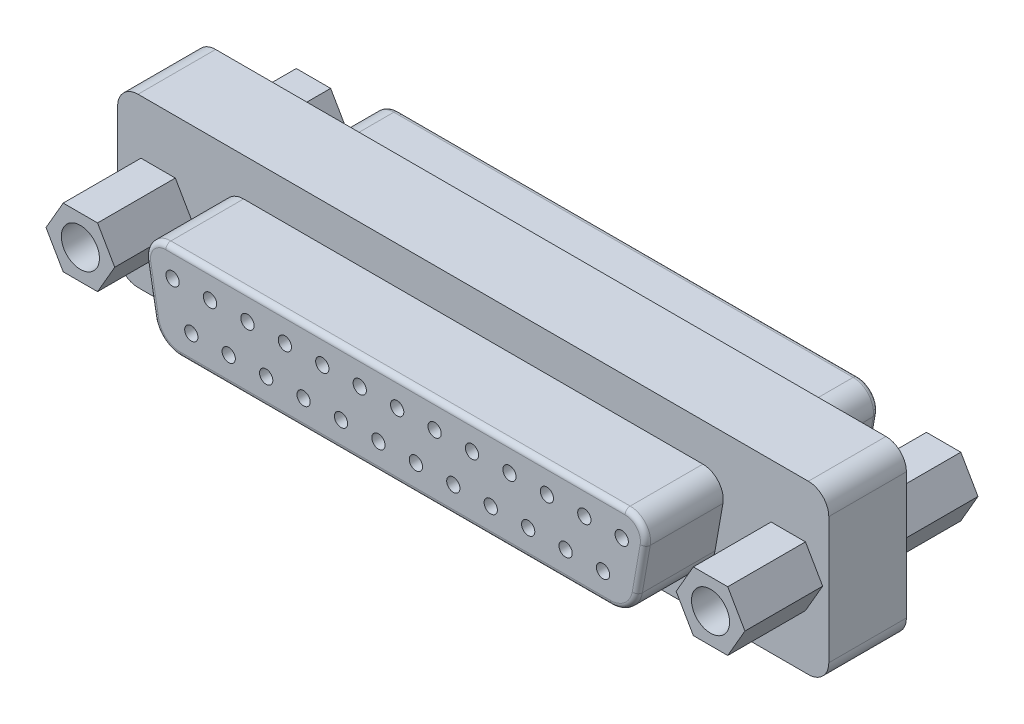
ISO-10303-21;
HEADER;
FILE_DESCRIPTION(('STEP AP214'),'2;1');
FILE_NAME('part.step','',(''),(''),'','','');
FILE_SCHEMA(('AUTOMOTIVE_DESIGN { 1 0 10303 214 1 1 1 1 }'));
ENDSEC;
DATA;
#1=APPLICATION_CONTEXT('core data for automotive mechanical design processes');
#2=APPLICATION_PROTOCOL_DEFINITION('international standard','automotive_design',2000,#1);
#3=PRODUCT_CONTEXT('',#1,'mechanical');
#4=PRODUCT('Part','Part','',(#3));
#5=PRODUCT_RELATED_PRODUCT_CATEGORY('part','',(#4));
#6=PRODUCT_DEFINITION_FORMATION('','',#4);
#7=PRODUCT_DEFINITION_CONTEXT('part definition',#1,'design');
#8=PRODUCT_DEFINITION('design','',#6,#7);
#9=PRODUCT_DEFINITION_SHAPE('','',#8);
#10=(LENGTH_UNIT() NAMED_UNIT(*) SI_UNIT(.MILLI.,.METRE.));
#11=(NAMED_UNIT(*) PLANE_ANGLE_UNIT() SI_UNIT($,.RADIAN.));
#12=(NAMED_UNIT(*) SI_UNIT($,.STERADIAN.) SOLID_ANGLE_UNIT());
#13=UNCERTAINTY_MEASURE_WITH_UNIT(LENGTH_MEASURE(1.E-05),#10,'distance_accuracy_value','');
#14=(GEOMETRIC_REPRESENTATION_CONTEXT(3) GLOBAL_UNCERTAINTY_ASSIGNED_CONTEXT((#13)) GLOBAL_UNIT_ASSIGNED_CONTEXT((#10,
#11,#12)) REPRESENTATION_CONTEXT('',''));
#15=CARTESIAN_POINT('',(0.,0.,0.));
#16=DIRECTION('',(0.,0.,1.));
#17=DIRECTION('',(1.,0.,0.));
#18=AXIS2_PLACEMENT_3D('',#15,#16,#17);
#19=CARTESIAN_POINT('',(25.019,4.7244,-2.8956));
#20=DIRECTION('',(0.,0.,-1.));
#21=DIRECTION('',(-1.,0.,0.));
#22=AXIS2_PLACEMENT_3D('',#19,#20,#21);
#23=PLANE('',#22);
#24=DIRECTION('',(0.173648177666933,0.984807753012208,0.));
#25=VECTOR('',#24,1.);
#26=CARTESIAN_POINT('',(19.3654155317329,5.72127947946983,-2.8956));
#27=LINE('',#26,#25);
#28=CARTESIAN_POINT('',(18.0502926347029,-1.7371530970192,-2.8956));
#29=VERTEX_POINT('',#28);
#30=CARTESIAN_POINT('',(18.6436,1.6276601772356,-2.8956));
#31=VERTEX_POINT('',#30);
#32=EDGE_CURVE('E482',#29,#31,#27,.T.);
#33=ORIENTED_EDGE('',*,*,#32,.T.);
#34=CARTESIAN_POINT('',(17.1427529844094,1.8923,-2.8956));
#35=DIRECTION('',(0.,0.,-1.));
#36=DIRECTION('',(-1.,0.,0.));
#37=AXIS2_PLACEMENT_3D('',#34,#35,#36);
#38=CIRCLE('',#37,1.524);
#39=CARTESIAN_POINT('',(17.1427529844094,3.4163,-2.8956));
#40=VERTEX_POINT('',#39);
#41=EDGE_CURVE('E519',#31,#40,#38,.F.);
#42=ORIENTED_EDGE('',*,*,#41,.T.);
#43=DIRECTION('',(-1.,0.,0.));
#44=VECTOR('',#43,1.);
#45=CARTESIAN_POINT('',(25.019,3.4163,-2.8956));
#46=LINE('',#45,#44);
#47=CARTESIAN_POINT('',(-17.1427529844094,3.4163,-2.8956));
#48=VERTEX_POINT('',#47);
#49=EDGE_CURVE('E516',#40,#48,#46,.T.);
#50=ORIENTED_EDGE('',*,*,#49,.T.);
#51=CARTESIAN_POINT('',(-17.1427529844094,1.8923,-2.8956));
#52=DIRECTION('',(0.,0.,-1.));
#53=DIRECTION('',(-1.,0.,0.));
#54=AXIS2_PLACEMENT_3D('',#51,#52,#53);
#55=CIRCLE('',#54,1.524);
#56=CARTESIAN_POINT('',(-18.6436,1.6276601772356,-2.8956));
#57=VERTEX_POINT('',#56);
#58=EDGE_CURVE('E511',#48,#57,#55,.F.);
#59=ORIENTED_EDGE('',*,*,#58,.T.);
#60=DIRECTION('',(0.173648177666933,-0.984807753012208,0.));
#61=VECTOR('',#60,1.);
#62=CARTESIAN_POINT('',(-17.8565852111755,-2.83572248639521,-2.8956));
#63=LINE('',#62,#61);
#64=CARTESIAN_POINT('',(-18.0502926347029,-1.73715309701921,-2.8956));
#65=VERTEX_POINT('',#64);
#66=EDGE_CURVE('E506',#57,#65,#63,.T.);
#67=ORIENTED_EDGE('',*,*,#66,.T.);
#68=CARTESIAN_POINT('',(-16.0491632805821,-1.3843,-2.8956));
#69=DIRECTION('',(0.,0.,-1.));
#70=DIRECTION('',(-1.,0.,0.));
#71=AXIS2_PLACEMENT_3D('',#68,#69,#70);
#72=CIRCLE('',#71,2.032);
#73=CARTESIAN_POINT('',(-16.0491632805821,-3.4163,-2.8956));
#74=VERTEX_POINT('',#73);
#75=EDGE_CURVE('E501',#65,#74,#72,.F.);
#76=ORIENTED_EDGE('',*,*,#75,.T.);
#77=DIRECTION('',(1.,0.,0.));
#78=VECTOR('',#77,1.);
#79=CARTESIAN_POINT('',(25.019,-3.4163,-2.8956));
#80=LINE('',#79,#78);
#81=CARTESIAN_POINT('',(16.0491632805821,-3.4163,-2.8956));
#82=VERTEX_POINT('',#81);
#83=EDGE_CURVE('E496',#74,#82,#80,.T.);
#84=ORIENTED_EDGE('',*,*,#83,.T.);
#85=CARTESIAN_POINT('',(16.0491632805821,-1.3843,-2.8956));
#86=DIRECTION('',(0.,0.,-1.));
#87=DIRECTION('',(-1.,0.,0.));
#88=AXIS2_PLACEMENT_3D('',#85,#86,#87);
#89=CIRCLE('',#88,2.032);
#90=EDGE_CURVE('E491',#82,#29,#89,.F.);
#91=ORIENTED_EDGE('',*,*,#90,.T.);
#92=EDGE_LOOP('',(#33,#42,#50,#59,#67,#76,#84,#91));
#93=FACE_BOUND('',#92,.T.);
#94=CARTESIAN_POINT('',(25.019,4.7244,-2.8956));
#95=DIRECTION('',(0.,0.,1.));
#96=DIRECTION('',(-1.,0.,0.));
#97=AXIS2_PLACEMENT_3D('',#94,#95,#96);
#98=CIRCLE('',#97,1.524);
#99=CARTESIAN_POINT('',(26.543,4.7244,-2.8956));
#100=VERTEX_POINT('',#99);
#101=CARTESIAN_POINT('',(25.019,6.2484,-2.8956));
#102=VERTEX_POINT('',#101);
#103=EDGE_CURVE('E718',#100,#102,#98,.T.);
#104=ORIENTED_EDGE('',*,*,#103,.F.);
#105=DIRECTION('',(0.,1.,0.));
#106=VECTOR('',#105,1.);
#107=CARTESIAN_POINT('',(26.543,4.7244,-2.8956));
#108=LINE('',#107,#106);
#109=CARTESIAN_POINT('',(26.543,-4.7244,-2.8956));
#110=VERTEX_POINT('',#109);
#111=EDGE_CURVE('E723',#110,#100,#108,.T.);
#112=ORIENTED_EDGE('',*,*,#111,.F.);
#113=CARTESIAN_POINT('',(25.019,-4.7244,-2.8956));
#114=DIRECTION('',(0.,0.,1.));
#115=DIRECTION('',(1.,0.,0.));
#116=AXIS2_PLACEMENT_3D('',#113,#114,#115);
#117=CIRCLE('',#116,1.524);
#118=CARTESIAN_POINT('',(25.019,-6.2484,-2.8956));
#119=VERTEX_POINT('',#118);
#120=EDGE_CURVE('E750',#119,#110,#117,.T.);
#121=ORIENTED_EDGE('',*,*,#120,.F.);
#122=DIRECTION('',(1.,0.,0.));
#123=VECTOR('',#122,1.);
#124=CARTESIAN_POINT('',(-25.019,-6.2484,-2.8956));
#125=LINE('',#124,#123);
#126=CARTESIAN_POINT('',(-25.019,-6.2484,-2.8956));
#127=VERTEX_POINT('',#126);
#128=EDGE_CURVE('E748',#127,#119,#125,.T.);
#129=ORIENTED_EDGE('',*,*,#128,.F.);
#130=CARTESIAN_POINT('',(-25.019,-4.7244,-2.8956));
#131=DIRECTION('',(0.,0.,1.));
#132=DIRECTION('',(1.,0.,0.));
#133=AXIS2_PLACEMENT_3D('',#130,#131,#132);
#134=CIRCLE('',#133,1.524);
#135=CARTESIAN_POINT('',(-26.543,-4.7244,-2.8956));
#136=VERTEX_POINT('',#135);
#137=EDGE_CURVE('E746',#136,#127,#134,.T.);
#138=ORIENTED_EDGE('',*,*,#137,.F.);
#139=DIRECTION('',(0.,-1.,0.));
#140=VECTOR('',#139,1.);
#141=CARTESIAN_POINT('',(-26.543,4.7244,-2.8956));
#142=LINE('',#141,#140);
#143=CARTESIAN_POINT('',(-26.543,4.7244,-2.8956));
#144=VERTEX_POINT('',#143);
#145=EDGE_CURVE('E744',#144,#136,#142,.T.);
#146=ORIENTED_EDGE('',*,*,#145,.F.);
#147=CARTESIAN_POINT('',(-25.019,4.7244,-2.8956));
#148=DIRECTION('',(0.,0.,1.));
#149=DIRECTION('',(1.,0.,0.));
#150=AXIS2_PLACEMENT_3D('',#147,#148,#149);
#151=CIRCLE('',#150,1.524);
#152=CARTESIAN_POINT('',(-25.019,6.2484,-2.8956));
#153=VERTEX_POINT('',#152);
#154=EDGE_CURVE('E742',#153,#144,#151,.T.);
#155=ORIENTED_EDGE('',*,*,#154,.F.);
#156=DIRECTION('',(-1.,0.,0.));
#157=VECTOR('',#156,1.);
#158=CARTESIAN_POINT('',(-25.019,6.2484,-2.8956));
#159=LINE('',#158,#157);
#160=EDGE_CURVE('E740',#102,#153,#159,.T.);
#161=ORIENTED_EDGE('',*,*,#160,.F.);
#162=EDGE_LOOP('',(#104,#112,#121,#129,#138,#146,#155,#161));
#163=FACE_BOUND('',#162,.T.);
#164=DIRECTION('',(-0.5,0.866025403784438,0.));
#165=VECTOR('',#164,1.);
#166=CARTESIAN_POINT('',(24.8035609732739,2.2225,-2.8956));
#167=LINE('',#166,#165);
#168=CARTESIAN_POINT('',(26.0867219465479,0.,-2.8956));
#169=VERTEX_POINT('',#168);
#170=CARTESIAN_POINT('',(24.8035609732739,2.2225,-2.8956));
#171=VERTEX_POINT('',#170);
#172=EDGE_CURVE('E522',#169,#171,#167,.T.);
#173=ORIENTED_EDGE('',*,*,#172,.T.);
#174=DIRECTION('',(-1.,0.,0.));
#175=VECTOR('',#174,1.);
#176=CARTESIAN_POINT('',(22.2372390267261,2.2225,-2.8956));
#177=LINE('',#176,#175);
#178=CARTESIAN_POINT('',(22.2372390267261,2.2225,-2.8956));
#179=VERTEX_POINT('',#178);
#180=EDGE_CURVE('E567',#171,#179,#177,.T.);
#181=ORIENTED_EDGE('',*,*,#180,.T.);
#182=DIRECTION('',(-0.500000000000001,-0.866025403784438,0.));
#183=VECTOR('',#182,1.);
#184=CARTESIAN_POINT('',(20.9540780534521,0.,-2.8956));
#185=LINE('',#184,#183);
#186=CARTESIAN_POINT('',(20.9540780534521,0.,-2.8956));
#187=VERTEX_POINT('',#186);
#188=EDGE_CURVE('E564',#179,#187,#185,.T.);
#189=ORIENTED_EDGE('',*,*,#188,.T.);
#190=DIRECTION('',(0.5,-0.866025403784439,0.));
#191=VECTOR('',#190,1.);
#192=CARTESIAN_POINT('',(22.237239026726,-2.2225,-2.8956));
#193=LINE('',#192,#191);
#194=CARTESIAN_POINT('',(22.237239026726,-2.2225,-2.8956));
#195=VERTEX_POINT('',#194);
#196=EDGE_CURVE('E559',#187,#195,#193,.T.);
#197=ORIENTED_EDGE('',*,*,#196,.T.);
#198=DIRECTION('',(1.,0.,0.));
#199=VECTOR('',#198,1.);
#200=CARTESIAN_POINT('',(24.8035609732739,-2.2225,-2.8956));
#201=LINE('',#200,#199);
#202=CARTESIAN_POINT('',(24.8035609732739,-2.2225,-2.8956));
#203=VERTEX_POINT('',#202);
#204=EDGE_CURVE('E554',#195,#203,#201,.T.);
#205=ORIENTED_EDGE('',*,*,#204,.T.);
#206=DIRECTION('',(0.500000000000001,0.866025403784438,0.));
#207=VECTOR('',#206,1.);
#208=CARTESIAN_POINT('',(26.0867219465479,0.,-2.8956));
#209=LINE('',#208,#207);
#210=EDGE_CURVE('E549',#203,#169,#209,.T.);
#211=ORIENTED_EDGE('',*,*,#210,.T.);
#212=EDGE_LOOP('',(#173,#181,#189,#197,#205,#211));
#213=FACE_BOUND('',#212,.T.);
#214=DIRECTION('',(-1.,0.,0.));
#215=VECTOR('',#214,1.);
#216=CARTESIAN_POINT('',(-22.2372390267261,2.2225,-2.8956));
#217=LINE('',#216,#215);
#218=CARTESIAN_POINT('',(-22.2372390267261,2.2225,-2.8956));
#219=VERTEX_POINT('',#218);
#220=CARTESIAN_POINT('',(-24.8035609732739,2.2225,-2.8956));
#221=VERTEX_POINT('',#220);
#222=EDGE_CURVE('E434',#219,#221,#217,.T.);
#223=ORIENTED_EDGE('',*,*,#222,.T.);
#224=DIRECTION('',(-0.5,-0.866025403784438,0.));
#225=VECTOR('',#224,1.);
#226=CARTESIAN_POINT('',(-24.8035609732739,2.2225,-2.8956));
#227=LINE('',#226,#225);
#228=CARTESIAN_POINT('',(-26.0867219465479,0.,-2.8956));
#229=VERTEX_POINT('',#228);
#230=EDGE_CURVE('E479',#221,#229,#227,.T.);
#231=ORIENTED_EDGE('',*,*,#230,.T.);
#232=DIRECTION('',(0.500000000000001,-0.866025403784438,0.));
#233=VECTOR('',#232,1.);
#234=CARTESIAN_POINT('',(-26.0867219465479,0.,-2.8956));
#235=LINE('',#234,#233);
#236=CARTESIAN_POINT('',(-24.8035609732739,-2.2225,-2.8956));
#237=VERTEX_POINT('',#236);
#238=EDGE_CURVE('E476',#229,#237,#235,.T.);
#239=ORIENTED_EDGE('',*,*,#238,.T.);
#240=DIRECTION('',(1.,0.,0.));
#241=VECTOR('',#240,1.);
#242=CARTESIAN_POINT('',(-24.8035609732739,-2.2225,-2.8956));
#243=LINE('',#242,#241);
#244=CARTESIAN_POINT('',(-22.237239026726,-2.2225,-2.8956));
#245=VERTEX_POINT('',#244);
#246=EDGE_CURVE('E471',#237,#245,#243,.T.);
#247=ORIENTED_EDGE('',*,*,#246,.T.);
#248=DIRECTION('',(0.5,0.866025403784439,0.));
#249=VECTOR('',#248,1.);
#250=CARTESIAN_POINT('',(-22.237239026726,-2.2225,-2.8956));
#251=LINE('',#250,#249);
#252=CARTESIAN_POINT('',(-20.9540780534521,0.,-2.8956));
#253=VERTEX_POINT('',#252);
#254=EDGE_CURVE('E466',#245,#253,#251,.T.);
#255=ORIENTED_EDGE('',*,*,#254,.T.);
#256=DIRECTION('',(-0.500000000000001,0.866025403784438,0.));
#257=VECTOR('',#256,1.);
#258=CARTESIAN_POINT('',(-20.9540780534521,0.,-2.8956));
#259=LINE('',#258,#257);
#260=EDGE_CURVE('E461',#253,#219,#259,.T.);
#261=ORIENTED_EDGE('',*,*,#260,.T.);
#262=EDGE_LOOP('',(#223,#231,#239,#247,#255,#261));
#263=FACE_BOUND('',#262,.T.);
#264=ADVANCED_FACE('F31',(#93,#163,#213,#263),#23,.T.);
#265=CARTESIAN_POINT('',(25.019,4.7244,2.8956));
#266=DIRECTION('',(0.,0.,-1.));
#267=DIRECTION('',(-1.,0.,0.));
#268=AXIS2_PLACEMENT_3D('',#265,#266,#267);
#269=PLANE('',#268);
#270=DIRECTION('',(-0.5,-0.866025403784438,0.));
#271=VECTOR('',#270,1.);
#272=CARTESIAN_POINT('',(-24.8035609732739,2.2225,2.8956));
#273=LINE('',#272,#271);
#274=CARTESIAN_POINT('',(-24.8035609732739,2.2225,2.8956));
#275=VERTEX_POINT('',#274);
#276=CARTESIAN_POINT('',(-26.0867219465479,0.,2.8956));
#277=VERTEX_POINT('',#276);
#278=EDGE_CURVE('E670',#275,#277,#273,.T.);
#279=ORIENTED_EDGE('',*,*,#278,.F.);
#280=DIRECTION('',(-1.,0.,0.));
#281=VECTOR('',#280,1.);
#282=CARTESIAN_POINT('',(-22.2372390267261,2.2225,2.8956));
#283=LINE('',#282,#281);
#284=CARTESIAN_POINT('',(-22.2372390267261,2.2225,2.8956));
#285=VERTEX_POINT('',#284);
#286=EDGE_CURVE('E649',#285,#275,#283,.T.);
#287=ORIENTED_EDGE('',*,*,#286,.F.);
#288=DIRECTION('',(-0.500000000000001,0.866025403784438,0.));
#289=VECTOR('',#288,1.);
#290=CARTESIAN_POINT('',(-20.9540780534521,0.,2.8956));
#291=LINE('',#290,#289);
#292=CARTESIAN_POINT('',(-20.9540780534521,0.,2.8956));
#293=VERTEX_POINT('',#292);
#294=EDGE_CURVE('E654',#293,#285,#291,.T.);
#295=ORIENTED_EDGE('',*,*,#294,.F.);
#296=DIRECTION('',(0.5,0.866025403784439,0.));
#297=VECTOR('',#296,1.);
#298=CARTESIAN_POINT('',(-22.237239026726,-2.2225,2.8956));
#299=LINE('',#298,#297);
#300=CARTESIAN_POINT('',(-22.237239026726,-2.2225,2.8956));
#301=VERTEX_POINT('',#300);
#302=EDGE_CURVE('E658',#301,#293,#299,.T.);
#303=ORIENTED_EDGE('',*,*,#302,.F.);
#304=DIRECTION('',(1.,0.,0.));
#305=VECTOR('',#304,1.);
#306=CARTESIAN_POINT('',(-24.8035609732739,-2.2225,2.8956));
#307=LINE('',#306,#305);
#308=CARTESIAN_POINT('',(-24.8035609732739,-2.2225,2.8956));
#309=VERTEX_POINT('',#308);
#310=EDGE_CURVE('E662',#309,#301,#307,.T.);
#311=ORIENTED_EDGE('',*,*,#310,.F.);
#312=DIRECTION('',(0.500000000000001,-0.866025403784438,0.));
#313=VECTOR('',#312,1.);
#314=CARTESIAN_POINT('',(-26.0867219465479,0.,2.8956));
#315=LINE('',#314,#313);
#316=EDGE_CURVE('E666',#277,#309,#315,.T.);
#317=ORIENTED_EDGE('',*,*,#316,.F.);
#318=EDGE_LOOP('',(#279,#287,#295,#303,#311,#317));
#319=FACE_BOUND('',#318,.T.);
#320=CARTESIAN_POINT('',(25.019,4.7244,2.8956));
#321=DIRECTION('',(0.,0.,1.));
#322=DIRECTION('',(-1.,0.,0.));
#323=AXIS2_PLACEMENT_3D('',#320,#321,#322);
#324=CIRCLE('',#323,1.524);
#325=CARTESIAN_POINT('',(26.543,4.7244,2.8956));
#326=VERTEX_POINT('',#325);
#327=CARTESIAN_POINT('',(25.019,6.2484,2.8956));
#328=VERTEX_POINT('',#327);
#329=EDGE_CURVE('E719',#326,#328,#324,.T.);
#330=ORIENTED_EDGE('',*,*,#329,.T.);
#331=DIRECTION('',(-1.,0.,0.));
#332=VECTOR('',#331,1.);
#333=CARTESIAN_POINT('',(-25.019,6.2484,2.8956));
#334=LINE('',#333,#332);
#335=CARTESIAN_POINT('',(-25.019,6.2484,2.8956));
#336=VERTEX_POINT('',#335);
#337=EDGE_CURVE('E722',#328,#336,#334,.T.);
#338=ORIENTED_EDGE('',*,*,#337,.T.);
#339=CARTESIAN_POINT('',(-25.019,4.7244,2.8956));
#340=DIRECTION('',(0.,0.,1.));
#341=DIRECTION('',(1.,0.,0.));
#342=AXIS2_PLACEMENT_3D('',#339,#340,#341);
#343=CIRCLE('',#342,1.524);
#344=CARTESIAN_POINT('',(-26.543,4.7244,2.8956));
#345=VERTEX_POINT('',#344);
#346=EDGE_CURVE('E725',#336,#345,#343,.T.);
#347=ORIENTED_EDGE('',*,*,#346,.T.);
#348=DIRECTION('',(0.,-1.,0.));
#349=VECTOR('',#348,1.);
#350=CARTESIAN_POINT('',(-26.543,4.7244,2.8956));
#351=LINE('',#350,#349);
#352=CARTESIAN_POINT('',(-26.543,-4.7244,2.8956));
#353=VERTEX_POINT('',#352);
#354=EDGE_CURVE('E727',#345,#353,#351,.T.);
#355=ORIENTED_EDGE('',*,*,#354,.T.);
#356=CARTESIAN_POINT('',(-25.019,-4.7244,2.8956));
#357=DIRECTION('',(0.,0.,1.));
#358=DIRECTION('',(1.,0.,0.));
#359=AXIS2_PLACEMENT_3D('',#356,#357,#358);
#360=CIRCLE('',#359,1.524);
#361=CARTESIAN_POINT('',(-25.019,-6.2484,2.8956));
#362=VERTEX_POINT('',#361);
#363=EDGE_CURVE('E729',#353,#362,#360,.T.);
#364=ORIENTED_EDGE('',*,*,#363,.T.);
#365=DIRECTION('',(1.,0.,0.));
#366=VECTOR('',#365,1.);
#367=CARTESIAN_POINT('',(-25.019,-6.2484,2.8956));
#368=LINE('',#367,#366);
#369=CARTESIAN_POINT('',(25.019,-6.2484,2.8956));
#370=VERTEX_POINT('',#369);
#371=EDGE_CURVE('E731',#362,#370,#368,.T.);
#372=ORIENTED_EDGE('',*,*,#371,.T.);
#373=CARTESIAN_POINT('',(25.019,-4.7244,2.8956));
#374=DIRECTION('',(0.,0.,1.));
#375=DIRECTION('',(1.,0.,0.));
#376=AXIS2_PLACEMENT_3D('',#373,#374,#375);
#377=CIRCLE('',#376,1.524);
#378=CARTESIAN_POINT('',(26.543,-4.7244,2.8956));
#379=VERTEX_POINT('',#378);
#380=EDGE_CURVE('E733',#370,#379,#377,.T.);
#381=ORIENTED_EDGE('',*,*,#380,.T.);
#382=DIRECTION('',(0.,1.,0.));
#383=VECTOR('',#382,1.);
#384=CARTESIAN_POINT('',(26.543,4.7244,2.8956));
#385=LINE('',#384,#383);
#386=EDGE_CURVE('E735',#379,#326,#385,.T.);
#387=ORIENTED_EDGE('',*,*,#386,.T.);
#388=EDGE_LOOP('',(#330,#338,#347,#355,#364,#372,#381,#387));
#389=FACE_BOUND('',#388,.T.);
#390=CARTESIAN_POINT('',(17.1427529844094,1.8923,2.8956));
#391=DIRECTION('',(0.,0.,-1.));
#392=DIRECTION('',(-1.,0.,0.));
#393=AXIS2_PLACEMENT_3D('',#390,#391,#392);
#394=CIRCLE('',#393,1.524);
#395=CARTESIAN_POINT('',(18.6436,1.6276601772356,2.8956));
#396=VERTEX_POINT('',#395);
#397=CARTESIAN_POINT('',(17.1427529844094,3.4163,2.8956));
#398=VERTEX_POINT('',#397);
#399=EDGE_CURVE('E797',#396,#398,#394,.F.);
#400=ORIENTED_EDGE('',*,*,#399,.F.);
#401=DIRECTION('',(0.173648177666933,0.984807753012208,0.));
#402=VECTOR('',#401,1.);
#403=CARTESIAN_POINT('',(19.3654155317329,5.72127947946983,2.8956));
#404=LINE('',#403,#402);
#405=CARTESIAN_POINT('',(18.0502926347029,-1.7371530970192,2.8956));
#406=VERTEX_POINT('',#405);
#407=EDGE_CURVE('E776',#406,#396,#404,.T.);
#408=ORIENTED_EDGE('',*,*,#407,.F.);
#409=CARTESIAN_POINT('',(16.0491632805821,-1.3843,2.8956));
#410=DIRECTION('',(0.,0.,-1.));
#411=DIRECTION('',(-1.,0.,0.));
#412=AXIS2_PLACEMENT_3D('',#409,#410,#411);
#413=CIRCLE('',#412,2.032);
#414=CARTESIAN_POINT('',(16.0491632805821,-3.4163,2.8956));
#415=VERTEX_POINT('',#414);
#416=EDGE_CURVE('E779',#415,#406,#413,.F.);
#417=ORIENTED_EDGE('',*,*,#416,.F.);
#418=DIRECTION('',(1.,0.,0.));
#419=VECTOR('',#418,1.);
#420=CARTESIAN_POINT('',(25.019,-3.4163,2.8956));
#421=LINE('',#420,#419);
#422=CARTESIAN_POINT('',(-16.0491632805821,-3.4163,2.8956));
#423=VERTEX_POINT('',#422);
#424=EDGE_CURVE('E782',#423,#415,#421,.T.);
#425=ORIENTED_EDGE('',*,*,#424,.F.);
#426=CARTESIAN_POINT('',(-16.0491632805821,-1.3843,2.8956));
#427=DIRECTION('',(0.,0.,-1.));
#428=DIRECTION('',(-1.,0.,0.));
#429=AXIS2_PLACEMENT_3D('',#426,#427,#428);
#430=CIRCLE('',#429,2.032);
#431=CARTESIAN_POINT('',(-18.0502926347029,-1.73715309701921,2.8956));
#432=VERTEX_POINT('',#431);
#433=EDGE_CURVE('E785',#432,#423,#430,.F.);
#434=ORIENTED_EDGE('',*,*,#433,.F.);
#435=DIRECTION('',(0.173648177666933,-0.984807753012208,0.));
#436=VECTOR('',#435,1.);
#437=CARTESIAN_POINT('',(-17.8565852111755,-2.83572248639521,2.8956));
#438=LINE('',#437,#436);
#439=CARTESIAN_POINT('',(-18.6436,1.6276601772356,2.8956));
#440=VERTEX_POINT('',#439);
#441=EDGE_CURVE('E788',#440,#432,#438,.T.);
#442=ORIENTED_EDGE('',*,*,#441,.F.);
#443=CARTESIAN_POINT('',(-17.1427529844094,1.8923,2.8956));
#444=DIRECTION('',(0.,0.,-1.));
#445=DIRECTION('',(-1.,0.,0.));
#446=AXIS2_PLACEMENT_3D('',#443,#444,#445);
#447=CIRCLE('',#446,1.524);
#448=CARTESIAN_POINT('',(-17.1427529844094,3.4163,2.8956));
#449=VERTEX_POINT('',#448);
#450=EDGE_CURVE('E791',#449,#440,#447,.F.);
#451=ORIENTED_EDGE('',*,*,#450,.F.);
#452=DIRECTION('',(-1.,0.,0.));
#453=VECTOR('',#452,1.);
#454=CARTESIAN_POINT('',(25.019,3.4163,2.8956));
#455=LINE('',#454,#453);
#456=EDGE_CURVE('E794',#398,#449,#455,.T.);
#457=ORIENTED_EDGE('',*,*,#456,.F.);
#458=EDGE_LOOP('',(#400,#408,#417,#425,#434,#442,#451,#457));
#459=FACE_BOUND('',#458,.T.);
#460=DIRECTION('',(-1.,0.,0.));
#461=VECTOR('',#460,1.);
#462=CARTESIAN_POINT('',(22.2372390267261,2.2225,2.8956));
#463=LINE('',#462,#461);
#464=CARTESIAN_POINT('',(24.8035609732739,2.2225,2.8956));
#465=VERTEX_POINT('',#464);
#466=CARTESIAN_POINT('',(22.2372390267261,2.2225,2.8956));
#467=VERTEX_POINT('',#466);
#468=EDGE_CURVE('E616',#465,#467,#463,.T.);
#469=ORIENTED_EDGE('',*,*,#468,.F.);
#470=DIRECTION('',(-0.5,0.866025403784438,0.));
#471=VECTOR('',#470,1.);
#472=CARTESIAN_POINT('',(24.8035609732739,2.2225,2.8956));
#473=LINE('',#472,#471);
#474=CARTESIAN_POINT('',(26.0867219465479,0.,2.8956));
#475=VERTEX_POINT('',#474);
#476=EDGE_CURVE('E595',#475,#465,#473,.T.);
#477=ORIENTED_EDGE('',*,*,#476,.F.);
#478=DIRECTION('',(0.500000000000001,0.866025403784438,0.));
#479=VECTOR('',#478,1.);
#480=CARTESIAN_POINT('',(26.0867219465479,0.,2.8956));
#481=LINE('',#480,#479);
#482=CARTESIAN_POINT('',(24.8035609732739,-2.2225,2.8956));
#483=VERTEX_POINT('',#482);
#484=EDGE_CURVE('E600',#483,#475,#481,.T.);
#485=ORIENTED_EDGE('',*,*,#484,.F.);
#486=DIRECTION('',(1.,0.,0.));
#487=VECTOR('',#486,1.);
#488=CARTESIAN_POINT('',(24.8035609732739,-2.2225,2.8956));
#489=LINE('',#488,#487);
#490=CARTESIAN_POINT('',(22.237239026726,-2.2225,2.8956));
#491=VERTEX_POINT('',#490);
#492=EDGE_CURVE('E604',#491,#483,#489,.T.);
#493=ORIENTED_EDGE('',*,*,#492,.F.);
#494=DIRECTION('',(0.5,-0.866025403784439,0.));
#495=VECTOR('',#494,1.);
#496=CARTESIAN_POINT('',(22.237239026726,-2.2225,2.8956));
#497=LINE('',#496,#495);
#498=CARTESIAN_POINT('',(20.9540780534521,0.,2.8956));
#499=VERTEX_POINT('',#498);
#500=EDGE_CURVE('E608',#499,#491,#497,.T.);
#501=ORIENTED_EDGE('',*,*,#500,.F.);
#502=DIRECTION('',(-0.500000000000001,-0.866025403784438,0.));
#503=VECTOR('',#502,1.);
#504=CARTESIAN_POINT('',(20.9540780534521,0.,2.8956));
#505=LINE('',#504,#503);
#506=EDGE_CURVE('E612',#467,#499,#505,.T.);
#507=ORIENTED_EDGE('',*,*,#506,.F.);
#508=EDGE_LOOP('',(#469,#477,#485,#493,#501,#507));
#509=FACE_BOUND('',#508,.T.);
#510=ADVANCED_FACE('F925',(#319,#389,#459,#509),#269,.F.);
#511=CARTESIAN_POINT('',(25.019,4.7244,2.8956));
#512=DIRECTION('',(0.,0.,-1.));
#513=DIRECTION('',(-1.,0.,0.));
#514=AXIS2_PLACEMENT_3D('',#511,#512,#513);
#515=CYLINDRICAL_SURFACE('',#514,1.524);
#516=ORIENTED_EDGE('',*,*,#103,.T.);
#517=DIRECTION('',(0.,0.,-1.));
#518=VECTOR('',#517,1.);
#519=CARTESIAN_POINT('',(25.019,6.2484,2.8956));
#520=LINE('',#519,#518);
#521=EDGE_CURVE('E773',#328,#102,#520,.T.);
#522=ORIENTED_EDGE('',*,*,#521,.F.);
#523=ORIENTED_EDGE('',*,*,#329,.F.);
#524=DIRECTION('',(0.,0.,-1.));
#525=VECTOR('',#524,1.);
#526=CARTESIAN_POINT('',(26.543,4.7244,2.8956));
#527=LINE('',#526,#525);
#528=EDGE_CURVE('E737',#326,#100,#527,.T.);
#529=ORIENTED_EDGE('',*,*,#528,.T.);
#530=EDGE_LOOP('',(#516,#522,#523,#529));
#531=FACE_BOUND('',#530,.T.);
#532=ADVANCED_FACE('F977',(#531),#515,.T.);
#533=CARTESIAN_POINT('',(-25.019,6.2484,2.8956));
#534=DIRECTION('',(0.,-1.,0.));
#535=DIRECTION('',(0.,0.,-1.));
#536=AXIS2_PLACEMENT_3D('',#533,#534,#535);
#537=PLANE('',#536);
#538=ORIENTED_EDGE('',*,*,#160,.T.);
#539=DIRECTION('',(0.,0.,-1.));
#540=VECTOR('',#539,1.);
#541=CARTESIAN_POINT('',(-25.019,6.2484,2.8956));
#542=LINE('',#541,#540);
#543=EDGE_CURVE('E770',#336,#153,#542,.T.);
#544=ORIENTED_EDGE('',*,*,#543,.F.);
#545=ORIENTED_EDGE('',*,*,#337,.F.);
#546=ORIENTED_EDGE('',*,*,#521,.T.);
#547=EDGE_LOOP('',(#538,#544,#545,#546));
#548=FACE_BOUND('',#547,.T.);
#549=ADVANCED_FACE('F1006',(#548),#537,.F.);
#550=CARTESIAN_POINT('',(-25.019,4.7244,2.8956));
#551=DIRECTION('',(0.,0.,-1.));
#552=DIRECTION('',(-1.,0.,0.));
#553=AXIS2_PLACEMENT_3D('',#550,#551,#552);
#554=CYLINDRICAL_SURFACE('',#553,1.524);
#555=ORIENTED_EDGE('',*,*,#154,.T.);
#556=DIRECTION('',(0.,0.,-1.));
#557=VECTOR('',#556,1.);
#558=CARTESIAN_POINT('',(-26.543,4.7244,2.8956));
#559=LINE('',#558,#557);
#560=EDGE_CURVE('E767',#345,#144,#559,.T.);
#561=ORIENTED_EDGE('',*,*,#560,.F.);
#562=ORIENTED_EDGE('',*,*,#346,.F.);
#563=ORIENTED_EDGE('',*,*,#543,.T.);
#564=EDGE_LOOP('',(#555,#561,#562,#563));
#565=FACE_BOUND('',#564,.T.);
#566=ADVANCED_FACE('F1002',(#565),#554,.T.);
#567=CARTESIAN_POINT('',(-26.543,4.7244,2.8956));
#568=DIRECTION('',(1.,0.,0.));
#569=DIRECTION('',(0.,1.,0.));
#570=AXIS2_PLACEMENT_3D('',#567,#568,#569);
#571=PLANE('',#570);
#572=ORIENTED_EDGE('',*,*,#145,.T.);
#573=DIRECTION('',(0.,0.,-1.));
#574=VECTOR('',#573,1.);
#575=CARTESIAN_POINT('',(-26.543,-4.7244,2.8956));
#576=LINE('',#575,#574);
#577=EDGE_CURVE('E764',#353,#136,#576,.T.);
#578=ORIENTED_EDGE('',*,*,#577,.F.);
#579=ORIENTED_EDGE('',*,*,#354,.F.);
#580=ORIENTED_EDGE('',*,*,#560,.T.);
#581=EDGE_LOOP('',(#572,#578,#579,#580));
#582=FACE_BOUND('',#581,.T.);
#583=ADVANCED_FACE('F998',(#582),#571,.F.);
#584=CARTESIAN_POINT('',(-25.019,-4.7244,2.8956));
#585=DIRECTION('',(0.,0.,-1.));
#586=DIRECTION('',(-1.,0.,0.));
#587=AXIS2_PLACEMENT_3D('',#584,#585,#586);
#588=CYLINDRICAL_SURFACE('',#587,1.524);
#589=ORIENTED_EDGE('',*,*,#137,.T.);
#590=DIRECTION('',(0.,0.,-1.));
#591=VECTOR('',#590,1.);
#592=CARTESIAN_POINT('',(-25.019,-6.2484,2.8956));
#593=LINE('',#592,#591);
#594=EDGE_CURVE('E761',#362,#127,#593,.T.);
#595=ORIENTED_EDGE('',*,*,#594,.F.);
#596=ORIENTED_EDGE('',*,*,#363,.F.);
#597=ORIENTED_EDGE('',*,*,#577,.T.);
#598=EDGE_LOOP('',(#589,#595,#596,#597));
#599=FACE_BOUND('',#598,.T.);
#600=ADVANCED_FACE('F994',(#599),#588,.T.);
#601=CARTESIAN_POINT('',(-25.019,-6.2484,2.8956));
#602=DIRECTION('',(0.,1.,0.));
#603=DIRECTION('',(0.,0.,1.));
#604=AXIS2_PLACEMENT_3D('',#601,#602,#603);
#605=PLANE('',#604);
#606=ORIENTED_EDGE('',*,*,#128,.T.);
#607=DIRECTION('',(0.,0.,-1.));
#608=VECTOR('',#607,1.);
#609=CARTESIAN_POINT('',(25.019,-6.2484,2.8956));
#610=LINE('',#609,#608);
#611=EDGE_CURVE('E758',#370,#119,#610,.T.);
#612=ORIENTED_EDGE('',*,*,#611,.F.);
#613=ORIENTED_EDGE('',*,*,#371,.F.);
#614=ORIENTED_EDGE('',*,*,#594,.T.);
#615=EDGE_LOOP('',(#606,#612,#613,#614));
#616=FACE_BOUND('',#615,.T.);
#617=ADVANCED_FACE('F990',(#616),#605,.F.);
#618=CARTESIAN_POINT('',(25.019,-4.7244,2.8956));
#619=DIRECTION('',(0.,0.,-1.));
#620=DIRECTION('',(-1.,0.,0.));
#621=AXIS2_PLACEMENT_3D('',#618,#619,#620);
#622=CYLINDRICAL_SURFACE('',#621,1.524);
#623=ORIENTED_EDGE('',*,*,#120,.T.);
#624=DIRECTION('',(0.,0.,-1.));
#625=VECTOR('',#624,1.);
#626=CARTESIAN_POINT('',(26.543,-4.7244,2.8956));
#627=LINE('',#626,#625);
#628=EDGE_CURVE('E755',#379,#110,#627,.T.);
#629=ORIENTED_EDGE('',*,*,#628,.F.);
#630=ORIENTED_EDGE('',*,*,#380,.F.);
#631=ORIENTED_EDGE('',*,*,#611,.T.);
#632=EDGE_LOOP('',(#623,#629,#630,#631));
#633=FACE_BOUND('',#632,.T.);
#634=ADVANCED_FACE('F986',(#633),#622,.T.);
#635=CARTESIAN_POINT('',(26.543,4.7244,2.8956));
#636=DIRECTION('',(-1.,0.,0.));
#637=DIRECTION('',(0.,0.,1.));
#638=AXIS2_PLACEMENT_3D('',#635,#636,#637);
#639=PLANE('',#638);
#640=ORIENTED_EDGE('',*,*,#111,.T.);
#641=ORIENTED_EDGE('',*,*,#528,.F.);
#642=ORIENTED_EDGE('',*,*,#386,.F.);
#643=ORIENTED_EDGE('',*,*,#628,.T.);
#644=EDGE_LOOP('',(#640,#641,#642,#643));
#645=FACE_BOUND('',#644,.T.);
#646=ADVANCED_FACE('F983',(#645),#639,.F.);
#647=CARTESIAN_POINT('',(17.1427529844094,1.8923,8.6995));
#648=DIRECTION('',(0.,0.,-1.));
#649=DIRECTION('',(-1.,0.,0.));
#650=AXIS2_PLACEMENT_3D('',#647,#648,#649);
#651=CYLINDRICAL_SURFACE('',#650,1.524);
#652=DIRECTION('',(0.,0.,-1.));
#653=VECTOR('',#652,1.);
#654=CARTESIAN_POINT('',(17.1427529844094,3.4163,8.6995));
#655=LINE('',#654,#653);
#656=CARTESIAN_POINT('',(17.1427529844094,3.4163,8.3185));
#657=VERTEX_POINT('',#656);
#658=EDGE_CURVE('E716',#657,#398,#655,.T.);
#659=ORIENTED_EDGE('',*,*,#658,.F.);
#660=CARTESIAN_POINT('',(17.1427529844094,1.8923,8.3185));
#661=DIRECTION('',(0.,0.,1.));
#662=DIRECTION('',(1.,0.,0.));
#663=AXIS2_PLACEMENT_3D('',#660,#661,#662);
#664=CIRCLE('',#663,1.524);
#665=CARTESIAN_POINT('',(18.6436,1.6276601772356,8.3185));
#666=VERTEX_POINT('',#665);
#667=EDGE_CURVE('E849',#657,#666,#664,.F.);
#668=ORIENTED_EDGE('',*,*,#667,.T.);
#669=DIRECTION('',(0.,0.,-1.));
#670=VECTOR('',#669,1.);
#671=CARTESIAN_POINT('',(18.6436,1.6276601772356,8.6995));
#672=LINE('',#671,#670);
#673=EDGE_CURVE('E676',#666,#396,#672,.T.);
#674=ORIENTED_EDGE('',*,*,#673,.T.);
#675=ORIENTED_EDGE('',*,*,#399,.T.);
#676=EDGE_LOOP('',(#659,#668,#674,#675));
#677=FACE_BOUND('',#676,.T.);
#678=ADVANCED_FACE('F951',(#677),#651,.T.);
#679=CARTESIAN_POINT('',(-17.1427529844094,3.4163,8.6995));
#680=DIRECTION('',(0.,-1.,0.));
#681=DIRECTION('',(0.,0.,-1.));
#682=AXIS2_PLACEMENT_3D('',#679,#680,#681);
#683=PLANE('',#682);
#684=DIRECTION('',(0.,0.,-1.));
#685=VECTOR('',#684,1.);
#686=CARTESIAN_POINT('',(-17.1427529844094,3.4163,8.6995));
#687=LINE('',#686,#685);
#688=CARTESIAN_POINT('',(-17.1427529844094,3.4163,8.3185));
#689=VERTEX_POINT('',#688);
#690=EDGE_CURVE('E714',#689,#449,#687,.T.);
#691=ORIENTED_EDGE('',*,*,#690,.F.);
#692=DIRECTION('',(-1.,0.,0.));
#693=VECTOR('',#692,1.);
#694=CARTESIAN_POINT('',(17.1427529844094,3.4163,8.3185));
#695=LINE('',#694,#693);
#696=EDGE_CURVE('E11',#689,#657,#695,.F.);
#697=ORIENTED_EDGE('',*,*,#696,.T.);
#698=ORIENTED_EDGE('',*,*,#658,.T.);
#699=ORIENTED_EDGE('',*,*,#456,.T.);
#700=EDGE_LOOP('',(#691,#697,#698,#699));
#701=FACE_BOUND('',#700,.T.);
#702=ADVANCED_FACE('F933',(#701),#683,.F.);
#703=CARTESIAN_POINT('',(-17.1427529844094,1.8923,8.6995));
#704=DIRECTION('',(0.,0.,-1.));
#705=DIRECTION('',(-1.,0.,0.));
#706=AXIS2_PLACEMENT_3D('',#703,#704,#705);
#707=CYLINDRICAL_SURFACE('',#706,1.524);
#708=DIRECTION('',(0.,0.,-1.));
#709=VECTOR('',#708,1.);
#710=CARTESIAN_POINT('',(-18.6436,1.6276601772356,8.6995));
#711=LINE('',#710,#709);
#712=CARTESIAN_POINT('',(-18.6436,1.6276601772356,8.3185));
#713=VERTEX_POINT('',#712);
#714=EDGE_CURVE('E712',#713,#440,#711,.T.);
#715=ORIENTED_EDGE('',*,*,#714,.F.);
#716=CARTESIAN_POINT('',(-17.1427529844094,1.8923,8.3185));
#717=DIRECTION('',(0.,0.,1.));
#718=DIRECTION('',(1.,0.,0.));
#719=AXIS2_PLACEMENT_3D('',#716,#717,#718);
#720=CIRCLE('',#719,1.524);
#721=EDGE_CURVE('E48',#713,#689,#720,.F.);
#722=ORIENTED_EDGE('',*,*,#721,.T.);
#723=ORIENTED_EDGE('',*,*,#690,.T.);
#724=ORIENTED_EDGE('',*,*,#450,.T.);
#725=EDGE_LOOP('',(#715,#722,#723,#724));
#726=FACE_BOUND('',#725,.T.);
#727=ADVANCED_FACE('F929',(#726),#707,.T.);
#728=CARTESIAN_POINT('',(-18.6436,1.6276601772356,8.6995));
#729=DIRECTION('',(0.984807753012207,0.173648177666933,0.));
#730=DIRECTION('',(-0.173648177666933,0.984807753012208,0.));
#731=AXIS2_PLACEMENT_3D('',#728,#729,#730);
#732=PLANE('',#731);
#733=DIRECTION('',(0.,0.,-1.));
#734=VECTOR('',#733,1.);
#735=CARTESIAN_POINT('',(-18.0502926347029,-1.73715309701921,8.6995));
#736=LINE('',#735,#734);
#737=CARTESIAN_POINT('',(-18.0502926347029,-1.73715309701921,8.3185));
#738=VERTEX_POINT('',#737);
#739=EDGE_CURVE('E710',#738,#432,#736,.T.);
#740=ORIENTED_EDGE('',*,*,#739,.F.);
#741=DIRECTION('',(0.173648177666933,-0.984807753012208,0.));
#742=VECTOR('',#741,1.);
#743=CARTESIAN_POINT('',(-18.6436,1.6276601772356,8.3185));
#744=LINE('',#743,#742);
#745=EDGE_CURVE('E56',#738,#713,#744,.F.);
#746=ORIENTED_EDGE('',*,*,#745,.T.);
#747=ORIENTED_EDGE('',*,*,#714,.T.);
#748=ORIENTED_EDGE('',*,*,#441,.T.);
#749=EDGE_LOOP('',(#740,#746,#747,#748));
#750=FACE_BOUND('',#749,.T.);
#751=ADVANCED_FACE('F920',(#750),#732,.F.);
#752=CARTESIAN_POINT('',(-16.0491632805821,-1.3843,8.6995));
#753=DIRECTION('',(0.,0.,-1.));
#754=DIRECTION('',(-1.,0.,0.));
#755=AXIS2_PLACEMENT_3D('',#752,#753,#754);
#756=CYLINDRICAL_SURFACE('',#755,2.032);
#757=DIRECTION('',(0.,0.,-1.));
#758=VECTOR('',#757,1.);
#759=CARTESIAN_POINT('',(-16.0491632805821,-3.4163,8.6995));
#760=LINE('',#759,#758);
#761=CARTESIAN_POINT('',(-16.0491632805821,-3.4163,8.3185));
#762=VERTEX_POINT('',#761);
#763=EDGE_CURVE('E708',#762,#423,#760,.T.);
#764=ORIENTED_EDGE('',*,*,#763,.F.);
#765=CARTESIAN_POINT('',(-16.0491632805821,-1.3843,8.3185));
#766=DIRECTION('',(0.,0.,1.));
#767=DIRECTION('',(1.,0.,0.));
#768=AXIS2_PLACEMENT_3D('',#765,#766,#767);
#769=CIRCLE('',#768,2.032);
#770=EDGE_CURVE('E858',#762,#738,#769,.F.);
#771=ORIENTED_EDGE('',*,*,#770,.T.);
#772=ORIENTED_EDGE('',*,*,#739,.T.);
#773=ORIENTED_EDGE('',*,*,#433,.T.);
#774=EDGE_LOOP('',(#764,#771,#772,#773));
#775=FACE_BOUND('',#774,.T.);
#776=ADVANCED_FACE('F918',(#775),#756,.T.);
#777=CARTESIAN_POINT('',(16.0491632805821,-3.4163,8.6995));
#778=DIRECTION('',(0.,1.,0.));
#779=DIRECTION('',(0.,0.,1.));
#780=AXIS2_PLACEMENT_3D('',#777,#778,#779);
#781=PLANE('',#780);
#782=DIRECTION('',(0.,0.,-1.));
#783=VECTOR('',#782,1.);
#784=CARTESIAN_POINT('',(16.0491632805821,-3.4163,8.6995));
#785=LINE('',#784,#783);
#786=CARTESIAN_POINT('',(16.0491632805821,-3.4163,8.3185));
#787=VERTEX_POINT('',#786);
#788=EDGE_CURVE('E706',#787,#415,#785,.T.);
#789=ORIENTED_EDGE('',*,*,#788,.F.);
#790=DIRECTION('',(1.,0.,0.));
#791=VECTOR('',#790,1.);
#792=CARTESIAN_POINT('',(-16.0491632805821,-3.4163,8.3185));
#793=LINE('',#792,#791);
#794=EDGE_CURVE('E856',#787,#762,#793,.F.);
#795=ORIENTED_EDGE('',*,*,#794,.T.);
#796=ORIENTED_EDGE('',*,*,#763,.T.);
#797=ORIENTED_EDGE('',*,*,#424,.T.);
#798=EDGE_LOOP('',(#789,#795,#796,#797));
#799=FACE_BOUND('',#798,.T.);
#800=ADVANCED_FACE('F962',(#799),#781,.F.);
#801=CARTESIAN_POINT('',(16.0491632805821,-1.3843,8.6995));
#802=DIRECTION('',(0.,0.,-1.));
#803=DIRECTION('',(-1.,0.,0.));
#804=AXIS2_PLACEMENT_3D('',#801,#802,#803);
#805=CYLINDRICAL_SURFACE('',#804,2.032);
#806=DIRECTION('',(0.,0.,-1.));
#807=VECTOR('',#806,1.);
#808=CARTESIAN_POINT('',(18.0502926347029,-1.73715309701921,8.6995));
#809=LINE('',#808,#807);
#810=CARTESIAN_POINT('',(18.0502926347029,-1.73715309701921,8.3185));
#811=VERTEX_POINT('',#810);
#812=EDGE_CURVE('E704',#811,#406,#809,.T.);
#813=ORIENTED_EDGE('',*,*,#812,.F.);
#814=CARTESIAN_POINT('',(16.0491632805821,-1.3843,8.3185));
#815=DIRECTION('',(0.,0.,1.));
#816=DIRECTION('',(1.,0.,0.));
#817=AXIS2_PLACEMENT_3D('',#814,#815,#816);
#818=CIRCLE('',#817,2.032);
#819=EDGE_CURVE('E854',#811,#787,#818,.F.);
#820=ORIENTED_EDGE('',*,*,#819,.T.);
#821=ORIENTED_EDGE('',*,*,#788,.T.);
#822=ORIENTED_EDGE('',*,*,#416,.T.);
#823=EDGE_LOOP('',(#813,#820,#821,#822));
#824=FACE_BOUND('',#823,.T.);
#825=ADVANCED_FACE('F958',(#824),#805,.T.);
#826=CARTESIAN_POINT('',(18.6436,1.6276601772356,8.6995));
#827=DIRECTION('',(-0.984807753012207,0.173648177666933,0.));
#828=DIRECTION('',(-0.173648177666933,-0.984807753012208,0.));
#829=AXIS2_PLACEMENT_3D('',#826,#827,#828);
#830=PLANE('',#829);
#831=ORIENTED_EDGE('',*,*,#673,.F.);
#832=DIRECTION('',(0.173648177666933,0.984807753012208,0.));
#833=VECTOR('',#832,1.);
#834=CARTESIAN_POINT('',(18.0502926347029,-1.73715309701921,8.3185));
#835=LINE('',#834,#833);
#836=EDGE_CURVE('E852',#666,#811,#835,.F.);
#837=ORIENTED_EDGE('',*,*,#836,.T.);
#838=ORIENTED_EDGE('',*,*,#812,.T.);
#839=ORIENTED_EDGE('',*,*,#407,.T.);
#840=EDGE_LOOP('',(#831,#837,#838,#839));
#841=FACE_BOUND('',#840,.T.);
#842=ADVANCED_FACE('F953',(#841),#830,.F.);
#843=CARTESIAN_POINT('',(17.1427529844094,1.8923,8.6995));
#844=DIRECTION('',(0.,0.,1.));
#845=DIRECTION('',(1.,0.,0.));
#846=AXIS2_PLACEMENT_3D('',#843,#844,#845);
#847=PLANE('',#846);
#848=DIRECTION('',(0.173648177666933,0.984807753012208,0.));
#849=VECTOR('',#848,1.);
#850=CARTESIAN_POINT('',(18.2683882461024,1.6938201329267,8.6995));
#851=LINE('',#850,#849);
#852=CARTESIAN_POINT('',(17.6750808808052,-1.6709931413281,8.6995));
#853=VERTEX_POINT('',#852);
#854=CARTESIAN_POINT('',(18.2683882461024,1.6938201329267,8.6995));
#855=VERTEX_POINT('',#854);
#856=EDGE_CURVE('E844',#853,#855,#851,.T.);
#857=ORIENTED_EDGE('',*,*,#856,.T.);
#858=CARTESIAN_POINT('',(17.1427529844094,1.8923,8.6995));
#859=DIRECTION('',(0.,0.,1.));
#860=DIRECTION('',(1.,0.,0.));
#861=AXIS2_PLACEMENT_3D('',#858,#859,#860);
#862=CIRCLE('',#861,1.143);
#863=CARTESIAN_POINT('',(17.1427529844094,3.0353,8.6995));
#864=VERTEX_POINT('',#863);
#865=EDGE_CURVE('E846',#855,#864,#862,.T.);
#866=ORIENTED_EDGE('',*,*,#865,.T.);
#867=DIRECTION('',(-1.,0.,0.));
#868=VECTOR('',#867,1.);
#869=CARTESIAN_POINT('',(-17.1427529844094,3.0353,8.6995));
#870=LINE('',#869,#868);
#871=CARTESIAN_POINT('',(-17.1427529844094,3.0353,8.6995));
#872=VERTEX_POINT('',#871);
#873=EDGE_CURVE('E832',#864,#872,#870,.T.);
#874=ORIENTED_EDGE('',*,*,#873,.T.);
#875=CARTESIAN_POINT('',(-17.1427529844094,1.8923,8.6995));
#876=DIRECTION('',(0.,0.,1.));
#877=DIRECTION('',(1.,0.,0.));
#878=AXIS2_PLACEMENT_3D('',#875,#876,#877);
#879=CIRCLE('',#878,1.143);
#880=CARTESIAN_POINT('',(-18.2683882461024,1.6938201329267,8.6995));
#881=VERTEX_POINT('',#880);
#882=EDGE_CURVE('E834',#872,#881,#879,.T.);
#883=ORIENTED_EDGE('',*,*,#882,.T.);
#884=DIRECTION('',(0.173648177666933,-0.984807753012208,0.));
#885=VECTOR('',#884,1.);
#886=CARTESIAN_POINT('',(-17.6750808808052,-1.6709931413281,8.6995));
#887=LINE('',#886,#885);
#888=CARTESIAN_POINT('',(-17.6750808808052,-1.6709931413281,8.6995));
#889=VERTEX_POINT('',#888);
#890=EDGE_CURVE('E836',#881,#889,#887,.T.);
#891=ORIENTED_EDGE('',*,*,#890,.T.);
#892=CARTESIAN_POINT('',(-16.0491632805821,-1.3843,8.6995));
#893=DIRECTION('',(0.,0.,1.));
#894=DIRECTION('',(1.,0.,0.));
#895=AXIS2_PLACEMENT_3D('',#892,#893,#894);
#896=CIRCLE('',#895,1.651);
#897=CARTESIAN_POINT('',(-16.0491632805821,-3.0353,8.6995));
#898=VERTEX_POINT('',#897);
#899=EDGE_CURVE('E838',#889,#898,#896,.T.);
#900=ORIENTED_EDGE('',*,*,#899,.T.);
#901=DIRECTION('',(1.,0.,0.));
#902=VECTOR('',#901,1.);
#903=CARTESIAN_POINT('',(16.0491632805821,-3.0353,8.6995));
#904=LINE('',#903,#902);
#905=CARTESIAN_POINT('',(16.0491632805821,-3.0353,8.6995));
#906=VERTEX_POINT('',#905);
#907=EDGE_CURVE('E840',#898,#906,#904,.T.);
#908=ORIENTED_EDGE('',*,*,#907,.T.);
#909=CARTESIAN_POINT('',(16.0491632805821,-1.3843,8.6995));
#910=DIRECTION('',(0.,0.,1.));
#911=DIRECTION('',(1.,0.,0.));
#912=AXIS2_PLACEMENT_3D('',#909,#910,#911);
#913=CIRCLE('',#912,1.651);
#914=EDGE_CURVE('E842',#906,#853,#913,.T.);
#915=ORIENTED_EDGE('',*,*,#914,.T.);
#916=EDGE_LOOP('',(#857,#866,#874,#883,#891,#900,#908,#915));
#917=FACE_BOUND('',#916,.T.);
#918=CARTESIAN_POINT('',(15.494,-1.4224,8.6995));
#919=DIRECTION('',(0.,0.,1.));
#920=DIRECTION('',(1.,0.,0.));
#921=AXIS2_PLACEMENT_3D('',#918,#919,#920);
#922=CIRCLE('',#921,0.495299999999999);
#923=CARTESIAN_POINT('',(15.9893,-1.4224,8.6995));
#924=VERTEX_POINT('',#923);
#925=EDGE_CURVE('E885',#924,#924,#922,.T.);
#926=ORIENTED_EDGE('',*,*,#925,.F.);
#927=EDGE_LOOP('',(#926));
#928=FACE_BOUND('',#927,.T.);
#929=CARTESIAN_POINT('',(12.7,-1.4224,8.6995));
#930=DIRECTION('',(0.,0.,1.));
#931=DIRECTION('',(1.,0.,0.));
#932=AXIS2_PLACEMENT_3D('',#929,#930,#931);
#933=CIRCLE('',#932,0.495299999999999);
#934=CARTESIAN_POINT('',(13.1953,-1.4224,8.6995));
#935=VERTEX_POINT('',#934);
#936=EDGE_CURVE('E2064',#935,#935,#933,.T.);
#937=ORIENTED_EDGE('',*,*,#936,.F.);
#938=EDGE_LOOP('',(#937));
#939=FACE_BOUND('',#938,.T.);
#940=CARTESIAN_POINT('',(9.906,-1.4224,8.6995));
#941=DIRECTION('',(0.,0.,1.));
#942=DIRECTION('',(1.,0.,0.));
#943=AXIS2_PLACEMENT_3D('',#940,#941,#942);
#944=CIRCLE('',#943,0.495299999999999);
#945=CARTESIAN_POINT('',(10.4013,-1.4224,8.6995));
#946=VERTEX_POINT('',#945);
#947=EDGE_CURVE('E2068',#946,#946,#944,.T.);
#948=ORIENTED_EDGE('',*,*,#947,.F.);
#949=EDGE_LOOP('',(#948));
#950=FACE_BOUND('',#949,.T.);
#951=CARTESIAN_POINT('',(7.112,-1.4224,8.6995));
#952=DIRECTION('',(0.,0.,1.));
#953=DIRECTION('',(1.,0.,0.));
#954=AXIS2_PLACEMENT_3D('',#951,#952,#953);
#955=CIRCLE('',#954,0.495299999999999);
#956=CARTESIAN_POINT('',(7.6073,-1.4224,8.6995));
#957=VERTEX_POINT('',#956);
#958=EDGE_CURVE('E2072',#957,#957,#955,.T.);
#959=ORIENTED_EDGE('',*,*,#958,.F.);
#960=EDGE_LOOP('',(#959));
#961=FACE_BOUND('',#960,.T.);
#962=CARTESIAN_POINT('',(4.318,-1.4224,8.6995));
#963=DIRECTION('',(0.,0.,1.));
#964=DIRECTION('',(1.,0.,0.));
#965=AXIS2_PLACEMENT_3D('',#962,#963,#964);
#966=CIRCLE('',#965,0.495299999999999);
#967=CARTESIAN_POINT('',(4.8133,-1.4224,8.6995));
#968=VERTEX_POINT('',#967);
#969=EDGE_CURVE('E2076',#968,#968,#966,.T.);
#970=ORIENTED_EDGE('',*,*,#969,.F.);
#971=EDGE_LOOP('',(#970));
#972=FACE_BOUND('',#971,.T.);
#973=CARTESIAN_POINT('',(1.524,-1.4224,8.6995));
#974=DIRECTION('',(0.,0.,1.));
#975=DIRECTION('',(1.,0.,0.));
#976=AXIS2_PLACEMENT_3D('',#973,#974,#975);
#977=CIRCLE('',#976,0.495299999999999);
#978=CARTESIAN_POINT('',(2.0193,-1.4224,8.6995));
#979=VERTEX_POINT('',#978);
#980=EDGE_CURVE('E2080',#979,#979,#977,.T.);
#981=ORIENTED_EDGE('',*,*,#980,.F.);
#982=EDGE_LOOP('',(#981));
#983=FACE_BOUND('',#982,.T.);
#984=CARTESIAN_POINT('',(-1.27,-1.4224,8.6995));
#985=DIRECTION('',(0.,0.,1.));
#986=DIRECTION('',(1.,0.,0.));
#987=AXIS2_PLACEMENT_3D('',#984,#985,#986);
#988=CIRCLE('',#987,0.495299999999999);
#989=CARTESIAN_POINT('',(-0.774700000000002,-1.4224,8.6995));
#990=VERTEX_POINT('',#989);
#991=EDGE_CURVE('E2084',#990,#990,#988,.T.);
#992=ORIENTED_EDGE('',*,*,#991,.F.);
#993=EDGE_LOOP('',(#992));
#994=FACE_BOUND('',#993,.T.);
#995=CARTESIAN_POINT('',(-4.064,-1.4224,8.6995));
#996=DIRECTION('',(0.,0.,1.));
#997=DIRECTION('',(1.,0.,0.));
#998=AXIS2_PLACEMENT_3D('',#995,#996,#997);
#999=CIRCLE('',#998,0.495299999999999);
#1000=CARTESIAN_POINT('',(-3.5687,-1.4224,8.6995));
#1001=VERTEX_POINT('',#1000);
#1002=EDGE_CURVE('E2088',#1001,#1001,#999,.T.);
#1003=ORIENTED_EDGE('',*,*,#1002,.F.);
#1004=EDGE_LOOP('',(#1003));
#1005=FACE_BOUND('',#1004,.T.);
#1006=CARTESIAN_POINT('',(-6.858,-1.4224,8.6995));
#1007=DIRECTION('',(0.,0.,1.));
#1008=DIRECTION('',(1.,0.,0.));
#1009=AXIS2_PLACEMENT_3D('',#1006,#1007,#1008);
#1010=CIRCLE('',#1009,0.495299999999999);
#1011=CARTESIAN_POINT('',(-6.3627,-1.4224,8.6995));
#1012=VERTEX_POINT('',#1011);
#1013=EDGE_CURVE('E2092',#1012,#1012,#1010,.T.);
#1014=ORIENTED_EDGE('',*,*,#1013,.F.);
#1015=EDGE_LOOP('',(#1014));
#1016=FACE_BOUND('',#1015,.T.);
#1017=CARTESIAN_POINT('',(-9.652,-1.4224,8.6995));
#1018=DIRECTION('',(0.,0.,1.));
#1019=DIRECTION('',(1.,0.,0.));
#1020=AXIS2_PLACEMENT_3D('',#1017,#1018,#1019);
#1021=CIRCLE('',#1020,0.495299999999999);
#1022=CARTESIAN_POINT('',(-9.1567,-1.4224,8.6995));
#1023=VERTEX_POINT('',#1022);
#1024=EDGE_CURVE('E2096',#1023,#1023,#1021,.T.);
#1025=ORIENTED_EDGE('',*,*,#1024,.F.);
#1026=EDGE_LOOP('',(#1025));
#1027=FACE_BOUND('',#1026,.T.);
#1028=CARTESIAN_POINT('',(-12.446,-1.4224,8.6995));
#1029=DIRECTION('',(0.,0.,1.));
#1030=DIRECTION('',(1.,0.,0.));
#1031=AXIS2_PLACEMENT_3D('',#1028,#1029,#1030);
#1032=CIRCLE('',#1031,0.495299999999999);
#1033=CARTESIAN_POINT('',(-11.9507,-1.4224,8.6995));
#1034=VERTEX_POINT('',#1033);
#1035=EDGE_CURVE('E2100',#1034,#1034,#1032,.T.);
#1036=ORIENTED_EDGE('',*,*,#1035,.F.);
#1037=EDGE_LOOP('',(#1036));
#1038=FACE_BOUND('',#1037,.T.);
#1039=CARTESIAN_POINT('',(-15.24,-1.4224,8.6995));
#1040=DIRECTION('',(0.,0.,1.));
#1041=DIRECTION('',(1.,0.,0.));
#1042=AXIS2_PLACEMENT_3D('',#1039,#1040,#1041);
#1043=CIRCLE('',#1042,0.495299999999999);
#1044=CARTESIAN_POINT('',(-14.7447,-1.4224,8.6995));
#1045=VERTEX_POINT('',#1044);
#1046=EDGE_CURVE('E2104',#1045,#1045,#1043,.T.);
#1047=ORIENTED_EDGE('',*,*,#1046,.F.);
#1048=EDGE_LOOP('',(#1047));
#1049=FACE_BOUND('',#1048,.T.);
#1050=CARTESIAN_POINT('',(16.891,1.4224,8.6995));
#1051=DIRECTION('',(0.,0.,1.));
#1052=DIRECTION('',(1.,0.,0.));
#1053=AXIS2_PLACEMENT_3D('',#1050,#1051,#1052);
#1054=CIRCLE('',#1053,0.495299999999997);
#1055=CARTESIAN_POINT('',(17.3863,1.4224,8.6995));
#1056=VERTEX_POINT('',#1055);
#1057=EDGE_CURVE('E2108',#1056,#1056,#1054,.T.);
#1058=ORIENTED_EDGE('',*,*,#1057,.F.);
#1059=EDGE_LOOP('',(#1058));
#1060=FACE_BOUND('',#1059,.T.);
#1061=CARTESIAN_POINT('',(14.097,1.4224,8.6995));
#1062=DIRECTION('',(0.,0.,1.));
#1063=DIRECTION('',(1.,0.,0.));
#1064=AXIS2_PLACEMENT_3D('',#1061,#1062,#1063);
#1065=CIRCLE('',#1064,0.495299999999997);
#1066=CARTESIAN_POINT('',(14.5923,1.4224,8.6995));
#1067=VERTEX_POINT('',#1066);
#1068=EDGE_CURVE('E2112',#1067,#1067,#1065,.T.);
#1069=ORIENTED_EDGE('',*,*,#1068,.F.);
#1070=EDGE_LOOP('',(#1069));
#1071=FACE_BOUND('',#1070,.T.);
#1072=CARTESIAN_POINT('',(11.303,1.4224,8.6995));
#1073=DIRECTION('',(0.,0.,1.));
#1074=DIRECTION('',(1.,0.,0.));
#1075=AXIS2_PLACEMENT_3D('',#1072,#1073,#1074);
#1076=CIRCLE('',#1075,0.495299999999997);
#1077=CARTESIAN_POINT('',(11.7983,1.4224,8.6995));
#1078=VERTEX_POINT('',#1077);
#1079=EDGE_CURVE('E2116',#1078,#1078,#1076,.T.);
#1080=ORIENTED_EDGE('',*,*,#1079,.F.);
#1081=EDGE_LOOP('',(#1080));
#1082=FACE_BOUND('',#1081,.T.);
#1083=CARTESIAN_POINT('',(8.509,1.4224,8.6995));
#1084=DIRECTION('',(0.,0.,1.));
#1085=DIRECTION('',(1.,0.,0.));
#1086=AXIS2_PLACEMENT_3D('',#1083,#1084,#1085);
#1087=CIRCLE('',#1086,0.495299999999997);
#1088=CARTESIAN_POINT('',(9.0043,1.4224,8.6995));
#1089=VERTEX_POINT('',#1088);
#1090=EDGE_CURVE('E2120',#1089,#1089,#1087,.T.);
#1091=ORIENTED_EDGE('',*,*,#1090,.F.);
#1092=EDGE_LOOP('',(#1091));
#1093=FACE_BOUND('',#1092,.T.);
#1094=CARTESIAN_POINT('',(5.715,1.4224,8.6995));
#1095=DIRECTION('',(0.,0.,1.));
#1096=DIRECTION('',(1.,0.,0.));
#1097=AXIS2_PLACEMENT_3D('',#1094,#1095,#1096);
#1098=CIRCLE('',#1097,0.495299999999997);
#1099=CARTESIAN_POINT('',(6.2103,1.4224,8.6995));
#1100=VERTEX_POINT('',#1099);
#1101=EDGE_CURVE('E2124',#1100,#1100,#1098,.T.);
#1102=ORIENTED_EDGE('',*,*,#1101,.F.);
#1103=EDGE_LOOP('',(#1102));
#1104=FACE_BOUND('',#1103,.T.);
#1105=CARTESIAN_POINT('',(2.921,1.4224,8.6995));
#1106=DIRECTION('',(0.,0.,1.));
#1107=DIRECTION('',(1.,0.,0.));
#1108=AXIS2_PLACEMENT_3D('',#1105,#1106,#1107);
#1109=CIRCLE('',#1108,0.495299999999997);
#1110=CARTESIAN_POINT('',(3.4163,1.4224,8.6995));
#1111=VERTEX_POINT('',#1110);
#1112=EDGE_CURVE('E2128',#1111,#1111,#1109,.T.);
#1113=ORIENTED_EDGE('',*,*,#1112,.F.);
#1114=EDGE_LOOP('',(#1113));
#1115=FACE_BOUND('',#1114,.T.);
#1116=CARTESIAN_POINT('',(0.127000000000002,1.4224,8.6995));
#1117=DIRECTION('',(0.,0.,1.));
#1118=DIRECTION('',(1.,0.,0.));
#1119=AXIS2_PLACEMENT_3D('',#1116,#1117,#1118);
#1120=CIRCLE('',#1119,0.495299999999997);
#1121=CARTESIAN_POINT('',(0.622299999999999,1.4224,8.6995));
#1122=VERTEX_POINT('',#1121);
#1123=EDGE_CURVE('E2132',#1122,#1122,#1120,.T.);
#1124=ORIENTED_EDGE('',*,*,#1123,.F.);
#1125=EDGE_LOOP('',(#1124));
#1126=FACE_BOUND('',#1125,.T.);
#1127=CARTESIAN_POINT('',(-2.667,1.4224,8.6995));
#1128=DIRECTION('',(0.,0.,1.));
#1129=DIRECTION('',(1.,0.,0.));
#1130=AXIS2_PLACEMENT_3D('',#1127,#1128,#1129);
#1131=CIRCLE('',#1130,0.495299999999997);
#1132=CARTESIAN_POINT('',(-2.1717,1.4224,8.6995));
#1133=VERTEX_POINT('',#1132);
#1134=EDGE_CURVE('E2136',#1133,#1133,#1131,.T.);
#1135=ORIENTED_EDGE('',*,*,#1134,.F.);
#1136=EDGE_LOOP('',(#1135));
#1137=FACE_BOUND('',#1136,.T.);
#1138=CARTESIAN_POINT('',(-5.461,1.4224,8.6995));
#1139=DIRECTION('',(0.,0.,1.));
#1140=DIRECTION('',(1.,0.,0.));
#1141=AXIS2_PLACEMENT_3D('',#1138,#1139,#1140);
#1142=CIRCLE('',#1141,0.495299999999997);
#1143=CARTESIAN_POINT('',(-4.9657,1.4224,8.6995));
#1144=VERTEX_POINT('',#1143);
#1145=EDGE_CURVE('E2140',#1144,#1144,#1142,.T.);
#1146=ORIENTED_EDGE('',*,*,#1145,.F.);
#1147=EDGE_LOOP('',(#1146));
#1148=FACE_BOUND('',#1147,.T.);
#1149=CARTESIAN_POINT('',(-8.255,1.4224,8.6995));
#1150=DIRECTION('',(0.,0.,1.));
#1151=DIRECTION('',(1.,0.,0.));
#1152=AXIS2_PLACEMENT_3D('',#1149,#1150,#1151);
#1153=CIRCLE('',#1152,0.495299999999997);
#1154=CARTESIAN_POINT('',(-7.7597,1.4224,8.6995));
#1155=VERTEX_POINT('',#1154);
#1156=EDGE_CURVE('E2144',#1155,#1155,#1153,.T.);
#1157=ORIENTED_EDGE('',*,*,#1156,.F.);
#1158=EDGE_LOOP('',(#1157));
#1159=FACE_BOUND('',#1158,.T.);
#1160=CARTESIAN_POINT('',(-11.049,1.4224,8.6995));
#1161=DIRECTION('',(0.,0.,1.));
#1162=DIRECTION('',(1.,0.,0.));
#1163=AXIS2_PLACEMENT_3D('',#1160,#1161,#1162);
#1164=CIRCLE('',#1163,0.495299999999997);
#1165=CARTESIAN_POINT('',(-10.5537,1.4224,8.6995));
#1166=VERTEX_POINT('',#1165);
#1167=EDGE_CURVE('E2148',#1166,#1166,#1164,.T.);
#1168=ORIENTED_EDGE('',*,*,#1167,.F.);
#1169=EDGE_LOOP('',(#1168));
#1170=FACE_BOUND('',#1169,.T.);
#1171=CARTESIAN_POINT('',(-13.843,1.4224,8.6995));
#1172=DIRECTION('',(0.,0.,1.));
#1173=DIRECTION('',(1.,0.,0.));
#1174=AXIS2_PLACEMENT_3D('',#1171,#1172,#1173);
#1175=CIRCLE('',#1174,0.495299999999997);
#1176=CARTESIAN_POINT('',(-13.3477,1.4224,8.6995));
#1177=VERTEX_POINT('',#1176);
#1178=EDGE_CURVE('E2152',#1177,#1177,#1175,.T.);
#1179=ORIENTED_EDGE('',*,*,#1178,.F.);
#1180=EDGE_LOOP('',(#1179));
#1181=FACE_BOUND('',#1180,.T.);
#1182=CARTESIAN_POINT('',(-16.637,1.4224,8.6995));
#1183=DIRECTION('',(0.,0.,1.));
#1184=DIRECTION('',(1.,0.,0.));
#1185=AXIS2_PLACEMENT_3D('',#1182,#1183,#1184);
#1186=CIRCLE('',#1185,0.495299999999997);
#1187=CARTESIAN_POINT('',(-16.1417,1.4224,8.6995));
#1188=VERTEX_POINT('',#1187);
#1189=EDGE_CURVE('E413',#1188,#1188,#1186,.T.);
#1190=ORIENTED_EDGE('',*,*,#1189,.F.);
#1191=EDGE_LOOP('',(#1190));
#1192=FACE_BOUND('',#1191,.T.);
#1193=ADVANCED_FACE('F1718',(#917,#928,#939,#950,#961,#972,#983,#994,#1005,#1016,#1027,#1038,
#1049,#1060,#1071,#1082,#1093,#1104,#1115,#1126,#1137,#1148,#1159,#1170,#1181,#1192),#847,.T.);
#1194=CARTESIAN_POINT('',(-24.8035609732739,2.2225,15.4893496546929));
#1195=DIRECTION('',(0.866025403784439,-0.5,0.));
#1196=DIRECTION('',(0.5,0.866025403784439,0.));
#1197=AXIS2_PLACEMENT_3D('',#1194,#1195,#1196);
#1198=PLANE('',#1197);
#1199=DIRECTION('',(-0.5,-0.866025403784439,0.));
#1200=VECTOR('',#1199,1.);
#1201=CARTESIAN_POINT('',(-24.8035609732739,2.2225,8.6995));
#1202=LINE('',#1201,#1200);
#1203=CARTESIAN_POINT('',(-24.8035609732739,2.2225,8.6995));
#1204=VERTEX_POINT('',#1203);
#1205=CARTESIAN_POINT('',(-26.0867219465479,0.,8.6995));
#1206=VERTEX_POINT('',#1205);
#1207=EDGE_CURVE('E686',#1204,#1206,#1202,.T.);
#1208=ORIENTED_EDGE('',*,*,#1207,.F.);
#1209=DIRECTION('',(0.,0.,-1.));
#1210=VECTOR('',#1209,1.);
#1211=CARTESIAN_POINT('',(-24.8035609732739,2.2225,15.4893496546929));
#1212=LINE('',#1211,#1210);
#1213=EDGE_CURVE('E622',#1204,#275,#1212,.T.);
#1214=ORIENTED_EDGE('',*,*,#1213,.T.);
#1215=ORIENTED_EDGE('',*,*,#278,.T.);
#1216=DIRECTION('',(0.,0.,-1.));
#1217=VECTOR('',#1216,1.);
#1218=CARTESIAN_POINT('',(-26.0867219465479,0.,15.4893496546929));
#1219=LINE('',#1218,#1217);
#1220=EDGE_CURVE('E669',#1206,#277,#1219,.T.);
#1221=ORIENTED_EDGE('',*,*,#1220,.F.);
#1222=EDGE_LOOP('',(#1208,#1214,#1215,#1221));
#1223=FACE_BOUND('',#1222,.T.);
#1224=ADVANCED_FACE('F1710',(#1223),#1198,.F.);
#1225=CARTESIAN_POINT('',(-26.0867219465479,0.,15.4893496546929));
#1226=DIRECTION('',(0.866025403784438,0.500000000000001,0.));
#1227=DIRECTION('',(-0.500000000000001,0.866025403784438,0.));
#1228=AXIS2_PLACEMENT_3D('',#1225,#1226,#1227);
#1229=PLANE('',#1228);
#1230=DIRECTION('',(0.500000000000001,-0.866025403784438,0.));
#1231=VECTOR('',#1230,1.);
#1232=CARTESIAN_POINT('',(-26.0867219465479,0.,8.6995));
#1233=LINE('',#1232,#1231);
#1234=CARTESIAN_POINT('',(-24.8035609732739,-2.2225,8.6995));
#1235=VERTEX_POINT('',#1234);
#1236=EDGE_CURVE('E683',#1206,#1235,#1233,.T.);
#1237=ORIENTED_EDGE('',*,*,#1236,.F.);
#1238=ORIENTED_EDGE('',*,*,#1220,.T.);
#1239=ORIENTED_EDGE('',*,*,#316,.T.);
#1240=DIRECTION('',(0.,0.,-1.));
#1241=VECTOR('',#1240,1.);
#1242=CARTESIAN_POINT('',(-24.8035609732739,-2.2225,15.4893496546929));
#1243=LINE('',#1242,#1241);
#1244=EDGE_CURVE('E665',#1235,#309,#1243,.T.);
#1245=ORIENTED_EDGE('',*,*,#1244,.F.);
#1246=EDGE_LOOP('',(#1237,#1238,#1239,#1245));
#1247=FACE_BOUND('',#1246,.T.);
#1248=ADVANCED_FACE('F1702',(#1247),#1229,.F.);
#1249=CARTESIAN_POINT('',(-24.8035609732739,-2.2225,15.4893496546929));
#1250=DIRECTION('',(0.,1.,0.));
#1251=DIRECTION('',(0.,0.,1.));
#1252=AXIS2_PLACEMENT_3D('',#1249,#1250,#1251);
#1253=PLANE('',#1252);
#1254=DIRECTION('',(1.,0.,0.));
#1255=VECTOR('',#1254,1.);
#1256=CARTESIAN_POINT('',(-24.8035609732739,-2.2225,8.6995));
#1257=LINE('',#1256,#1255);
#1258=CARTESIAN_POINT('',(-22.237239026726,-2.2225,8.6995));
#1259=VERTEX_POINT('',#1258);
#1260=EDGE_CURVE('E680',#1235,#1259,#1257,.T.);
#1261=ORIENTED_EDGE('',*,*,#1260,.F.);
#1262=ORIENTED_EDGE('',*,*,#1244,.T.);
#1263=ORIENTED_EDGE('',*,*,#310,.T.);
#1264=DIRECTION('',(0.,0.,-1.));
#1265=VECTOR('',#1264,1.);
#1266=CARTESIAN_POINT('',(-22.237239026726,-2.2225,15.4893496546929));
#1267=LINE('',#1266,#1265);
#1268=EDGE_CURVE('E661',#1259,#301,#1267,.T.);
#1269=ORIENTED_EDGE('',*,*,#1268,.F.);
#1270=EDGE_LOOP('',(#1261,#1262,#1263,#1269));
#1271=FACE_BOUND('',#1270,.T.);
#1272=ADVANCED_FACE('F1694',(#1271),#1253,.F.);
#1273=CARTESIAN_POINT('',(-22.237239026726,-2.2225,15.4893496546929));
#1274=DIRECTION('',(-0.866025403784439,0.5,0.));
#1275=DIRECTION('',(-0.5,-0.866025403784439,0.));
#1276=AXIS2_PLACEMENT_3D('',#1273,#1274,#1275);
#1277=PLANE('',#1276);
#1278=DIRECTION('',(0.5,0.866025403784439,0.));
#1279=VECTOR('',#1278,1.);
#1280=CARTESIAN_POINT('',(-22.237239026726,-2.2225,8.6995));
#1281=LINE('',#1280,#1279);
#1282=CARTESIAN_POINT('',(-20.9540780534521,0.,8.6995));
#1283=VERTEX_POINT('',#1282);
#1284=EDGE_CURVE('E677',#1259,#1283,#1281,.T.);
#1285=ORIENTED_EDGE('',*,*,#1284,.F.);
#1286=ORIENTED_EDGE('',*,*,#1268,.T.);
#1287=ORIENTED_EDGE('',*,*,#302,.T.);
#1288=DIRECTION('',(0.,0.,-1.));
#1289=VECTOR('',#1288,1.);
#1290=CARTESIAN_POINT('',(-20.9540780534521,0.,15.4893496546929));
#1291=LINE('',#1290,#1289);
#1292=EDGE_CURVE('E657',#1283,#293,#1291,.T.);
#1293=ORIENTED_EDGE('',*,*,#1292,.F.);
#1294=EDGE_LOOP('',(#1285,#1286,#1287,#1293));
#1295=FACE_BOUND('',#1294,.T.);
#1296=ADVANCED_FACE('F1686',(#1295),#1277,.F.);
#1297=CARTESIAN_POINT('',(-20.9540780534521,0.,15.4893496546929));
#1298=DIRECTION('',(-0.866025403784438,-0.500000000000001,0.));
#1299=DIRECTION('',(0.500000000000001,-0.866025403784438,0.));
#1300=AXIS2_PLACEMENT_3D('',#1297,#1298,#1299);
#1301=PLANE('',#1300);
#1302=DIRECTION('',(-0.500000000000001,0.866025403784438,0.));
#1303=VECTOR('',#1302,1.);
#1304=CARTESIAN_POINT('',(-20.9540780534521,0.,8.6995));
#1305=LINE('',#1304,#1303);
#1306=CARTESIAN_POINT('',(-22.2372390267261,2.2225,8.6995));
#1307=VERTEX_POINT('',#1306);
#1308=EDGE_CURVE('E673',#1283,#1307,#1305,.T.);
#1309=ORIENTED_EDGE('',*,*,#1308,.F.);
#1310=ORIENTED_EDGE('',*,*,#1292,.T.);
#1311=ORIENTED_EDGE('',*,*,#294,.T.);
#1312=DIRECTION('',(0.,0.,-1.));
#1313=VECTOR('',#1312,1.);
#1314=CARTESIAN_POINT('',(-22.2372390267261,2.2225,15.4893496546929));
#1315=LINE('',#1314,#1313);
#1316=EDGE_CURVE('E653',#1307,#285,#1315,.T.);
#1317=ORIENTED_EDGE('',*,*,#1316,.F.);
#1318=EDGE_LOOP('',(#1309,#1310,#1311,#1317));
#1319=FACE_BOUND('',#1318,.T.);
#1320=ADVANCED_FACE('F1678',(#1319),#1301,.F.);
#1321=CARTESIAN_POINT('',(-22.2372390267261,2.2225,15.4893496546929));
#1322=DIRECTION('',(0.,-1.,0.));
#1323=DIRECTION('',(1.,0.,0.));
#1324=AXIS2_PLACEMENT_3D('',#1321,#1322,#1323);
#1325=PLANE('',#1324);
#1326=DIRECTION('',(-1.,0.,0.));
#1327=VECTOR('',#1326,1.);
#1328=CARTESIAN_POINT('',(-22.2372390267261,2.2225,8.6995));
#1329=LINE('',#1328,#1327);
#1330=EDGE_CURVE('E652',#1307,#1204,#1329,.T.);
#1331=ORIENTED_EDGE('',*,*,#1330,.F.);
#1332=ORIENTED_EDGE('',*,*,#1316,.T.);
#1333=ORIENTED_EDGE('',*,*,#286,.T.);
#1334=ORIENTED_EDGE('',*,*,#1213,.F.);
#1335=EDGE_LOOP('',(#1331,#1332,#1333,#1334));
#1336=FACE_BOUND('',#1335,.T.);
#1337=ADVANCED_FACE('F1671',(#1336),#1325,.F.);
#1338=CARTESIAN_POINT('',(17.1427529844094,1.8923,8.6995));
#1339=DIRECTION('',(0.,0.,1.));
#1340=DIRECTION('',(1.,0.,0.));
#1341=AXIS2_PLACEMENT_3D('',#1338,#1339,#1340);
#1342=PLANE('',#1341);
#1343=CARTESIAN_POINT('',(-23.5204,0.,8.6995));
#1344=DIRECTION('',(0.,0.,1.));
#1345=DIRECTION('',(1.,0.,0.));
#1346=AXIS2_PLACEMENT_3D('',#1343,#1344,#1345);
#1347=CIRCLE('',#1346,1.4224);
#1348=CARTESIAN_POINT('',(-22.098,0.,8.6995));
#1349=VERTEX_POINT('',#1348);
#1350=EDGE_CURVE('E579',#1349,#1349,#1347,.T.);
#1351=ORIENTED_EDGE('',*,*,#1350,.F.);
#1352=EDGE_LOOP('',(#1351));
#1353=FACE_BOUND('',#1352,.T.);
#1354=ORIENTED_EDGE('',*,*,#1330,.T.);
#1355=ORIENTED_EDGE('',*,*,#1207,.T.);
#1356=ORIENTED_EDGE('',*,*,#1236,.T.);
#1357=ORIENTED_EDGE('',*,*,#1260,.T.);
#1358=ORIENTED_EDGE('',*,*,#1284,.T.);
#1359=ORIENTED_EDGE('',*,*,#1308,.T.);
#1360=EDGE_LOOP('',(#1354,#1355,#1356,#1357,#1358,#1359));
#1361=FACE_BOUND('',#1360,.T.);
#1362=ADVANCED_FACE('F1663',(#1353,#1361),#1342,.T.);
#1363=CARTESIAN_POINT('',(22.2372390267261,2.2225,15.4893496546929));
#1364=DIRECTION('',(0.,-1.,0.));
#1365=DIRECTION('',(1.,0.,0.));
#1366=AXIS2_PLACEMENT_3D('',#1363,#1364,#1365);
#1367=PLANE('',#1366);
#1368=DIRECTION('',(-1.,0.,0.));
#1369=VECTOR('',#1368,1.);
#1370=CARTESIAN_POINT('',(22.2372390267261,2.2225,8.6995));
#1371=LINE('',#1370,#1369);
#1372=CARTESIAN_POINT('',(24.8035609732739,2.2225,8.6995));
#1373=VERTEX_POINT('',#1372);
#1374=CARTESIAN_POINT('',(22.2372390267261,2.2225,8.6995));
#1375=VERTEX_POINT('',#1374);
#1376=EDGE_CURVE('E632',#1373,#1375,#1371,.T.);
#1377=ORIENTED_EDGE('',*,*,#1376,.F.);
#1378=DIRECTION('',(0.,0.,-1.));
#1379=VECTOR('',#1378,1.);
#1380=CARTESIAN_POINT('',(24.8035609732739,2.2225,15.4893496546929));
#1381=LINE('',#1380,#1379);
#1382=EDGE_CURVE('E594',#1373,#465,#1381,.T.);
#1383=ORIENTED_EDGE('',*,*,#1382,.T.);
#1384=ORIENTED_EDGE('',*,*,#468,.T.);
#1385=DIRECTION('',(0.,0.,-1.));
#1386=VECTOR('',#1385,1.);
#1387=CARTESIAN_POINT('',(22.2372390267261,2.2225,15.4893496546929));
#1388=LINE('',#1387,#1386);
#1389=EDGE_CURVE('E615',#1375,#467,#1388,.T.);
#1390=ORIENTED_EDGE('',*,*,#1389,.F.);
#1391=EDGE_LOOP('',(#1377,#1383,#1384,#1390));
#1392=FACE_BOUND('',#1391,.T.);
#1393=ADVANCED_FACE('F1655',(#1392),#1367,.F.);
#1394=CARTESIAN_POINT('',(20.9540780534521,0.,15.4893496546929));
#1395=DIRECTION('',(0.866025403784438,-0.500000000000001,0.));
#1396=DIRECTION('',(0.500000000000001,0.866025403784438,0.));
#1397=AXIS2_PLACEMENT_3D('',#1394,#1395,#1396);
#1398=PLANE('',#1397);
#1399=DIRECTION('',(-0.500000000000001,-0.866025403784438,0.));
#1400=VECTOR('',#1399,1.);
#1401=CARTESIAN_POINT('',(20.9540780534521,0.,8.6995));
#1402=LINE('',#1401,#1400);
#1403=CARTESIAN_POINT('',(20.9540780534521,0.,8.6995));
#1404=VERTEX_POINT('',#1403);
#1405=EDGE_CURVE('E629',#1375,#1404,#1402,.T.);
#1406=ORIENTED_EDGE('',*,*,#1405,.F.);
#1407=ORIENTED_EDGE('',*,*,#1389,.T.);
#1408=ORIENTED_EDGE('',*,*,#506,.T.);
#1409=DIRECTION('',(0.,0.,-1.));
#1410=VECTOR('',#1409,1.);
#1411=CARTESIAN_POINT('',(20.9540780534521,0.,15.4893496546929));
#1412=LINE('',#1411,#1410);
#1413=EDGE_CURVE('E611',#1404,#499,#1412,.T.);
#1414=ORIENTED_EDGE('',*,*,#1413,.F.);
#1415=EDGE_LOOP('',(#1406,#1407,#1408,#1414));
#1416=FACE_BOUND('',#1415,.T.);
#1417=ADVANCED_FACE('F1647',(#1416),#1398,.F.);
#1418=CARTESIAN_POINT('',(22.237239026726,-2.2225,15.4893496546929));
#1419=DIRECTION('',(0.866025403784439,0.5,0.));
#1420=DIRECTION('',(-0.5,0.866025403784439,0.));
#1421=AXIS2_PLACEMENT_3D('',#1418,#1419,#1420);
#1422=PLANE('',#1421);
#1423=DIRECTION('',(0.5,-0.866025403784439,0.));
#1424=VECTOR('',#1423,1.);
#1425=CARTESIAN_POINT('',(22.237239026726,-2.2225,8.6995));
#1426=LINE('',#1425,#1424);
#1427=CARTESIAN_POINT('',(22.237239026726,-2.2225,8.6995));
#1428=VERTEX_POINT('',#1427);
#1429=EDGE_CURVE('E626',#1404,#1428,#1426,.T.);
#1430=ORIENTED_EDGE('',*,*,#1429,.F.);
#1431=ORIENTED_EDGE('',*,*,#1413,.T.);
#1432=ORIENTED_EDGE('',*,*,#500,.T.);
#1433=DIRECTION('',(0.,0.,-1.));
#1434=VECTOR('',#1433,1.);
#1435=CARTESIAN_POINT('',(22.237239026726,-2.2225,15.4893496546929));
#1436=LINE('',#1435,#1434);
#1437=EDGE_CURVE('E607',#1428,#491,#1436,.T.);
#1438=ORIENTED_EDGE('',*,*,#1437,.F.);
#1439=EDGE_LOOP('',(#1430,#1431,#1432,#1438));
#1440=FACE_BOUND('',#1439,.T.);
#1441=ADVANCED_FACE('F1639',(#1440),#1422,.F.);
#1442=CARTESIAN_POINT('',(24.8035609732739,-2.2225,15.4893496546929));
#1443=DIRECTION('',(0.,1.,0.));
#1444=DIRECTION('',(0.,0.,1.));
#1445=AXIS2_PLACEMENT_3D('',#1442,#1443,#1444);
#1446=PLANE('',#1445);
#1447=DIRECTION('',(1.,0.,0.));
#1448=VECTOR('',#1447,1.);
#1449=CARTESIAN_POINT('',(24.8035609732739,-2.2225,8.6995));
#1450=LINE('',#1449,#1448);
#1451=CARTESIAN_POINT('',(24.8035609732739,-2.2225,8.6995));
#1452=VERTEX_POINT('',#1451);
#1453=EDGE_CURVE('E623',#1428,#1452,#1450,.T.);
#1454=ORIENTED_EDGE('',*,*,#1453,.F.);
#1455=ORIENTED_EDGE('',*,*,#1437,.T.);
#1456=ORIENTED_EDGE('',*,*,#492,.T.);
#1457=DIRECTION('',(0.,0.,-1.));
#1458=VECTOR('',#1457,1.);
#1459=CARTESIAN_POINT('',(24.8035609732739,-2.2225,15.4893496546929));
#1460=LINE('',#1459,#1458);
#1461=EDGE_CURVE('E603',#1452,#483,#1460,.T.);
#1462=ORIENTED_EDGE('',*,*,#1461,.F.);
#1463=EDGE_LOOP('',(#1454,#1455,#1456,#1462));
#1464=FACE_BOUND('',#1463,.T.);
#1465=ADVANCED_FACE('F1631',(#1464),#1446,.F.);
#1466=CARTESIAN_POINT('',(26.0867219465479,0.,15.4893496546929));
#1467=DIRECTION('',(-0.866025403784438,0.500000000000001,0.));
#1468=DIRECTION('',(-0.500000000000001,-0.866025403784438,0.));
#1469=AXIS2_PLACEMENT_3D('',#1466,#1467,#1468);
#1470=PLANE('',#1469);
#1471=DIRECTION('',(0.500000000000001,0.866025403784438,0.));
#1472=VECTOR('',#1471,1.);
#1473=CARTESIAN_POINT('',(26.0867219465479,0.,8.6995));
#1474=LINE('',#1473,#1472);
#1475=CARTESIAN_POINT('',(26.0867219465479,0.,8.6995));
#1476=VERTEX_POINT('',#1475);
#1477=EDGE_CURVE('E619',#1452,#1476,#1474,.T.);
#1478=ORIENTED_EDGE('',*,*,#1477,.F.);
#1479=ORIENTED_EDGE('',*,*,#1461,.T.);
#1480=ORIENTED_EDGE('',*,*,#484,.T.);
#1481=DIRECTION('',(0.,0.,-1.));
#1482=VECTOR('',#1481,1.);
#1483=CARTESIAN_POINT('',(26.0867219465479,0.,15.4893496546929));
#1484=LINE('',#1483,#1482);
#1485=EDGE_CURVE('E599',#1476,#475,#1484,.T.);
#1486=ORIENTED_EDGE('',*,*,#1485,.F.);
#1487=EDGE_LOOP('',(#1478,#1479,#1480,#1486));
#1488=FACE_BOUND('',#1487,.T.);
#1489=ADVANCED_FACE('F1623',(#1488),#1470,.F.);
#1490=CARTESIAN_POINT('',(24.8035609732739,2.2225,15.4893496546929));
#1491=DIRECTION('',(-0.866025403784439,-0.5,0.));
#1492=DIRECTION('',(0.5,-0.866025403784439,0.));
#1493=AXIS2_PLACEMENT_3D('',#1490,#1491,#1492);
#1494=PLANE('',#1493);
#1495=DIRECTION('',(-0.5,0.866025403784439,0.));
#1496=VECTOR('',#1495,1.);
#1497=CARTESIAN_POINT('',(24.8035609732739,2.2225,8.6995));
#1498=LINE('',#1497,#1496);
#1499=EDGE_CURVE('E598',#1476,#1373,#1498,.T.);
#1500=ORIENTED_EDGE('',*,*,#1499,.F.);
#1501=ORIENTED_EDGE('',*,*,#1485,.T.);
#1502=ORIENTED_EDGE('',*,*,#476,.T.);
#1503=ORIENTED_EDGE('',*,*,#1382,.F.);
#1504=EDGE_LOOP('',(#1500,#1501,#1502,#1503));
#1505=FACE_BOUND('',#1504,.T.);
#1506=ADVANCED_FACE('F1614',(#1505),#1494,.F.);
#1507=CARTESIAN_POINT('',(17.1427529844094,1.8923,8.6995));
#1508=DIRECTION('',(0.,0.,1.));
#1509=DIRECTION('',(1.,0.,0.));
#1510=AXIS2_PLACEMENT_3D('',#1507,#1508,#1509);
#1511=PLANE('',#1510);
#1512=CARTESIAN_POINT('',(23.5204,0.,8.6995));
#1513=DIRECTION('',(0.,0.,1.));
#1514=DIRECTION('',(1.,0.,0.));
#1515=AXIS2_PLACEMENT_3D('',#1512,#1513,#1514);
#1516=CIRCLE('',#1515,1.4224);
#1517=CARTESIAN_POINT('',(24.9428,0.,8.6995));
#1518=VERTEX_POINT('',#1517);
#1519=EDGE_CURVE('E591',#1518,#1518,#1516,.T.);
#1520=ORIENTED_EDGE('',*,*,#1519,.F.);
#1521=EDGE_LOOP('',(#1520));
#1522=FACE_BOUND('',#1521,.T.);
#1523=ORIENTED_EDGE('',*,*,#1499,.T.);
#1524=ORIENTED_EDGE('',*,*,#1376,.T.);
#1525=ORIENTED_EDGE('',*,*,#1405,.T.);
#1526=ORIENTED_EDGE('',*,*,#1429,.T.);
#1527=ORIENTED_EDGE('',*,*,#1453,.T.);
#1528=ORIENTED_EDGE('',*,*,#1477,.T.);
#1529=EDGE_LOOP('',(#1523,#1524,#1525,#1526,#1527,#1528));
#1530=FACE_BOUND('',#1529,.T.);
#1531=ADVANCED_FACE('F1606',(#1522,#1530),#1511,.T.);
#1532=CARTESIAN_POINT('',(23.5204,0.,8.6995));
#1533=DIRECTION('',(0.,0.,1.));
#1534=DIRECTION('',(1.,0.,0.));
#1535=AXIS2_PLACEMENT_3D('',#1532,#1533,#1534);
#1536=CYLINDRICAL_SURFACE('',#1535,1.4224);
#1537=CARTESIAN_POINT('',(23.5204,0.,3.0099));
#1538=DIRECTION('',(0.,0.,1.));
#1539=DIRECTION('',(1.,0.,0.));
#1540=AXIS2_PLACEMENT_3D('',#1537,#1538,#1539);
#1541=CIRCLE('',#1540,1.42239999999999);
#1542=CARTESIAN_POINT('',(24.9428,0.,3.0099));
#1543=VERTEX_POINT('',#1542);
#1544=EDGE_CURVE('E588',#1543,#1543,#1541,.T.);
#1545=ORIENTED_EDGE('',*,*,#1544,.F.);
#1546=EDGE_LOOP('',(#1545));
#1547=FACE_BOUND('',#1546,.T.);
#1548=ORIENTED_EDGE('',*,*,#1519,.T.);
#1549=EDGE_LOOP('',(#1548));
#1550=FACE_BOUND('',#1549,.T.);
#1551=ADVANCED_FACE('F1598',(#1547,#1550),#1536,.F.);
#1552=CARTESIAN_POINT('',(24.6507,0.,3.0099));
#1553=DIRECTION('',(0.,0.,-1.));
#1554=DIRECTION('',(-1.,0.,0.));
#1555=AXIS2_PLACEMENT_3D('',#1552,#1553,#1554);
#1556=PLANE('',#1555);
#1557=CARTESIAN_POINT('',(23.5204,0.,3.0099));
#1558=DIRECTION('',(0.,0.,1.));
#1559=DIRECTION('',(1.,0.,0.));
#1560=AXIS2_PLACEMENT_3D('',#1557,#1558,#1559);
#1561=CIRCLE('',#1560,1.1303);
#1562=CARTESIAN_POINT('',(24.6507,0.,3.0099));
#1563=VERTEX_POINT('',#1562);
#1564=EDGE_CURVE('E585',#1563,#1563,#1561,.T.);
#1565=ORIENTED_EDGE('',*,*,#1564,.F.);
#1566=EDGE_LOOP('',(#1565));
#1567=FACE_BOUND('',#1566,.T.);
#1568=ORIENTED_EDGE('',*,*,#1544,.T.);
#1569=EDGE_LOOP('',(#1568));
#1570=FACE_BOUND('',#1569,.T.);
#1571=ADVANCED_FACE('F1590',(#1567,#1570),#1556,.F.);
#1572=CARTESIAN_POINT('',(23.5204,0.,8.6995));
#1573=DIRECTION('',(0.,0.,1.));
#1574=DIRECTION('',(1.,0.,0.));
#1575=AXIS2_PLACEMENT_3D('',#1572,#1573,#1574);
#1576=CYLINDRICAL_SURFACE('',#1575,1.1303);
#1577=CARTESIAN_POINT('',(23.5204,0.,1.1049));
#1578=DIRECTION('',(0.,0.,1.));
#1579=DIRECTION('',(1.,0.,0.));
#1580=AXIS2_PLACEMENT_3D('',#1577,#1578,#1579);
#1581=CIRCLE('',#1580,1.1303);
#1582=CARTESIAN_POINT('',(24.6507,0.,1.1049));
#1583=VERTEX_POINT('',#1582);
#1584=EDGE_CURVE('E582',#1583,#1583,#1581,.T.);
#1585=ORIENTED_EDGE('',*,*,#1584,.F.);
#1586=EDGE_LOOP('',(#1585));
#1587=FACE_BOUND('',#1586,.T.);
#1588=ORIENTED_EDGE('',*,*,#1564,.T.);
#1589=EDGE_LOOP('',(#1588));
#1590=FACE_BOUND('',#1589,.T.);
#1591=ADVANCED_FACE('F1582',(#1587,#1590),#1576,.F.);
#1592=CARTESIAN_POINT('',(23.5204,0.,1.1049));
#1593=DIRECTION('',(0.,0.,1.));
#1594=DIRECTION('',(1.,0.,0.));
#1595=AXIS2_PLACEMENT_3D('',#1592,#1593,#1594);
#1596=CONICAL_SURFACE('',#1595,1.1303,1.02974425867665);
#1597=CARTESIAN_POINT('',(23.5204,0.,0.425747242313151));
#1598=VERTEX_POINT('',#1597);
#1599=VERTEX_LOOP('',#1598);
#1600=FACE_BOUND('',#1599,.T.);
#1601=ORIENTED_EDGE('',*,*,#1584,.T.);
#1602=EDGE_LOOP('',(#1601));
#1603=FACE_BOUND('',#1602,.T.);
#1604=ADVANCED_FACE('F1574',(#1600,#1603),#1596,.F.);
#1605=CARTESIAN_POINT('',(-23.5204,0.,8.6995));
#1606=DIRECTION('',(0.,0.,1.));
#1607=DIRECTION('',(1.,0.,0.));
#1608=AXIS2_PLACEMENT_3D('',#1605,#1606,#1607);
#1609=CYLINDRICAL_SURFACE('',#1608,1.4224);
#1610=CARTESIAN_POINT('',(-23.5204,0.,3.0099));
#1611=DIRECTION('',(0.,0.,1.));
#1612=DIRECTION('',(1.,0.,0.));
#1613=AXIS2_PLACEMENT_3D('',#1610,#1611,#1612);
#1614=CIRCLE('',#1613,1.42239999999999);
#1615=CARTESIAN_POINT('',(-22.098,0.,3.0099));
#1616=VERTEX_POINT('',#1615);
#1617=EDGE_CURVE('E576',#1616,#1616,#1614,.T.);
#1618=ORIENTED_EDGE('',*,*,#1617,.F.);
#1619=EDGE_LOOP('',(#1618));
#1620=FACE_BOUND('',#1619,.T.);
#1621=ORIENTED_EDGE('',*,*,#1350,.T.);
#1622=EDGE_LOOP('',(#1621));
#1623=FACE_BOUND('',#1622,.T.);
#1624=ADVANCED_FACE('F1566',(#1620,#1623),#1609,.F.);
#1625=CARTESIAN_POINT('',(-22.3901,0.,3.0099));
#1626=DIRECTION('',(0.,0.,-1.));
#1627=DIRECTION('',(-1.,0.,0.));
#1628=AXIS2_PLACEMENT_3D('',#1625,#1626,#1627);
#1629=PLANE('',#1628);
#1630=CARTESIAN_POINT('',(-23.5204,0.,3.0099));
#1631=DIRECTION('',(0.,0.,1.));
#1632=DIRECTION('',(1.,0.,0.));
#1633=AXIS2_PLACEMENT_3D('',#1630,#1631,#1632);
#1634=CIRCLE('',#1633,1.1303);
#1635=CARTESIAN_POINT('',(-22.3901,0.,3.0099));
#1636=VERTEX_POINT('',#1635);
#1637=EDGE_CURVE('E573',#1636,#1636,#1634,.T.);
#1638=ORIENTED_EDGE('',*,*,#1637,.F.);
#1639=EDGE_LOOP('',(#1638));
#1640=FACE_BOUND('',#1639,.T.);
#1641=ORIENTED_EDGE('',*,*,#1617,.T.);
#1642=EDGE_LOOP('',(#1641));
#1643=FACE_BOUND('',#1642,.T.);
#1644=ADVANCED_FACE('F1558',(#1640,#1643),#1629,.F.);
#1645=CARTESIAN_POINT('',(-23.5204,0.,8.6995));
#1646=DIRECTION('',(0.,0.,1.));
#1647=DIRECTION('',(1.,0.,0.));
#1648=AXIS2_PLACEMENT_3D('',#1645,#1646,#1647);
#1649=CYLINDRICAL_SURFACE('',#1648,1.1303);
#1650=CARTESIAN_POINT('',(-23.5204,0.,1.1049));
#1651=DIRECTION('',(0.,0.,1.));
#1652=DIRECTION('',(1.,0.,0.));
#1653=AXIS2_PLACEMENT_3D('',#1650,#1651,#1652);
#1654=CIRCLE('',#1653,1.1303);
#1655=CARTESIAN_POINT('',(-22.3901,0.,1.1049));
#1656=VERTEX_POINT('',#1655);
#1657=EDGE_CURVE('E570',#1656,#1656,#1654,.T.);
#1658=ORIENTED_EDGE('',*,*,#1657,.F.);
#1659=EDGE_LOOP('',(#1658));
#1660=FACE_BOUND('',#1659,.T.);
#1661=ORIENTED_EDGE('',*,*,#1637,.T.);
#1662=EDGE_LOOP('',(#1661));
#1663=FACE_BOUND('',#1662,.T.);
#1664=ADVANCED_FACE('F1550',(#1660,#1663),#1649,.F.);
#1665=CARTESIAN_POINT('',(-23.5204,0.,1.1049));
#1666=DIRECTION('',(0.,0.,1.));
#1667=DIRECTION('',(1.,0.,0.));
#1668=AXIS2_PLACEMENT_3D('',#1665,#1666,#1667);
#1669=CONICAL_SURFACE('',#1668,1.1303,1.02974425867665);
#1670=CARTESIAN_POINT('',(-23.5204,0.,0.425747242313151));
#1671=VERTEX_POINT('',#1670);
#1672=VERTEX_LOOP('',#1671);
#1673=FACE_BOUND('',#1672,.T.);
#1674=ORIENTED_EDGE('',*,*,#1657,.T.);
#1675=EDGE_LOOP('',(#1674));
#1676=FACE_BOUND('',#1675,.T.);
#1677=ADVANCED_FACE('F1542',(#1673,#1676),#1669,.F.);
#1678=CARTESIAN_POINT('',(22.2372390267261,2.2225,-15.4893496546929));
#1679=DIRECTION('',(0.,-1.,0.));
#1680=DIRECTION('',(1.,0.,0.));
#1681=AXIS2_PLACEMENT_3D('',#1678,#1679,#1680);
#1682=PLANE('',#1681);
#1683=DIRECTION('',(-1.,0.,0.));
#1684=VECTOR('',#1683,1.);
#1685=CARTESIAN_POINT('',(22.2372390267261,2.2225,-8.6995));
#1686=LINE('',#1685,#1684);
#1687=CARTESIAN_POINT('',(24.8035609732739,2.2225,-8.6995));
#1688=VERTEX_POINT('',#1687);
#1689=CARTESIAN_POINT('',(22.2372390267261,2.2225,-8.6995));
#1690=VERTEX_POINT('',#1689);
#1691=EDGE_CURVE('E527',#1688,#1690,#1686,.T.);
#1692=ORIENTED_EDGE('',*,*,#1691,.T.);
#1693=DIRECTION('',(0.,0.,1.));
#1694=VECTOR('',#1693,1.);
#1695=CARTESIAN_POINT('',(22.2372390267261,2.2225,-15.4893496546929));
#1696=LINE('',#1695,#1694);
#1697=EDGE_CURVE('E562',#1690,#179,#1696,.T.);
#1698=ORIENTED_EDGE('',*,*,#1697,.T.);
#1699=ORIENTED_EDGE('',*,*,#180,.F.);
#1700=DIRECTION('',(0.,0.,1.));
#1701=VECTOR('',#1700,1.);
#1702=CARTESIAN_POINT('',(24.8035609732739,2.2225,-15.4893496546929));
#1703=LINE('',#1702,#1701);
#1704=EDGE_CURVE('E544',#1688,#171,#1703,.T.);
#1705=ORIENTED_EDGE('',*,*,#1704,.F.);
#1706=EDGE_LOOP('',(#1692,#1698,#1699,#1705));
#1707=FACE_BOUND('',#1706,.T.);
#1708=ADVANCED_FACE('F1534',(#1707),#1682,.F.);
#1709=CARTESIAN_POINT('',(20.9540780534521,0.,-15.4893496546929));
#1710=DIRECTION('',(0.866025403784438,-0.500000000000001,0.));
#1711=DIRECTION('',(0.500000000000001,0.866025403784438,0.));
#1712=AXIS2_PLACEMENT_3D('',#1709,#1710,#1711);
#1713=PLANE('',#1712);
#1714=DIRECTION('',(-0.500000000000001,-0.866025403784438,0.));
#1715=VECTOR('',#1714,1.);
#1716=CARTESIAN_POINT('',(20.9540780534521,0.,-8.6995));
#1717=LINE('',#1716,#1715);
#1718=CARTESIAN_POINT('',(20.9540780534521,0.,-8.6995));
#1719=VERTEX_POINT('',#1718);
#1720=EDGE_CURVE('E530',#1690,#1719,#1717,.T.);
#1721=ORIENTED_EDGE('',*,*,#1720,.T.);
#1722=DIRECTION('',(0.,0.,1.));
#1723=VECTOR('',#1722,1.);
#1724=CARTESIAN_POINT('',(20.9540780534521,0.,-15.4893496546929));
#1725=LINE('',#1724,#1723);
#1726=EDGE_CURVE('E557',#1719,#187,#1725,.T.);
#1727=ORIENTED_EDGE('',*,*,#1726,.T.);
#1728=ORIENTED_EDGE('',*,*,#188,.F.);
#1729=ORIENTED_EDGE('',*,*,#1697,.F.);
#1730=EDGE_LOOP('',(#1721,#1727,#1728,#1729));
#1731=FACE_BOUND('',#1730,.T.);
#1732=ADVANCED_FACE('F1526',(#1731),#1713,.F.);
#1733=CARTESIAN_POINT('',(22.237239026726,-2.2225,-15.4893496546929));
#1734=DIRECTION('',(0.866025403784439,0.5,0.));
#1735=DIRECTION('',(-0.5,0.866025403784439,0.));
#1736=AXIS2_PLACEMENT_3D('',#1733,#1734,#1735);
#1737=PLANE('',#1736);
#1738=DIRECTION('',(0.5,-0.866025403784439,0.));
#1739=VECTOR('',#1738,1.);
#1740=CARTESIAN_POINT('',(22.237239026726,-2.2225,-8.6995));
#1741=LINE('',#1740,#1739);
#1742=CARTESIAN_POINT('',(22.237239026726,-2.2225,-8.6995));
#1743=VERTEX_POINT('',#1742);
#1744=EDGE_CURVE('E533',#1719,#1743,#1741,.T.);
#1745=ORIENTED_EDGE('',*,*,#1744,.T.);
#1746=DIRECTION('',(0.,0.,1.));
#1747=VECTOR('',#1746,1.);
#1748=CARTESIAN_POINT('',(22.237239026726,-2.2225,-15.4893496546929));
#1749=LINE('',#1748,#1747);
#1750=EDGE_CURVE('E552',#1743,#195,#1749,.T.);
#1751=ORIENTED_EDGE('',*,*,#1750,.T.);
#1752=ORIENTED_EDGE('',*,*,#196,.F.);
#1753=ORIENTED_EDGE('',*,*,#1726,.F.);
#1754=EDGE_LOOP('',(#1745,#1751,#1752,#1753));
#1755=FACE_BOUND('',#1754,.T.);
#1756=ADVANCED_FACE('F1518',(#1755),#1737,.F.);
#1757=CARTESIAN_POINT('',(24.8035609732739,-2.2225,-15.4893496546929));
#1758=DIRECTION('',(0.,1.,0.));
#1759=DIRECTION('',(0.,0.,-1.));
#1760=AXIS2_PLACEMENT_3D('',#1757,#1758,#1759);
#1761=PLANE('',#1760);
#1762=DIRECTION('',(1.,0.,0.));
#1763=VECTOR('',#1762,1.);
#1764=CARTESIAN_POINT('',(24.8035609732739,-2.2225,-8.6995));
#1765=LINE('',#1764,#1763);
#1766=CARTESIAN_POINT('',(24.8035609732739,-2.2225,-8.6995));
#1767=VERTEX_POINT('',#1766);
#1768=EDGE_CURVE('E536',#1743,#1767,#1765,.T.);
#1769=ORIENTED_EDGE('',*,*,#1768,.T.);
#1770=DIRECTION('',(0.,0.,1.));
#1771=VECTOR('',#1770,1.);
#1772=CARTESIAN_POINT('',(24.8035609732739,-2.2225,-15.4893496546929));
#1773=LINE('',#1772,#1771);
#1774=EDGE_CURVE('E547',#1767,#203,#1773,.T.);
#1775=ORIENTED_EDGE('',*,*,#1774,.T.);
#1776=ORIENTED_EDGE('',*,*,#204,.F.);
#1777=ORIENTED_EDGE('',*,*,#1750,.F.);
#1778=EDGE_LOOP('',(#1769,#1775,#1776,#1777));
#1779=FACE_BOUND('',#1778,.T.);
#1780=ADVANCED_FACE('F1510',(#1779),#1761,.F.);
#1781=CARTESIAN_POINT('',(26.0867219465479,0.,-15.4893496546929));
#1782=DIRECTION('',(-0.866025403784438,0.500000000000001,0.));
#1783=DIRECTION('',(-0.500000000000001,-0.866025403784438,0.));
#1784=AXIS2_PLACEMENT_3D('',#1781,#1782,#1783);
#1785=PLANE('',#1784);
#1786=DIRECTION('',(0.500000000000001,0.866025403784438,0.));
#1787=VECTOR('',#1786,1.);
#1788=CARTESIAN_POINT('',(26.0867219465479,0.,-8.6995));
#1789=LINE('',#1788,#1787);
#1790=CARTESIAN_POINT('',(26.0867219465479,0.,-8.6995));
#1791=VERTEX_POINT('',#1790);
#1792=EDGE_CURVE('E539',#1767,#1791,#1789,.T.);
#1793=ORIENTED_EDGE('',*,*,#1792,.T.);
#1794=DIRECTION('',(0.,0.,1.));
#1795=VECTOR('',#1794,1.);
#1796=CARTESIAN_POINT('',(26.0867219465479,0.,-15.4893496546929));
#1797=LINE('',#1796,#1795);
#1798=EDGE_CURVE('E542',#1791,#169,#1797,.T.);
#1799=ORIENTED_EDGE('',*,*,#1798,.T.);
#1800=ORIENTED_EDGE('',*,*,#210,.F.);
#1801=ORIENTED_EDGE('',*,*,#1774,.F.);
#1802=EDGE_LOOP('',(#1793,#1799,#1800,#1801));
#1803=FACE_BOUND('',#1802,.T.);
#1804=ADVANCED_FACE('F1502',(#1803),#1785,.F.);
#1805=CARTESIAN_POINT('',(24.8035609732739,2.2225,-15.4893496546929));
#1806=DIRECTION('',(-0.866025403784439,-0.5,0.));
#1807=DIRECTION('',(0.5,-0.866025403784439,0.));
#1808=AXIS2_PLACEMENT_3D('',#1805,#1806,#1807);
#1809=PLANE('',#1808);
#1810=DIRECTION('',(-0.5,0.866025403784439,0.));
#1811=VECTOR('',#1810,1.);
#1812=CARTESIAN_POINT('',(24.8035609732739,2.2225,-8.6995));
#1813=LINE('',#1812,#1811);
#1814=EDGE_CURVE('E525',#1791,#1688,#1813,.T.);
#1815=ORIENTED_EDGE('',*,*,#1814,.T.);
#1816=ORIENTED_EDGE('',*,*,#1704,.T.);
#1817=ORIENTED_EDGE('',*,*,#172,.F.);
#1818=ORIENTED_EDGE('',*,*,#1798,.F.);
#1819=EDGE_LOOP('',(#1815,#1816,#1817,#1818));
#1820=FACE_BOUND('',#1819,.T.);
#1821=ADVANCED_FACE('F1495',(#1820),#1809,.F.);
#1822=CARTESIAN_POINT('',(17.1427529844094,1.8923,-8.6995));
#1823=DIRECTION('',(0.,0.,-1.));
#1824=DIRECTION('',(1.,0.,0.));
#1825=AXIS2_PLACEMENT_3D('',#1822,#1823,#1824);
#1826=PLANE('',#1825);
#1827=CARTESIAN_POINT('',(23.5204,0.,-8.6995));
#1828=DIRECTION('',(0.,0.,-1.));
#1829=DIRECTION('',(-1.,0.,0.));
#1830=AXIS2_PLACEMENT_3D('',#1827,#1828,#1829);
#1831=CIRCLE('',#1830,1.42239999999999);
#1832=CARTESIAN_POINT('',(22.098,0.,-8.6995));
#1833=VERTEX_POINT('',#1832);
#1834=EDGE_CURVE('E419',#1833,#1833,#1831,.T.);
#1835=ORIENTED_EDGE('',*,*,#1834,.F.);
#1836=EDGE_LOOP('',(#1835));
#1837=FACE_BOUND('',#1836,.T.);
#1838=ORIENTED_EDGE('',*,*,#1814,.F.);
#1839=ORIENTED_EDGE('',*,*,#1792,.F.);
#1840=ORIENTED_EDGE('',*,*,#1768,.F.);
#1841=ORIENTED_EDGE('',*,*,#1744,.F.);
#1842=ORIENTED_EDGE('',*,*,#1720,.F.);
#1843=ORIENTED_EDGE('',*,*,#1691,.F.);
#1844=EDGE_LOOP('',(#1838,#1839,#1840,#1841,#1842,#1843));
#1845=FACE_BOUND('',#1844,.T.);
#1846=ADVANCED_FACE('F1487',(#1837,#1845),#1826,.T.);
#1847=CARTESIAN_POINT('',(17.1427529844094,1.8923,-8.6995));
#1848=DIRECTION('',(0.,0.,1.));
#1849=DIRECTION('',(-1.,0.,0.));
#1850=AXIS2_PLACEMENT_3D('',#1847,#1848,#1849);
#1851=CYLINDRICAL_SURFACE('',#1850,1.524);
#1852=DIRECTION('',(0.,0.,1.));
#1853=VECTOR('',#1852,1.);
#1854=CARTESIAN_POINT('',(18.6436,1.6276601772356,-8.6995));
#1855=LINE('',#1854,#1853);
#1856=CARTESIAN_POINT('',(18.6436,1.6276601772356,-8.3185));
#1857=VERTEX_POINT('',#1856);
#1858=EDGE_CURVE('E487',#1857,#31,#1855,.T.);
#1859=ORIENTED_EDGE('',*,*,#1858,.F.);
#1860=CARTESIAN_POINT('',(17.1427529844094,1.8923,-8.3185));
#1861=DIRECTION('',(0.,0.,-1.));
#1862=DIRECTION('',(-1.,0.,0.));
#1863=AXIS2_PLACEMENT_3D('',#1860,#1861,#1862);
#1864=CIRCLE('',#1863,1.524);
#1865=CARTESIAN_POINT('',(17.1427529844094,3.4163,-8.3185));
#1866=VERTEX_POINT('',#1865);
#1867=EDGE_CURVE('E800',#1857,#1866,#1864,.F.);
#1868=ORIENTED_EDGE('',*,*,#1867,.T.);
#1869=DIRECTION('',(0.,0.,1.));
#1870=VECTOR('',#1869,1.);
#1871=CARTESIAN_POINT('',(17.1427529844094,3.4163,-8.6995));
#1872=LINE('',#1871,#1870);
#1873=EDGE_CURVE('E514',#1866,#40,#1872,.T.);
#1874=ORIENTED_EDGE('',*,*,#1873,.T.);
#1875=ORIENTED_EDGE('',*,*,#41,.F.);
#1876=EDGE_LOOP('',(#1859,#1868,#1874,#1875));
#1877=FACE_BOUND('',#1876,.T.);
#1878=ADVANCED_FACE('F1479',(#1877),#1851,.T.);
#1879=CARTESIAN_POINT('',(-17.1427529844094,3.4163,-8.6995));
#1880=DIRECTION('',(0.,-1.,0.));
#1881=DIRECTION('',(0.,0.,1.));
#1882=AXIS2_PLACEMENT_3D('',#1879,#1880,#1881);
#1883=PLANE('',#1882);
#1884=ORIENTED_EDGE('',*,*,#1873,.F.);
#1885=DIRECTION('',(-1.,0.,0.));
#1886=VECTOR('',#1885,1.);
#1887=CARTESIAN_POINT('',(-17.1427529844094,3.4163,-8.3185));
#1888=LINE('',#1887,#1886);
#1889=CARTESIAN_POINT('',(-17.1427529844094,3.4163,-8.3185));
#1890=VERTEX_POINT('',#1889);
#1891=EDGE_CURVE('E40',#1866,#1890,#1888,.T.);
#1892=ORIENTED_EDGE('',*,*,#1891,.T.);
#1893=DIRECTION('',(0.,0.,1.));
#1894=VECTOR('',#1893,1.);
#1895=CARTESIAN_POINT('',(-17.1427529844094,3.4163,-8.6995));
#1896=LINE('',#1895,#1894);
#1897=EDGE_CURVE('E509',#1890,#48,#1896,.T.);
#1898=ORIENTED_EDGE('',*,*,#1897,.T.);
#1899=ORIENTED_EDGE('',*,*,#49,.F.);
#1900=EDGE_LOOP('',(#1884,#1892,#1898,#1899));
#1901=FACE_BOUND('',#1900,.T.);
#1902=ADVANCED_FACE('F1471',(#1901),#1883,.F.);
#1903=CARTESIAN_POINT('',(-17.1427529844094,1.8923,-8.6995));
#1904=DIRECTION('',(0.,0.,1.));
#1905=DIRECTION('',(-1.,0.,0.));
#1906=AXIS2_PLACEMENT_3D('',#1903,#1904,#1905);
#1907=CYLINDRICAL_SURFACE('',#1906,1.524);
#1908=ORIENTED_EDGE('',*,*,#1897,.F.);
#1909=CARTESIAN_POINT('',(-17.1427529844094,1.8923,-8.3185));
#1910=DIRECTION('',(0.,0.,-1.));
#1911=DIRECTION('',(-1.,0.,0.));
#1912=AXIS2_PLACEMENT_3D('',#1909,#1910,#1911);
#1913=CIRCLE('',#1912,1.524);
#1914=CARTESIAN_POINT('',(-18.6436,1.6276601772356,-8.3185));
#1915=VERTEX_POINT('',#1914);
#1916=EDGE_CURVE('E830',#1890,#1915,#1913,.F.);
#1917=ORIENTED_EDGE('',*,*,#1916,.T.);
#1918=DIRECTION('',(0.,0.,1.));
#1919=VECTOR('',#1918,1.);
#1920=CARTESIAN_POINT('',(-18.6436,1.6276601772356,-8.6995));
#1921=LINE('',#1920,#1919);
#1922=EDGE_CURVE('E504',#1915,#57,#1921,.T.);
#1923=ORIENTED_EDGE('',*,*,#1922,.T.);
#1924=ORIENTED_EDGE('',*,*,#58,.F.);
#1925=EDGE_LOOP('',(#1908,#1917,#1923,#1924));
#1926=FACE_BOUND('',#1925,.T.);
#1927=ADVANCED_FACE('F1463',(#1926),#1907,.T.);
#1928=CARTESIAN_POINT('',(-18.6436,1.6276601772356,-8.6995));
#1929=DIRECTION('',(0.984807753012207,0.173648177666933,0.));
#1930=DIRECTION('',(-0.173648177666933,0.984807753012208,0.));
#1931=AXIS2_PLACEMENT_3D('',#1928,#1929,#1930);
#1932=PLANE('',#1931);
#1933=ORIENTED_EDGE('',*,*,#1922,.F.);
#1934=DIRECTION('',(0.173648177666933,-0.984807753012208,0.));
#1935=VECTOR('',#1934,1.);
#1936=CARTESIAN_POINT('',(-18.0502926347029,-1.73715309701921,-8.3185));
#1937=LINE('',#1936,#1935);
#1938=CARTESIAN_POINT('',(-18.0502926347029,-1.73715309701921,-8.3185));
#1939=VERTEX_POINT('',#1938);
#1940=EDGE_CURVE('E828',#1915,#1939,#1937,.T.);
#1941=ORIENTED_EDGE('',*,*,#1940,.T.);
#1942=DIRECTION('',(0.,0.,1.));
#1943=VECTOR('',#1942,1.);
#1944=CARTESIAN_POINT('',(-18.0502926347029,-1.73715309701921,-8.6995));
#1945=LINE('',#1944,#1943);
#1946=EDGE_CURVE('E499',#1939,#65,#1945,.T.);
#1947=ORIENTED_EDGE('',*,*,#1946,.T.);
#1948=ORIENTED_EDGE('',*,*,#66,.F.);
#1949=EDGE_LOOP('',(#1933,#1941,#1947,#1948));
#1950=FACE_BOUND('',#1949,.T.);
#1951=ADVANCED_FACE('F1455',(#1950),#1932,.F.);
#1952=CARTESIAN_POINT('',(-16.0491632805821,-1.3843,-8.6995));
#1953=DIRECTION('',(0.,0.,1.));
#1954=DIRECTION('',(-1.,0.,0.));
#1955=AXIS2_PLACEMENT_3D('',#1952,#1953,#1954);
#1956=CYLINDRICAL_SURFACE('',#1955,2.032);
#1957=ORIENTED_EDGE('',*,*,#1946,.F.);
#1958=CARTESIAN_POINT('',(-16.0491632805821,-1.3843,-8.3185));
#1959=DIRECTION('',(0.,0.,-1.));
#1960=DIRECTION('',(-1.,0.,0.));
#1961=AXIS2_PLACEMENT_3D('',#1958,#1959,#1960);
#1962=CIRCLE('',#1961,2.032);
#1963=CARTESIAN_POINT('',(-16.0491632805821,-3.4163,-8.3185));
#1964=VERTEX_POINT('',#1963);
#1965=EDGE_CURVE('E826',#1939,#1964,#1962,.F.);
#1966=ORIENTED_EDGE('',*,*,#1965,.T.);
#1967=DIRECTION('',(0.,0.,1.));
#1968=VECTOR('',#1967,1.);
#1969=CARTESIAN_POINT('',(-16.0491632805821,-3.4163,-8.6995));
#1970=LINE('',#1969,#1968);
#1971=EDGE_CURVE('E494',#1964,#74,#1970,.T.);
#1972=ORIENTED_EDGE('',*,*,#1971,.T.);
#1973=ORIENTED_EDGE('',*,*,#75,.F.);
#1974=EDGE_LOOP('',(#1957,#1966,#1972,#1973));
#1975=FACE_BOUND('',#1974,.T.);
#1976=ADVANCED_FACE('F1447',(#1975),#1956,.T.);
#1977=CARTESIAN_POINT('',(16.0491632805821,-3.4163,-8.6995));
#1978=DIRECTION('',(0.,1.,0.));
#1979=DIRECTION('',(0.,0.,-1.));
#1980=AXIS2_PLACEMENT_3D('',#1977,#1978,#1979);
#1981=PLANE('',#1980);
#1982=ORIENTED_EDGE('',*,*,#1971,.F.);
#1983=DIRECTION('',(1.,0.,0.));
#1984=VECTOR('',#1983,1.);
#1985=CARTESIAN_POINT('',(16.0491632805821,-3.4163,-8.3185));
#1986=LINE('',#1985,#1984);
#1987=CARTESIAN_POINT('',(16.0491632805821,-3.4163,-8.3185));
#1988=VERTEX_POINT('',#1987);
#1989=EDGE_CURVE('E824',#1964,#1988,#1986,.T.);
#1990=ORIENTED_EDGE('',*,*,#1989,.T.);
#1991=DIRECTION('',(0.,0.,1.));
#1992=VECTOR('',#1991,1.);
#1993=CARTESIAN_POINT('',(16.0491632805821,-3.4163,-8.6995));
#1994=LINE('',#1993,#1992);
#1995=EDGE_CURVE('E489',#1988,#82,#1994,.T.);
#1996=ORIENTED_EDGE('',*,*,#1995,.T.);
#1997=ORIENTED_EDGE('',*,*,#83,.F.);
#1998=EDGE_LOOP('',(#1982,#1990,#1996,#1997));
#1999=FACE_BOUND('',#1998,.T.);
#2000=ADVANCED_FACE('F1439',(#1999),#1981,.F.);
#2001=CARTESIAN_POINT('',(16.0491632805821,-1.3843,-8.6995));
#2002=DIRECTION('',(0.,0.,1.));
#2003=DIRECTION('',(-1.,0.,0.));
#2004=AXIS2_PLACEMENT_3D('',#2001,#2002,#2003);
#2005=CYLINDRICAL_SURFACE('',#2004,2.032);
#2006=ORIENTED_EDGE('',*,*,#1995,.F.);
#2007=CARTESIAN_POINT('',(16.0491632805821,-1.3843,-8.3185));
#2008=DIRECTION('',(0.,0.,-1.));
#2009=DIRECTION('',(-1.,0.,0.));
#2010=AXIS2_PLACEMENT_3D('',#2007,#2008,#2009);
#2011=CIRCLE('',#2010,2.032);
#2012=CARTESIAN_POINT('',(18.0502926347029,-1.73715309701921,-8.3185));
#2013=VERTEX_POINT('',#2012);
#2014=EDGE_CURVE('E822',#1988,#2013,#2011,.F.);
#2015=ORIENTED_EDGE('',*,*,#2014,.T.);
#2016=DIRECTION('',(0.,0.,1.));
#2017=VECTOR('',#2016,1.);
#2018=CARTESIAN_POINT('',(18.0502926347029,-1.73715309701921,-8.6995));
#2019=LINE('',#2018,#2017);
#2020=EDGE_CURVE('E485',#2013,#29,#2019,.T.);
#2021=ORIENTED_EDGE('',*,*,#2020,.T.);
#2022=ORIENTED_EDGE('',*,*,#90,.F.);
#2023=EDGE_LOOP('',(#2006,#2015,#2021,#2022));
#2024=FACE_BOUND('',#2023,.T.);
#2025=ADVANCED_FACE('F1431',(#2024),#2005,.T.);
#2026=CARTESIAN_POINT('',(18.6436,1.6276601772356,-8.6995));
#2027=DIRECTION('',(-0.984807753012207,0.173648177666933,0.));
#2028=DIRECTION('',(-0.173648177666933,-0.984807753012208,0.));
#2029=AXIS2_PLACEMENT_3D('',#2026,#2027,#2028);
#2030=PLANE('',#2029);
#2031=ORIENTED_EDGE('',*,*,#2020,.F.);
#2032=DIRECTION('',(0.173648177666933,0.984807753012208,0.));
#2033=VECTOR('',#2032,1.);
#2034=CARTESIAN_POINT('',(18.6436,1.6276601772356,-8.3185));
#2035=LINE('',#2034,#2033);
#2036=EDGE_CURVE('E820',#2013,#1857,#2035,.T.);
#2037=ORIENTED_EDGE('',*,*,#2036,.T.);
#2038=ORIENTED_EDGE('',*,*,#1858,.T.);
#2039=ORIENTED_EDGE('',*,*,#32,.F.);
#2040=EDGE_LOOP('',(#2031,#2037,#2038,#2039));
#2041=FACE_BOUND('',#2040,.T.);
#2042=ADVANCED_FACE('F1423',(#2041),#2030,.F.);
#2043=CARTESIAN_POINT('',(17.1427529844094,1.8923,-8.6995));
#2044=DIRECTION('',(0.,0.,-1.));
#2045=DIRECTION('',(1.,0.,0.));
#2046=AXIS2_PLACEMENT_3D('',#2043,#2044,#2045);
#2047=PLANE('',#2046);
#2048=DIRECTION('',(-1.,0.,0.));
#2049=VECTOR('',#2048,1.);
#2050=CARTESIAN_POINT('',(17.1427529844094,3.0353,-8.6995));
#2051=LINE('',#2050,#2049);
#2052=CARTESIAN_POINT('',(-17.1427529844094,3.0353,-8.6995));
#2053=VERTEX_POINT('',#2052);
#2054=CARTESIAN_POINT('',(17.1427529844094,3.0353,-8.6995));
#2055=VERTEX_POINT('',#2054);
#2056=EDGE_CURVE('E803',#2053,#2055,#2051,.F.);
#2057=ORIENTED_EDGE('',*,*,#2056,.T.);
#2058=CARTESIAN_POINT('',(17.1427529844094,1.8923,-8.6995));
#2059=DIRECTION('',(0.,0.,-1.));
#2060=DIRECTION('',(-1.,0.,0.));
#2061=AXIS2_PLACEMENT_3D('',#2058,#2059,#2060);
#2062=CIRCLE('',#2061,1.143);
#2063=CARTESIAN_POINT('',(18.2683882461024,1.6938201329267,-8.6995));
#2064=VERTEX_POINT('',#2063);
#2065=EDGE_CURVE('E817',#2055,#2064,#2062,.T.);
#2066=ORIENTED_EDGE('',*,*,#2065,.T.);
#2067=DIRECTION('',(0.173648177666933,0.984807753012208,0.));
#2068=VECTOR('',#2067,1.);
#2069=CARTESIAN_POINT('',(17.6750808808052,-1.67099314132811,-8.6995));
#2070=LINE('',#2069,#2068);
#2071=CARTESIAN_POINT('',(17.6750808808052,-1.6709931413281,-8.6995));
#2072=VERTEX_POINT('',#2071);
#2073=EDGE_CURVE('E815',#2064,#2072,#2070,.F.);
#2074=ORIENTED_EDGE('',*,*,#2073,.T.);
#2075=CARTESIAN_POINT('',(16.0491632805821,-1.3843,-8.6995));
#2076=DIRECTION('',(0.,0.,-1.));
#2077=DIRECTION('',(-1.,0.,0.));
#2078=AXIS2_PLACEMENT_3D('',#2075,#2076,#2077);
#2079=CIRCLE('',#2078,1.651);
#2080=CARTESIAN_POINT('',(16.0491632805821,-3.0353,-8.6995));
#2081=VERTEX_POINT('',#2080);
#2082=EDGE_CURVE('E813',#2072,#2081,#2079,.T.);
#2083=ORIENTED_EDGE('',*,*,#2082,.T.);
#2084=DIRECTION('',(1.,0.,0.));
#2085=VECTOR('',#2084,1.);
#2086=CARTESIAN_POINT('',(-16.0491632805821,-3.0353,-8.6995));
#2087=LINE('',#2086,#2085);
#2088=CARTESIAN_POINT('',(-16.0491632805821,-3.0353,-8.6995));
#2089=VERTEX_POINT('',#2088);
#2090=EDGE_CURVE('E811',#2081,#2089,#2087,.F.);
#2091=ORIENTED_EDGE('',*,*,#2090,.T.);
#2092=CARTESIAN_POINT('',(-16.0491632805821,-1.3843,-8.6995));
#2093=DIRECTION('',(0.,0.,-1.));
#2094=DIRECTION('',(-1.,0.,0.));
#2095=AXIS2_PLACEMENT_3D('',#2092,#2093,#2094);
#2096=CIRCLE('',#2095,1.651);
#2097=CARTESIAN_POINT('',(-17.6750808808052,-1.6709931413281,-8.6995));
#2098=VERTEX_POINT('',#2097);
#2099=EDGE_CURVE('E809',#2089,#2098,#2096,.T.);
#2100=ORIENTED_EDGE('',*,*,#2099,.T.);
#2101=DIRECTION('',(0.173648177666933,-0.984807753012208,0.));
#2102=VECTOR('',#2101,1.);
#2103=CARTESIAN_POINT('',(-18.2683882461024,1.6938201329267,-8.6995));
#2104=LINE('',#2103,#2102);
#2105=CARTESIAN_POINT('',(-18.2683882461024,1.6938201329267,-8.6995));
#2106=VERTEX_POINT('',#2105);
#2107=EDGE_CURVE('E807',#2098,#2106,#2104,.F.);
#2108=ORIENTED_EDGE('',*,*,#2107,.T.);
#2109=CARTESIAN_POINT('',(-17.1427529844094,1.8923,-8.6995));
#2110=DIRECTION('',(0.,0.,-1.));
#2111=DIRECTION('',(-1.,0.,0.));
#2112=AXIS2_PLACEMENT_3D('',#2109,#2110,#2111);
#2113=CIRCLE('',#2112,1.143);
#2114=EDGE_CURVE('E805',#2106,#2053,#2113,.T.);
#2115=ORIENTED_EDGE('',*,*,#2114,.T.);
#2116=EDGE_LOOP('',(#2057,#2066,#2074,#2083,#2091,#2100,#2108,#2115));
#2117=FACE_BOUND('',#2116,.T.);
#2118=CARTESIAN_POINT('',(15.494,-1.4224,-8.6995));
#2119=DIRECTION('',(0.,0.,-1.));
#2120=DIRECTION('',(-1.,0.,0.));
#2121=AXIS2_PLACEMENT_3D('',#2118,#2119,#2120);
#2122=CIRCLE('',#2121,0.495299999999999);
#2123=CARTESIAN_POINT('',(14.9987,-1.4224,-8.6995));
#2124=VERTEX_POINT('',#2123);
#2125=EDGE_CURVE('E2248',#2124,#2124,#2122,.F.);
#2126=ORIENTED_EDGE('',*,*,#2125,.T.);
#2127=EDGE_LOOP('',(#2126));
#2128=FACE_BOUND('',#2127,.T.);
#2129=CARTESIAN_POINT('',(12.7,-1.4224,-8.6995));
#2130=DIRECTION('',(0.,0.,-1.));
#2131=DIRECTION('',(-1.,0.,0.));
#2132=AXIS2_PLACEMENT_3D('',#2129,#2130,#2131);
#2133=CIRCLE('',#2132,0.495299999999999);
#2134=CARTESIAN_POINT('',(12.2047,-1.4224,-8.6995));
#2135=VERTEX_POINT('',#2134);
#2136=EDGE_CURVE('E2244',#2135,#2135,#2133,.F.);
#2137=ORIENTED_EDGE('',*,*,#2136,.T.);
#2138=EDGE_LOOP('',(#2137));
#2139=FACE_BOUND('',#2138,.T.);
#2140=CARTESIAN_POINT('',(9.906,-1.4224,-8.6995));
#2141=DIRECTION('',(0.,0.,-1.));
#2142=DIRECTION('',(-1.,0.,0.));
#2143=AXIS2_PLACEMENT_3D('',#2140,#2141,#2142);
#2144=CIRCLE('',#2143,0.495299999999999);
#2145=CARTESIAN_POINT('',(9.4107,-1.4224,-8.6995));
#2146=VERTEX_POINT('',#2145);
#2147=EDGE_CURVE('E2240',#2146,#2146,#2144,.F.);
#2148=ORIENTED_EDGE('',*,*,#2147,.T.);
#2149=EDGE_LOOP('',(#2148));
#2150=FACE_BOUND('',#2149,.T.);
#2151=CARTESIAN_POINT('',(7.112,-1.4224,-8.6995));
#2152=DIRECTION('',(0.,0.,-1.));
#2153=DIRECTION('',(-1.,0.,0.));
#2154=AXIS2_PLACEMENT_3D('',#2151,#2152,#2153);
#2155=CIRCLE('',#2154,0.495299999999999);
#2156=CARTESIAN_POINT('',(6.6167,-1.4224,-8.6995));
#2157=VERTEX_POINT('',#2156);
#2158=EDGE_CURVE('E2236',#2157,#2157,#2155,.F.);
#2159=ORIENTED_EDGE('',*,*,#2158,.T.);
#2160=EDGE_LOOP('',(#2159));
#2161=FACE_BOUND('',#2160,.T.);
#2162=CARTESIAN_POINT('',(4.318,-1.4224,-8.6995));
#2163=DIRECTION('',(0.,0.,-1.));
#2164=DIRECTION('',(-1.,0.,0.));
#2165=AXIS2_PLACEMENT_3D('',#2162,#2163,#2164);
#2166=CIRCLE('',#2165,0.495299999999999);
#2167=CARTESIAN_POINT('',(3.8227,-1.4224,-8.6995));
#2168=VERTEX_POINT('',#2167);
#2169=EDGE_CURVE('E2232',#2168,#2168,#2166,.F.);
#2170=ORIENTED_EDGE('',*,*,#2169,.T.);
#2171=EDGE_LOOP('',(#2170));
#2172=FACE_BOUND('',#2171,.T.);
#2173=CARTESIAN_POINT('',(1.524,-1.4224,-8.6995));
#2174=DIRECTION('',(0.,0.,-1.));
#2175=DIRECTION('',(-1.,0.,0.));
#2176=AXIS2_PLACEMENT_3D('',#2173,#2174,#2175);
#2177=CIRCLE('',#2176,0.495299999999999);
#2178=CARTESIAN_POINT('',(1.0287,-1.4224,-8.6995));
#2179=VERTEX_POINT('',#2178);
#2180=EDGE_CURVE('E2228',#2179,#2179,#2177,.F.);
#2181=ORIENTED_EDGE('',*,*,#2180,.T.);
#2182=EDGE_LOOP('',(#2181));
#2183=FACE_BOUND('',#2182,.T.);
#2184=CARTESIAN_POINT('',(-1.27,-1.4224,-8.6995));
#2185=DIRECTION('',(0.,0.,-1.));
#2186=DIRECTION('',(-1.,0.,0.));
#2187=AXIS2_PLACEMENT_3D('',#2184,#2185,#2186);
#2188=CIRCLE('',#2187,0.495299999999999);
#2189=CARTESIAN_POINT('',(-1.7653,-1.4224,-8.6995));
#2190=VERTEX_POINT('',#2189);
#2191=EDGE_CURVE('E2224',#2190,#2190,#2188,.F.);
#2192=ORIENTED_EDGE('',*,*,#2191,.T.);
#2193=EDGE_LOOP('',(#2192));
#2194=FACE_BOUND('',#2193,.T.);
#2195=CARTESIAN_POINT('',(-4.064,-1.4224,-8.6995));
#2196=DIRECTION('',(0.,0.,-1.));
#2197=DIRECTION('',(-1.,0.,0.));
#2198=AXIS2_PLACEMENT_3D('',#2195,#2196,#2197);
#2199=CIRCLE('',#2198,0.495299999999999);
#2200=CARTESIAN_POINT('',(-4.5593,-1.4224,-8.6995));
#2201=VERTEX_POINT('',#2200);
#2202=EDGE_CURVE('E2220',#2201,#2201,#2199,.F.);
#2203=ORIENTED_EDGE('',*,*,#2202,.T.);
#2204=EDGE_LOOP('',(#2203));
#2205=FACE_BOUND('',#2204,.T.);
#2206=CARTESIAN_POINT('',(-6.858,-1.4224,-8.6995));
#2207=DIRECTION('',(0.,0.,-1.));
#2208=DIRECTION('',(-1.,0.,0.));
#2209=AXIS2_PLACEMENT_3D('',#2206,#2207,#2208);
#2210=CIRCLE('',#2209,0.495299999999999);
#2211=CARTESIAN_POINT('',(-7.3533,-1.4224,-8.6995));
#2212=VERTEX_POINT('',#2211);
#2213=EDGE_CURVE('E2216',#2212,#2212,#2210,.F.);
#2214=ORIENTED_EDGE('',*,*,#2213,.T.);
#2215=EDGE_LOOP('',(#2214));
#2216=FACE_BOUND('',#2215,.T.);
#2217=CARTESIAN_POINT('',(-9.652,-1.4224,-8.6995));
#2218=DIRECTION('',(0.,0.,-1.));
#2219=DIRECTION('',(-1.,0.,0.));
#2220=AXIS2_PLACEMENT_3D('',#2217,#2218,#2219);
#2221=CIRCLE('',#2220,0.495299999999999);
#2222=CARTESIAN_POINT('',(-10.1473,-1.4224,-8.6995));
#2223=VERTEX_POINT('',#2222);
#2224=EDGE_CURVE('E2212',#2223,#2223,#2221,.F.);
#2225=ORIENTED_EDGE('',*,*,#2224,.T.);
#2226=EDGE_LOOP('',(#2225));
#2227=FACE_BOUND('',#2226,.T.);
#2228=CARTESIAN_POINT('',(-12.446,-1.4224,-8.6995));
#2229=DIRECTION('',(0.,0.,-1.));
#2230=DIRECTION('',(-1.,0.,0.));
#2231=AXIS2_PLACEMENT_3D('',#2228,#2229,#2230);
#2232=CIRCLE('',#2231,0.495299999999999);
#2233=CARTESIAN_POINT('',(-12.9413,-1.4224,-8.6995));
#2234=VERTEX_POINT('',#2233);
#2235=EDGE_CURVE('E2208',#2234,#2234,#2232,.F.);
#2236=ORIENTED_EDGE('',*,*,#2235,.T.);
#2237=EDGE_LOOP('',(#2236));
#2238=FACE_BOUND('',#2237,.T.);
#2239=CARTESIAN_POINT('',(-15.24,-1.4224,-8.6995));
#2240=DIRECTION('',(0.,0.,-1.));
#2241=DIRECTION('',(-1.,0.,0.));
#2242=AXIS2_PLACEMENT_3D('',#2239,#2240,#2241);
#2243=CIRCLE('',#2242,0.495299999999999);
#2244=CARTESIAN_POINT('',(-15.7353,-1.4224,-8.6995));
#2245=VERTEX_POINT('',#2244);
#2246=EDGE_CURVE('E2204',#2245,#2245,#2243,.F.);
#2247=ORIENTED_EDGE('',*,*,#2246,.T.);
#2248=EDGE_LOOP('',(#2247));
#2249=FACE_BOUND('',#2248,.T.);
#2250=CARTESIAN_POINT('',(16.891,1.4224,-8.6995));
#2251=DIRECTION('',(0.,0.,-1.));
#2252=DIRECTION('',(-1.,0.,0.));
#2253=AXIS2_PLACEMENT_3D('',#2250,#2251,#2252);
#2254=CIRCLE('',#2253,0.495299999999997);
#2255=CARTESIAN_POINT('',(16.3957,1.4224,-8.6995));
#2256=VERTEX_POINT('',#2255);
#2257=EDGE_CURVE('E2200',#2256,#2256,#2254,.F.);
#2258=ORIENTED_EDGE('',*,*,#2257,.T.);
#2259=EDGE_LOOP('',(#2258));
#2260=FACE_BOUND('',#2259,.T.);
#2261=CARTESIAN_POINT('',(14.097,1.4224,-8.6995));
#2262=DIRECTION('',(0.,0.,-1.));
#2263=DIRECTION('',(-1.,0.,0.));
#2264=AXIS2_PLACEMENT_3D('',#2261,#2262,#2263);
#2265=CIRCLE('',#2264,0.495299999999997);
#2266=CARTESIAN_POINT('',(13.6017,1.4224,-8.6995));
#2267=VERTEX_POINT('',#2266);
#2268=EDGE_CURVE('E2196',#2267,#2267,#2265,.F.);
#2269=ORIENTED_EDGE('',*,*,#2268,.T.);
#2270=EDGE_LOOP('',(#2269));
#2271=FACE_BOUND('',#2270,.T.);
#2272=CARTESIAN_POINT('',(11.303,1.4224,-8.6995));
#2273=DIRECTION('',(0.,0.,-1.));
#2274=DIRECTION('',(-1.,0.,0.));
#2275=AXIS2_PLACEMENT_3D('',#2272,#2273,#2274);
#2276=CIRCLE('',#2275,0.495299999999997);
#2277=CARTESIAN_POINT('',(10.8077,1.4224,-8.6995));
#2278=VERTEX_POINT('',#2277);
#2279=EDGE_CURVE('E2192',#2278,#2278,#2276,.F.);
#2280=ORIENTED_EDGE('',*,*,#2279,.T.);
#2281=EDGE_LOOP('',(#2280));
#2282=FACE_BOUND('',#2281,.T.);
#2283=CARTESIAN_POINT('',(8.509,1.4224,-8.6995));
#2284=DIRECTION('',(0.,0.,-1.));
#2285=DIRECTION('',(-1.,0.,0.));
#2286=AXIS2_PLACEMENT_3D('',#2283,#2284,#2285);
#2287=CIRCLE('',#2286,0.495299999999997);
#2288=CARTESIAN_POINT('',(8.01370000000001,1.4224,-8.6995));
#2289=VERTEX_POINT('',#2288);
#2290=EDGE_CURVE('E2188',#2289,#2289,#2287,.F.);
#2291=ORIENTED_EDGE('',*,*,#2290,.T.);
#2292=EDGE_LOOP('',(#2291));
#2293=FACE_BOUND('',#2292,.T.);
#2294=CARTESIAN_POINT('',(5.715,1.4224,-8.6995));
#2295=DIRECTION('',(0.,0.,-1.));
#2296=DIRECTION('',(-1.,0.,0.));
#2297=AXIS2_PLACEMENT_3D('',#2294,#2295,#2296);
#2298=CIRCLE('',#2297,0.495299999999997);
#2299=CARTESIAN_POINT('',(5.2197,1.4224,-8.6995));
#2300=VERTEX_POINT('',#2299);
#2301=EDGE_CURVE('E2184',#2300,#2300,#2298,.F.);
#2302=ORIENTED_EDGE('',*,*,#2301,.T.);
#2303=EDGE_LOOP('',(#2302));
#2304=FACE_BOUND('',#2303,.T.);
#2305=CARTESIAN_POINT('',(2.921,1.4224,-8.6995));
#2306=DIRECTION('',(0.,0.,-1.));
#2307=DIRECTION('',(-1.,0.,0.));
#2308=AXIS2_PLACEMENT_3D('',#2305,#2306,#2307);
#2309=CIRCLE('',#2308,0.495299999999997);
#2310=CARTESIAN_POINT('',(2.4257,1.4224,-8.6995));
#2311=VERTEX_POINT('',#2310);
#2312=EDGE_CURVE('E2180',#2311,#2311,#2309,.F.);
#2313=ORIENTED_EDGE('',*,*,#2312,.T.);
#2314=EDGE_LOOP('',(#2313));
#2315=FACE_BOUND('',#2314,.T.);
#2316=CARTESIAN_POINT('',(0.127000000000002,1.4224,-8.6995));
#2317=DIRECTION('',(0.,0.,-1.));
#2318=DIRECTION('',(-1.,0.,0.));
#2319=AXIS2_PLACEMENT_3D('',#2316,#2317,#2318);
#2320=CIRCLE('',#2319,0.495299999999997);
#2321=CARTESIAN_POINT('',(-0.368299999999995,1.4224,-8.6995));
#2322=VERTEX_POINT('',#2321);
#2323=EDGE_CURVE('E2176',#2322,#2322,#2320,.F.);
#2324=ORIENTED_EDGE('',*,*,#2323,.T.);
#2325=EDGE_LOOP('',(#2324));
#2326=FACE_BOUND('',#2325,.T.);
#2327=CARTESIAN_POINT('',(-2.667,1.4224,-8.6995));
#2328=DIRECTION('',(0.,0.,-1.));
#2329=DIRECTION('',(-1.,0.,0.));
#2330=AXIS2_PLACEMENT_3D('',#2327,#2328,#2329);
#2331=CIRCLE('',#2330,0.495299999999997);
#2332=CARTESIAN_POINT('',(-3.1623,1.4224,-8.6995));
#2333=VERTEX_POINT('',#2332);
#2334=EDGE_CURVE('E2172',#2333,#2333,#2331,.F.);
#2335=ORIENTED_EDGE('',*,*,#2334,.T.);
#2336=EDGE_LOOP('',(#2335));
#2337=FACE_BOUND('',#2336,.T.);
#2338=CARTESIAN_POINT('',(-5.461,1.4224,-8.6995));
#2339=DIRECTION('',(0.,0.,-1.));
#2340=DIRECTION('',(-1.,0.,0.));
#2341=AXIS2_PLACEMENT_3D('',#2338,#2339,#2340);
#2342=CIRCLE('',#2341,0.495299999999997);
#2343=CARTESIAN_POINT('',(-5.9563,1.4224,-8.6995));
#2344=VERTEX_POINT('',#2343);
#2345=EDGE_CURVE('E2168',#2344,#2344,#2342,.F.);
#2346=ORIENTED_EDGE('',*,*,#2345,.T.);
#2347=EDGE_LOOP('',(#2346));
#2348=FACE_BOUND('',#2347,.T.);
#2349=CARTESIAN_POINT('',(-8.255,1.4224,-8.6995));
#2350=DIRECTION('',(0.,0.,-1.));
#2351=DIRECTION('',(-1.,0.,0.));
#2352=AXIS2_PLACEMENT_3D('',#2349,#2350,#2351);
#2353=CIRCLE('',#2352,0.495299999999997);
#2354=CARTESIAN_POINT('',(-8.7503,1.4224,-8.6995));
#2355=VERTEX_POINT('',#2354);
#2356=EDGE_CURVE('E2164',#2355,#2355,#2353,.F.);
#2357=ORIENTED_EDGE('',*,*,#2356,.T.);
#2358=EDGE_LOOP('',(#2357));
#2359=FACE_BOUND('',#2358,.T.);
#2360=CARTESIAN_POINT('',(-11.049,1.4224,-8.6995));
#2361=DIRECTION('',(0.,0.,-1.));
#2362=DIRECTION('',(-1.,0.,0.));
#2363=AXIS2_PLACEMENT_3D('',#2360,#2361,#2362);
#2364=CIRCLE('',#2363,0.495299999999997);
#2365=CARTESIAN_POINT('',(-11.5443,1.4224,-8.6995));
#2366=VERTEX_POINT('',#2365);
#2367=EDGE_CURVE('E2160',#2366,#2366,#2364,.F.);
#2368=ORIENTED_EDGE('',*,*,#2367,.T.);
#2369=EDGE_LOOP('',(#2368));
#2370=FACE_BOUND('',#2369,.T.);
#2371=CARTESIAN_POINT('',(-13.843,1.4224,-8.6995));
#2372=DIRECTION('',(0.,0.,-1.));
#2373=DIRECTION('',(-1.,0.,0.));
#2374=AXIS2_PLACEMENT_3D('',#2371,#2372,#2373);
#2375=CIRCLE('',#2374,0.495299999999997);
#2376=CARTESIAN_POINT('',(-14.3383,1.4224,-8.6995));
#2377=VERTEX_POINT('',#2376);
#2378=EDGE_CURVE('E2155',#2377,#2377,#2375,.F.);
#2379=ORIENTED_EDGE('',*,*,#2378,.T.);
#2380=EDGE_LOOP('',(#2379));
#2381=FACE_BOUND('',#2380,.T.);
#2382=CARTESIAN_POINT('',(-16.637,1.4224,-8.6995));
#2383=DIRECTION('',(0.,0.,-1.));
#2384=DIRECTION('',(-1.,0.,0.));
#2385=AXIS2_PLACEMENT_3D('',#2382,#2383,#2384);
#2386=CIRCLE('',#2385,0.495299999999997);
#2387=CARTESIAN_POINT('',(-17.1323,1.4224,-8.6995));
#2388=VERTEX_POINT('',#2387);
#2389=EDGE_CURVE('E407',#2388,#2388,#2386,.F.);
#2390=ORIENTED_EDGE('',*,*,#2389,.T.);
#2391=EDGE_LOOP('',(#2390));
#2392=FACE_BOUND('',#2391,.T.);
#2393=ADVANCED_FACE('F1415',(#2117,#2128,#2139,#2150,#2161,#2172,#2183,#2194,#2205,#2216,#2227,
#2238,#2249,#2260,#2271,#2282,#2293,#2304,#2315,#2326,#2337,#2348,#2359,#2370,#2381,#2392),
#2047,.T.);
#2394=CARTESIAN_POINT('',(-24.8035609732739,2.2225,-15.4893496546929));
#2395=DIRECTION('',(0.866025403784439,-0.5,0.));
#2396=DIRECTION('',(0.5,0.866025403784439,0.));
#2397=AXIS2_PLACEMENT_3D('',#2394,#2395,#2396);
#2398=PLANE('',#2397);
#2399=DIRECTION('',(-0.5,-0.866025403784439,0.));
#2400=VECTOR('',#2399,1.);
#2401=CARTESIAN_POINT('',(-24.8035609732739,2.2225,-8.6995));
#2402=LINE('',#2401,#2400);
#2403=CARTESIAN_POINT('',(-24.8035609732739,2.2225,-8.6995));
#2404=VERTEX_POINT('',#2403);
#2405=CARTESIAN_POINT('',(-26.0867219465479,0.,-8.6995));
#2406=VERTEX_POINT('',#2405);
#2407=EDGE_CURVE('E439',#2404,#2406,#2402,.T.);
#2408=ORIENTED_EDGE('',*,*,#2407,.T.);
#2409=DIRECTION('',(0.,0.,1.));
#2410=VECTOR('',#2409,1.);
#2411=CARTESIAN_POINT('',(-26.0867219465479,0.,-15.4893496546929));
#2412=LINE('',#2411,#2410);
#2413=EDGE_CURVE('E474',#2406,#229,#2412,.T.);
#2414=ORIENTED_EDGE('',*,*,#2413,.T.);
#2415=ORIENTED_EDGE('',*,*,#230,.F.);
#2416=DIRECTION('',(0.,0.,1.));
#2417=VECTOR('',#2416,1.);
#2418=CARTESIAN_POINT('',(-24.8035609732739,2.2225,-15.4893496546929));
#2419=LINE('',#2418,#2417);
#2420=EDGE_CURVE('E456',#2404,#221,#2419,.T.);
#2421=ORIENTED_EDGE('',*,*,#2420,.F.);
#2422=EDGE_LOOP('',(#2408,#2414,#2415,#2421));
#2423=FACE_BOUND('',#2422,.T.);
#2424=ADVANCED_FACE('F1407',(#2423),#2398,.F.);
#2425=CARTESIAN_POINT('',(-26.0867219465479,0.,-15.4893496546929));
#2426=DIRECTION('',(0.866025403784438,0.500000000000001,0.));
#2427=DIRECTION('',(-0.500000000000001,0.866025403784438,0.));
#2428=AXIS2_PLACEMENT_3D('',#2425,#2426,#2427);
#2429=PLANE('',#2428);
#2430=DIRECTION('',(0.500000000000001,-0.866025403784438,0.));
#2431=VECTOR('',#2430,1.);
#2432=CARTESIAN_POINT('',(-26.0867219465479,0.,-8.6995));
#2433=LINE('',#2432,#2431);
#2434=CARTESIAN_POINT('',(-24.8035609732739,-2.2225,-8.6995));
#2435=VERTEX_POINT('',#2434);
#2436=EDGE_CURVE('E442',#2406,#2435,#2433,.T.);
#2437=ORIENTED_EDGE('',*,*,#2436,.T.);
#2438=DIRECTION('',(0.,0.,1.));
#2439=VECTOR('',#2438,1.);
#2440=CARTESIAN_POINT('',(-24.8035609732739,-2.2225,-15.4893496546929));
#2441=LINE('',#2440,#2439);
#2442=EDGE_CURVE('E469',#2435,#237,#2441,.T.);
#2443=ORIENTED_EDGE('',*,*,#2442,.T.);
#2444=ORIENTED_EDGE('',*,*,#238,.F.);
#2445=ORIENTED_EDGE('',*,*,#2413,.F.);
#2446=EDGE_LOOP('',(#2437,#2443,#2444,#2445));
#2447=FACE_BOUND('',#2446,.T.);
#2448=ADVANCED_FACE('F1399',(#2447),#2429,.F.);
#2449=CARTESIAN_POINT('',(-24.8035609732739,-2.2225,-15.4893496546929));
#2450=DIRECTION('',(0.,1.,0.));
#2451=DIRECTION('',(0.,0.,-1.));
#2452=AXIS2_PLACEMENT_3D('',#2449,#2450,#2451);
#2453=PLANE('',#2452);
#2454=DIRECTION('',(1.,0.,0.));
#2455=VECTOR('',#2454,1.);
#2456=CARTESIAN_POINT('',(-24.8035609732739,-2.2225,-8.6995));
#2457=LINE('',#2456,#2455);
#2458=CARTESIAN_POINT('',(-22.237239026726,-2.2225,-8.6995));
#2459=VERTEX_POINT('',#2458);
#2460=EDGE_CURVE('E445',#2435,#2459,#2457,.T.);
#2461=ORIENTED_EDGE('',*,*,#2460,.T.);
#2462=DIRECTION('',(0.,0.,1.));
#2463=VECTOR('',#2462,1.);
#2464=CARTESIAN_POINT('',(-22.237239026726,-2.2225,-15.4893496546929));
#2465=LINE('',#2464,#2463);
#2466=EDGE_CURVE('E464',#2459,#245,#2465,.T.);
#2467=ORIENTED_EDGE('',*,*,#2466,.T.);
#2468=ORIENTED_EDGE('',*,*,#246,.F.);
#2469=ORIENTED_EDGE('',*,*,#2442,.F.);
#2470=EDGE_LOOP('',(#2461,#2467,#2468,#2469));
#2471=FACE_BOUND('',#2470,.T.);
#2472=ADVANCED_FACE('F1391',(#2471),#2453,.F.);
#2473=CARTESIAN_POINT('',(-22.237239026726,-2.2225,-15.4893496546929));
#2474=DIRECTION('',(-0.866025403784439,0.5,0.));
#2475=DIRECTION('',(-0.5,-0.866025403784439,0.));
#2476=AXIS2_PLACEMENT_3D('',#2473,#2474,#2475);
#2477=PLANE('',#2476);
#2478=DIRECTION('',(0.5,0.866025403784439,0.));
#2479=VECTOR('',#2478,1.);
#2480=CARTESIAN_POINT('',(-22.237239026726,-2.2225,-8.6995));
#2481=LINE('',#2480,#2479);
#2482=CARTESIAN_POINT('',(-20.9540780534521,0.,-8.6995));
#2483=VERTEX_POINT('',#2482);
#2484=EDGE_CURVE('E448',#2459,#2483,#2481,.T.);
#2485=ORIENTED_EDGE('',*,*,#2484,.T.);
#2486=DIRECTION('',(0.,0.,1.));
#2487=VECTOR('',#2486,1.);
#2488=CARTESIAN_POINT('',(-20.9540780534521,0.,-15.4893496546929));
#2489=LINE('',#2488,#2487);
#2490=EDGE_CURVE('E459',#2483,#253,#2489,.T.);
#2491=ORIENTED_EDGE('',*,*,#2490,.T.);
#2492=ORIENTED_EDGE('',*,*,#254,.F.);
#2493=ORIENTED_EDGE('',*,*,#2466,.F.);
#2494=EDGE_LOOP('',(#2485,#2491,#2492,#2493));
#2495=FACE_BOUND('',#2494,.T.);
#2496=ADVANCED_FACE('F1383',(#2495),#2477,.F.);
#2497=CARTESIAN_POINT('',(-20.9540780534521,0.,-15.4893496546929));
#2498=DIRECTION('',(-0.866025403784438,-0.500000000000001,0.));
#2499=DIRECTION('',(0.500000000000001,-0.866025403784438,0.));
#2500=AXIS2_PLACEMENT_3D('',#2497,#2498,#2499);
#2501=PLANE('',#2500);
#2502=DIRECTION('',(-0.500000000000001,0.866025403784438,0.));
#2503=VECTOR('',#2502,1.);
#2504=CARTESIAN_POINT('',(-20.9540780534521,0.,-8.6995));
#2505=LINE('',#2504,#2503);
#2506=CARTESIAN_POINT('',(-22.2372390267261,2.2225,-8.6995));
#2507=VERTEX_POINT('',#2506);
#2508=EDGE_CURVE('E451',#2483,#2507,#2505,.T.);
#2509=ORIENTED_EDGE('',*,*,#2508,.T.);
#2510=DIRECTION('',(0.,0.,1.));
#2511=VECTOR('',#2510,1.);
#2512=CARTESIAN_POINT('',(-22.2372390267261,2.2225,-15.4893496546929));
#2513=LINE('',#2512,#2511);
#2514=EDGE_CURVE('E454',#2507,#219,#2513,.T.);
#2515=ORIENTED_EDGE('',*,*,#2514,.T.);
#2516=ORIENTED_EDGE('',*,*,#260,.F.);
#2517=ORIENTED_EDGE('',*,*,#2490,.F.);
#2518=EDGE_LOOP('',(#2509,#2515,#2516,#2517));
#2519=FACE_BOUND('',#2518,.T.);
#2520=ADVANCED_FACE('F1375',(#2519),#2501,.F.);
#2521=CARTESIAN_POINT('',(-22.2372390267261,2.2225,-15.4893496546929));
#2522=DIRECTION('',(0.,-1.,0.));
#2523=DIRECTION('',(1.,0.,0.));
#2524=AXIS2_PLACEMENT_3D('',#2521,#2522,#2523);
#2525=PLANE('',#2524);
#2526=DIRECTION('',(-1.,0.,0.));
#2527=VECTOR('',#2526,1.);
#2528=CARTESIAN_POINT('',(-22.2372390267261,2.2225,-8.6995));
#2529=LINE('',#2528,#2527);
#2530=EDGE_CURVE('E437',#2507,#2404,#2529,.T.);
#2531=ORIENTED_EDGE('',*,*,#2530,.T.);
#2532=ORIENTED_EDGE('',*,*,#2420,.T.);
#2533=ORIENTED_EDGE('',*,*,#222,.F.);
#2534=ORIENTED_EDGE('',*,*,#2514,.F.);
#2535=EDGE_LOOP('',(#2531,#2532,#2533,#2534));
#2536=FACE_BOUND('',#2535,.T.);
#2537=ADVANCED_FACE('F1366',(#2536),#2525,.F.);
#2538=CARTESIAN_POINT('',(17.1427529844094,1.8923,-8.6995));
#2539=DIRECTION('',(0.,0.,-1.));
#2540=DIRECTION('',(1.,0.,0.));
#2541=AXIS2_PLACEMENT_3D('',#2538,#2539,#2540);
#2542=PLANE('',#2541);
#2543=CARTESIAN_POINT('',(-23.5204,0.,-8.6995));
#2544=DIRECTION('',(0.,0.,-1.));
#2545=DIRECTION('',(-1.,0.,0.));
#2546=AXIS2_PLACEMENT_3D('',#2543,#2544,#2545);
#2547=CIRCLE('',#2546,1.42239999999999);
#2548=CARTESIAN_POINT('',(-24.9428,0.,-8.6995));
#2549=VERTEX_POINT('',#2548);
#2550=EDGE_CURVE('E431',#2549,#2549,#2547,.T.);
#2551=ORIENTED_EDGE('',*,*,#2550,.F.);
#2552=EDGE_LOOP('',(#2551));
#2553=FACE_BOUND('',#2552,.T.);
#2554=ORIENTED_EDGE('',*,*,#2530,.F.);
#2555=ORIENTED_EDGE('',*,*,#2508,.F.);
#2556=ORIENTED_EDGE('',*,*,#2484,.F.);
#2557=ORIENTED_EDGE('',*,*,#2460,.F.);
#2558=ORIENTED_EDGE('',*,*,#2436,.F.);
#2559=ORIENTED_EDGE('',*,*,#2407,.F.);
#2560=EDGE_LOOP('',(#2554,#2555,#2556,#2557,#2558,#2559));
#2561=FACE_BOUND('',#2560,.T.);
#2562=ADVANCED_FACE('F1358',(#2553,#2561),#2542,.T.);
#2563=CARTESIAN_POINT('',(-23.5204,0.,-8.6995));
#2564=DIRECTION('',(0.,0.,-1.));
#2565=DIRECTION('',(-1.,0.,0.));
#2566=AXIS2_PLACEMENT_3D('',#2563,#2564,#2565);
#2567=CYLINDRICAL_SURFACE('',#2566,1.42239999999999);
#2568=CARTESIAN_POINT('',(-23.5204,0.,-3.0099));
#2569=DIRECTION('',(0.,0.,-1.));
#2570=DIRECTION('',(-1.,0.,0.));
#2571=AXIS2_PLACEMENT_3D('',#2568,#2569,#2570);
#2572=CIRCLE('',#2571,1.42239999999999);
#2573=CARTESIAN_POINT('',(-24.9428,0.,-3.0099));
#2574=VERTEX_POINT('',#2573);
#2575=EDGE_CURVE('E428',#2574,#2574,#2572,.T.);
#2576=ORIENTED_EDGE('',*,*,#2575,.F.);
#2577=EDGE_LOOP('',(#2576));
#2578=FACE_BOUND('',#2577,.T.);
#2579=ORIENTED_EDGE('',*,*,#2550,.T.);
#2580=EDGE_LOOP('',(#2579));
#2581=FACE_BOUND('',#2580,.T.);
#2582=ADVANCED_FACE('F1350',(#2578,#2581),#2567,.F.);
#2583=CARTESIAN_POINT('',(-22.3901,0.,-3.0099));
#2584=DIRECTION('',(0.,0.,1.));
#2585=DIRECTION('',(1.,0.,0.));
#2586=AXIS2_PLACEMENT_3D('',#2583,#2584,#2585);
#2587=PLANE('',#2586);
#2588=CARTESIAN_POINT('',(-23.5204,0.,-3.0099));
#2589=DIRECTION('',(0.,0.,-1.));
#2590=DIRECTION('',(-1.,0.,0.));
#2591=AXIS2_PLACEMENT_3D('',#2588,#2589,#2590);
#2592=CIRCLE('',#2591,1.1303);
#2593=CARTESIAN_POINT('',(-24.6507,0.,-3.0099));
#2594=VERTEX_POINT('',#2593);
#2595=EDGE_CURVE('E425',#2594,#2594,#2592,.T.);
#2596=ORIENTED_EDGE('',*,*,#2595,.F.);
#2597=EDGE_LOOP('',(#2596));
#2598=FACE_BOUND('',#2597,.T.);
#2599=ORIENTED_EDGE('',*,*,#2575,.T.);
#2600=EDGE_LOOP('',(#2599));
#2601=FACE_BOUND('',#2600,.T.);
#2602=ADVANCED_FACE('F1342',(#2598,#2601),#2587,.F.);
#2603=CARTESIAN_POINT('',(-23.5204,0.,-8.6995));
#2604=DIRECTION('',(0.,0.,-1.));
#2605=DIRECTION('',(-1.,0.,0.));
#2606=AXIS2_PLACEMENT_3D('',#2603,#2604,#2605);
#2607=CYLINDRICAL_SURFACE('',#2606,1.1303);
#2608=CARTESIAN_POINT('',(-23.5204,0.,-1.10490000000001));
#2609=DIRECTION('',(0.,0.,-1.));
#2610=DIRECTION('',(-1.,0.,0.));
#2611=AXIS2_PLACEMENT_3D('',#2608,#2609,#2610);
#2612=CIRCLE('',#2611,1.1303);
#2613=CARTESIAN_POINT('',(-24.6507,0.,-1.10490000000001));
#2614=VERTEX_POINT('',#2613);
#2615=EDGE_CURVE('E422',#2614,#2614,#2612,.T.);
#2616=ORIENTED_EDGE('',*,*,#2615,.F.);
#2617=EDGE_LOOP('',(#2616));
#2618=FACE_BOUND('',#2617,.T.);
#2619=ORIENTED_EDGE('',*,*,#2595,.T.);
#2620=EDGE_LOOP('',(#2619));
#2621=FACE_BOUND('',#2620,.T.);
#2622=ADVANCED_FACE('F1334',(#2618,#2621),#2607,.F.);
#2623=CARTESIAN_POINT('',(-23.5204,0.,-1.10490000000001));
#2624=DIRECTION('',(0.,0.,-1.));
#2625=DIRECTION('',(-1.,0.,0.));
#2626=AXIS2_PLACEMENT_3D('',#2623,#2624,#2625);
#2627=CONICAL_SURFACE('',#2626,1.1303,1.02974425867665);
#2628=CARTESIAN_POINT('',(-23.5204,0.,-0.425747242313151));
#2629=VERTEX_POINT('',#2628);
#2630=VERTEX_LOOP('',#2629);
#2631=FACE_BOUND('',#2630,.T.);
#2632=ORIENTED_EDGE('',*,*,#2615,.T.);
#2633=EDGE_LOOP('',(#2632));
#2634=FACE_BOUND('',#2633,.T.);
#2635=ADVANCED_FACE('F1326',(#2631,#2634),#2627,.F.);
#2636=CARTESIAN_POINT('',(23.5204,0.,-8.6995));
#2637=DIRECTION('',(0.,0.,-1.));
#2638=DIRECTION('',(-1.,0.,0.));
#2639=AXIS2_PLACEMENT_3D('',#2636,#2637,#2638);
#2640=CYLINDRICAL_SURFACE('',#2639,1.42239999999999);
#2641=CARTESIAN_POINT('',(23.5204,0.,-3.0099));
#2642=DIRECTION('',(0.,0.,-1.));
#2643=DIRECTION('',(-1.,0.,0.));
#2644=AXIS2_PLACEMENT_3D('',#2641,#2642,#2643);
#2645=CIRCLE('',#2644,1.42239999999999);
#2646=CARTESIAN_POINT('',(22.098,0.,-3.0099));
#2647=VERTEX_POINT('',#2646);
#2648=EDGE_CURVE('E410',#2647,#2647,#2645,.T.);
#2649=ORIENTED_EDGE('',*,*,#2648,.F.);
#2650=EDGE_LOOP('',(#2649));
#2651=FACE_BOUND('',#2650,.T.);
#2652=ORIENTED_EDGE('',*,*,#1834,.T.);
#2653=EDGE_LOOP('',(#2652));
#2654=FACE_BOUND('',#2653,.T.);
#2655=ADVANCED_FACE('F1318',(#2651,#2654),#2640,.F.);
#2656=CARTESIAN_POINT('',(24.6507,0.,-3.0099));
#2657=DIRECTION('',(0.,0.,1.));
#2658=DIRECTION('',(1.,0.,0.));
#2659=AXIS2_PLACEMENT_3D('',#2656,#2657,#2658);
#2660=PLANE('',#2659);
#2661=CARTESIAN_POINT('',(23.5204,0.,-3.0099));
#2662=DIRECTION('',(0.,0.,-1.));
#2663=DIRECTION('',(-1.,0.,0.));
#2664=AXIS2_PLACEMENT_3D('',#2661,#2662,#2663);
#2665=CIRCLE('',#2664,1.1303);
#2666=CARTESIAN_POINT('',(22.3901,0.,-3.0099));
#2667=VERTEX_POINT('',#2666);
#2668=EDGE_CURVE('E406',#2667,#2667,#2665,.T.);
#2669=ORIENTED_EDGE('',*,*,#2668,.F.);
#2670=EDGE_LOOP('',(#2669));
#2671=FACE_BOUND('',#2670,.T.);
#2672=ORIENTED_EDGE('',*,*,#2648,.T.);
#2673=EDGE_LOOP('',(#2672));
#2674=FACE_BOUND('',#2673,.T.);
#2675=ADVANCED_FACE('F1311',(#2671,#2674),#2660,.F.);
#2676=CARTESIAN_POINT('',(23.5204,0.,-8.6995));
#2677=DIRECTION('',(0.,0.,-1.));
#2678=DIRECTION('',(-1.,0.,0.));
#2679=AXIS2_PLACEMENT_3D('',#2676,#2677,#2678);
#2680=CYLINDRICAL_SURFACE('',#2679,1.1303);
#2681=CARTESIAN_POINT('',(23.5204,0.,-1.10490000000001));
#2682=DIRECTION('',(0.,0.,-1.));
#2683=DIRECTION('',(-1.,0.,0.));
#2684=AXIS2_PLACEMENT_3D('',#2681,#2682,#2683);
#2685=CIRCLE('',#2684,1.1303);
#2686=CARTESIAN_POINT('',(22.3901,0.,-1.10490000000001));
#2687=VERTEX_POINT('',#2686);
#2688=EDGE_CURVE('E404',#2687,#2687,#2685,.T.);
#2689=ORIENTED_EDGE('',*,*,#2688,.F.);
#2690=EDGE_LOOP('',(#2689));
#2691=FACE_BOUND('',#2690,.T.);
#2692=ORIENTED_EDGE('',*,*,#2668,.T.);
#2693=EDGE_LOOP('',(#2692));
#2694=FACE_BOUND('',#2693,.T.);
#2695=ADVANCED_FACE('F400',(#2691,#2694),#2680,.F.);
#2696=CARTESIAN_POINT('',(23.5204,0.,-1.10490000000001));
#2697=DIRECTION('',(0.,0.,-1.));
#2698=DIRECTION('',(-1.,0.,0.));
#2699=AXIS2_PLACEMENT_3D('',#2696,#2697,#2698);
#2700=CONICAL_SURFACE('',#2699,1.1303,1.02974425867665);
#2701=CARTESIAN_POINT('',(23.5204,0.,-0.425747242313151));
#2702=VERTEX_POINT('',#2701);
#2703=VERTEX_LOOP('',#2702);
#2704=FACE_BOUND('',#2703,.T.);
#2705=ORIENTED_EDGE('',*,*,#2688,.T.);
#2706=EDGE_LOOP('',(#2705));
#2707=FACE_BOUND('',#2706,.T.);
#2708=ADVANCED_FACE('F396',(#2704,#2707),#2700,.F.);
#2709=CARTESIAN_POINT('',(-16.637,1.4224,-10.1004199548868));
#2710=DIRECTION('',(0.,0.,1.));
#2711=DIRECTION('',(1.,0.,0.));
#2712=AXIS2_PLACEMENT_3D('',#2709,#2710,#2711);
#2713=CYLINDRICAL_SURFACE('',#2712,0.495299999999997);
#2714=ORIENTED_EDGE('',*,*,#1189,.T.);
#2715=EDGE_LOOP('',(#2714));
#2716=FACE_BOUND('',#2715,.T.);
#2717=ORIENTED_EDGE('',*,*,#2389,.F.);
#2718=EDGE_LOOP('',(#2717));
#2719=FACE_BOUND('',#2718,.T.);
#2720=ADVANCED_FACE('F399',(#2716,#2719),#2713,.F.);
#2721=CARTESIAN_POINT('',(-13.843,1.4224,-10.1004199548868));
#2722=DIRECTION('',(0.,0.,1.));
#2723=DIRECTION('',(1.,0.,0.));
#2724=AXIS2_PLACEMENT_3D('',#2721,#2722,#2723);
#2725=CYLINDRICAL_SURFACE('',#2724,0.495299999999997);
#2726=ORIENTED_EDGE('',*,*,#1178,.T.);
#2727=EDGE_LOOP('',(#2726));
#2728=FACE_BOUND('',#2727,.T.);
#2729=ORIENTED_EDGE('',*,*,#2378,.F.);
#2730=EDGE_LOOP('',(#2729));
#2731=FACE_BOUND('',#2730,.T.);
#2732=ADVANCED_FACE('F1285',(#2728,#2731),#2725,.F.);
#2733=CARTESIAN_POINT('',(-11.049,1.4224,-10.1004199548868));
#2734=DIRECTION('',(0.,0.,1.));
#2735=DIRECTION('',(1.,0.,0.));
#2736=AXIS2_PLACEMENT_3D('',#2733,#2734,#2735);
#2737=CYLINDRICAL_SURFACE('',#2736,0.495299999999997);
#2738=ORIENTED_EDGE('',*,*,#1167,.T.);
#2739=EDGE_LOOP('',(#2738));
#2740=FACE_BOUND('',#2739,.T.);
#2741=ORIENTED_EDGE('',*,*,#2367,.F.);
#2742=EDGE_LOOP('',(#2741));
#2743=FACE_BOUND('',#2742,.T.);
#2744=ADVANCED_FACE('F1277',(#2740,#2743),#2737,.F.);
#2745=CARTESIAN_POINT('',(-8.255,1.4224,-10.1004199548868));
#2746=DIRECTION('',(0.,0.,1.));
#2747=DIRECTION('',(1.,0.,0.));
#2748=AXIS2_PLACEMENT_3D('',#2745,#2746,#2747);
#2749=CYLINDRICAL_SURFACE('',#2748,0.495299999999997);
#2750=ORIENTED_EDGE('',*,*,#1156,.T.);
#2751=EDGE_LOOP('',(#2750));
#2752=FACE_BOUND('',#2751,.T.);
#2753=ORIENTED_EDGE('',*,*,#2356,.F.);
#2754=EDGE_LOOP('',(#2753));
#2755=FACE_BOUND('',#2754,.T.);
#2756=ADVANCED_FACE('F1269',(#2752,#2755),#2749,.F.);
#2757=CARTESIAN_POINT('',(-5.461,1.4224,-10.1004199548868));
#2758=DIRECTION('',(0.,0.,1.));
#2759=DIRECTION('',(1.,0.,0.));
#2760=AXIS2_PLACEMENT_3D('',#2757,#2758,#2759);
#2761=CYLINDRICAL_SURFACE('',#2760,0.495299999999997);
#2762=ORIENTED_EDGE('',*,*,#1145,.T.);
#2763=EDGE_LOOP('',(#2762));
#2764=FACE_BOUND('',#2763,.T.);
#2765=ORIENTED_EDGE('',*,*,#2345,.F.);
#2766=EDGE_LOOP('',(#2765));
#2767=FACE_BOUND('',#2766,.T.);
#2768=ADVANCED_FACE('F1261',(#2764,#2767),#2761,.F.);
#2769=CARTESIAN_POINT('',(-2.667,1.4224,-10.1004199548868));
#2770=DIRECTION('',(0.,0.,1.));
#2771=DIRECTION('',(1.,0.,0.));
#2772=AXIS2_PLACEMENT_3D('',#2769,#2770,#2771);
#2773=CYLINDRICAL_SURFACE('',#2772,0.495299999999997);
#2774=ORIENTED_EDGE('',*,*,#1134,.T.);
#2775=EDGE_LOOP('',(#2774));
#2776=FACE_BOUND('',#2775,.T.);
#2777=ORIENTED_EDGE('',*,*,#2334,.F.);
#2778=EDGE_LOOP('',(#2777));
#2779=FACE_BOUND('',#2778,.T.);
#2780=ADVANCED_FACE('F1253',(#2776,#2779),#2773,.F.);
#2781=CARTESIAN_POINT('',(0.127000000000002,1.4224,-10.1004199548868));
#2782=DIRECTION('',(0.,0.,1.));
#2783=DIRECTION('',(1.,0.,0.));
#2784=AXIS2_PLACEMENT_3D('',#2781,#2782,#2783);
#2785=CYLINDRICAL_SURFACE('',#2784,0.495299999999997);
#2786=ORIENTED_EDGE('',*,*,#1123,.T.);
#2787=EDGE_LOOP('',(#2786));
#2788=FACE_BOUND('',#2787,.T.);
#2789=ORIENTED_EDGE('',*,*,#2323,.F.);
#2790=EDGE_LOOP('',(#2789));
#2791=FACE_BOUND('',#2790,.T.);
#2792=ADVANCED_FACE('F1245',(#2788,#2791),#2785,.F.);
#2793=CARTESIAN_POINT('',(2.921,1.4224,-10.1004199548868));
#2794=DIRECTION('',(0.,0.,1.));
#2795=DIRECTION('',(1.,0.,0.));
#2796=AXIS2_PLACEMENT_3D('',#2793,#2794,#2795);
#2797=CYLINDRICAL_SURFACE('',#2796,0.495299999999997);
#2798=ORIENTED_EDGE('',*,*,#1112,.T.);
#2799=EDGE_LOOP('',(#2798));
#2800=FACE_BOUND('',#2799,.T.);
#2801=ORIENTED_EDGE('',*,*,#2312,.F.);
#2802=EDGE_LOOP('',(#2801));
#2803=FACE_BOUND('',#2802,.T.);
#2804=ADVANCED_FACE('F1237',(#2800,#2803),#2797,.F.);
#2805=CARTESIAN_POINT('',(5.715,1.4224,-10.1004199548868));
#2806=DIRECTION('',(0.,0.,1.));
#2807=DIRECTION('',(1.,0.,0.));
#2808=AXIS2_PLACEMENT_3D('',#2805,#2806,#2807);
#2809=CYLINDRICAL_SURFACE('',#2808,0.495299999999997);
#2810=ORIENTED_EDGE('',*,*,#1101,.T.);
#2811=EDGE_LOOP('',(#2810));
#2812=FACE_BOUND('',#2811,.T.);
#2813=ORIENTED_EDGE('',*,*,#2301,.F.);
#2814=EDGE_LOOP('',(#2813));
#2815=FACE_BOUND('',#2814,.T.);
#2816=ADVANCED_FACE('F1229',(#2812,#2815),#2809,.F.);
#2817=CARTESIAN_POINT('',(8.509,1.4224,-10.1004199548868));
#2818=DIRECTION('',(0.,0.,1.));
#2819=DIRECTION('',(1.,0.,0.));
#2820=AXIS2_PLACEMENT_3D('',#2817,#2818,#2819);
#2821=CYLINDRICAL_SURFACE('',#2820,0.495299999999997);
#2822=ORIENTED_EDGE('',*,*,#1090,.T.);
#2823=EDGE_LOOP('',(#2822));
#2824=FACE_BOUND('',#2823,.T.);
#2825=ORIENTED_EDGE('',*,*,#2290,.F.);
#2826=EDGE_LOOP('',(#2825));
#2827=FACE_BOUND('',#2826,.T.);
#2828=ADVANCED_FACE('F1221',(#2824,#2827),#2821,.F.);
#2829=CARTESIAN_POINT('',(11.303,1.4224,-10.1004199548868));
#2830=DIRECTION('',(0.,0.,1.));
#2831=DIRECTION('',(1.,0.,0.));
#2832=AXIS2_PLACEMENT_3D('',#2829,#2830,#2831);
#2833=CYLINDRICAL_SURFACE('',#2832,0.495299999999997);
#2834=ORIENTED_EDGE('',*,*,#1079,.T.);
#2835=EDGE_LOOP('',(#2834));
#2836=FACE_BOUND('',#2835,.T.);
#2837=ORIENTED_EDGE('',*,*,#2279,.F.);
#2838=EDGE_LOOP('',(#2837));
#2839=FACE_BOUND('',#2838,.T.);
#2840=ADVANCED_FACE('F1213',(#2836,#2839),#2833,.F.);
#2841=CARTESIAN_POINT('',(14.097,1.4224,-10.1004199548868));
#2842=DIRECTION('',(0.,0.,1.));
#2843=DIRECTION('',(1.,0.,0.));
#2844=AXIS2_PLACEMENT_3D('',#2841,#2842,#2843);
#2845=CYLINDRICAL_SURFACE('',#2844,0.495299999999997);
#2846=ORIENTED_EDGE('',*,*,#1068,.T.);
#2847=EDGE_LOOP('',(#2846));
#2848=FACE_BOUND('',#2847,.T.);
#2849=ORIENTED_EDGE('',*,*,#2268,.F.);
#2850=EDGE_LOOP('',(#2849));
#2851=FACE_BOUND('',#2850,.T.);
#2852=ADVANCED_FACE('F1205',(#2848,#2851),#2845,.F.);
#2853=CARTESIAN_POINT('',(16.891,1.4224,-10.1004199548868));
#2854=DIRECTION('',(0.,0.,1.));
#2855=DIRECTION('',(1.,0.,0.));
#2856=AXIS2_PLACEMENT_3D('',#2853,#2854,#2855);
#2857=CYLINDRICAL_SURFACE('',#2856,0.495299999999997);
#2858=ORIENTED_EDGE('',*,*,#1057,.T.);
#2859=EDGE_LOOP('',(#2858));
#2860=FACE_BOUND('',#2859,.T.);
#2861=ORIENTED_EDGE('',*,*,#2257,.F.);
#2862=EDGE_LOOP('',(#2861));
#2863=FACE_BOUND('',#2862,.T.);
#2864=ADVANCED_FACE('F1197',(#2860,#2863),#2857,.F.);
#2865=CARTESIAN_POINT('',(-15.24,-1.4224,-10.1004199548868));
#2866=DIRECTION('',(0.,0.,1.));
#2867=DIRECTION('',(1.,0.,0.));
#2868=AXIS2_PLACEMENT_3D('',#2865,#2866,#2867);
#2869=CYLINDRICAL_SURFACE('',#2868,0.495299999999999);
#2870=ORIENTED_EDGE('',*,*,#1046,.T.);
#2871=EDGE_LOOP('',(#2870));
#2872=FACE_BOUND('',#2871,.T.);
#2873=ORIENTED_EDGE('',*,*,#2246,.F.);
#2874=EDGE_LOOP('',(#2873));
#2875=FACE_BOUND('',#2874,.T.);
#2876=ADVANCED_FACE('F1189',(#2872,#2875),#2869,.F.);
#2877=CARTESIAN_POINT('',(-12.446,-1.4224,-10.1004199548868));
#2878=DIRECTION('',(0.,0.,1.));
#2879=DIRECTION('',(1.,0.,0.));
#2880=AXIS2_PLACEMENT_3D('',#2877,#2878,#2879);
#2881=CYLINDRICAL_SURFACE('',#2880,0.495299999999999);
#2882=ORIENTED_EDGE('',*,*,#1035,.T.);
#2883=EDGE_LOOP('',(#2882));
#2884=FACE_BOUND('',#2883,.T.);
#2885=ORIENTED_EDGE('',*,*,#2235,.F.);
#2886=EDGE_LOOP('',(#2885));
#2887=FACE_BOUND('',#2886,.T.);
#2888=ADVANCED_FACE('F1181',(#2884,#2887),#2881,.F.);
#2889=CARTESIAN_POINT('',(-9.652,-1.4224,-10.1004199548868));
#2890=DIRECTION('',(0.,0.,1.));
#2891=DIRECTION('',(1.,0.,0.));
#2892=AXIS2_PLACEMENT_3D('',#2889,#2890,#2891);
#2893=CYLINDRICAL_SURFACE('',#2892,0.495299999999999);
#2894=ORIENTED_EDGE('',*,*,#1024,.T.);
#2895=EDGE_LOOP('',(#2894));
#2896=FACE_BOUND('',#2895,.T.);
#2897=ORIENTED_EDGE('',*,*,#2224,.F.);
#2898=EDGE_LOOP('',(#2897));
#2899=FACE_BOUND('',#2898,.T.);
#2900=ADVANCED_FACE('F1173',(#2896,#2899),#2893,.F.);
#2901=CARTESIAN_POINT('',(-6.858,-1.4224,-10.1004199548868));
#2902=DIRECTION('',(0.,0.,1.));
#2903=DIRECTION('',(1.,0.,0.));
#2904=AXIS2_PLACEMENT_3D('',#2901,#2902,#2903);
#2905=CYLINDRICAL_SURFACE('',#2904,0.495299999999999);
#2906=ORIENTED_EDGE('',*,*,#1013,.T.);
#2907=EDGE_LOOP('',(#2906));
#2908=FACE_BOUND('',#2907,.T.);
#2909=ORIENTED_EDGE('',*,*,#2213,.F.);
#2910=EDGE_LOOP('',(#2909));
#2911=FACE_BOUND('',#2910,.T.);
#2912=ADVANCED_FACE('F1165',(#2908,#2911),#2905,.F.);
#2913=CARTESIAN_POINT('',(-4.064,-1.4224,-10.1004199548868));
#2914=DIRECTION('',(0.,0.,1.));
#2915=DIRECTION('',(1.,0.,0.));
#2916=AXIS2_PLACEMENT_3D('',#2913,#2914,#2915);
#2917=CYLINDRICAL_SURFACE('',#2916,0.495299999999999);
#2918=ORIENTED_EDGE('',*,*,#1002,.T.);
#2919=EDGE_LOOP('',(#2918));
#2920=FACE_BOUND('',#2919,.T.);
#2921=ORIENTED_EDGE('',*,*,#2202,.F.);
#2922=EDGE_LOOP('',(#2921));
#2923=FACE_BOUND('',#2922,.T.);
#2924=ADVANCED_FACE('F1157',(#2920,#2923),#2917,.F.);
#2925=CARTESIAN_POINT('',(-1.27,-1.4224,-10.1004199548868));
#2926=DIRECTION('',(0.,0.,1.));
#2927=DIRECTION('',(1.,0.,0.));
#2928=AXIS2_PLACEMENT_3D('',#2925,#2926,#2927);
#2929=CYLINDRICAL_SURFACE('',#2928,0.495299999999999);
#2930=ORIENTED_EDGE('',*,*,#991,.T.);
#2931=EDGE_LOOP('',(#2930));
#2932=FACE_BOUND('',#2931,.T.);
#2933=ORIENTED_EDGE('',*,*,#2191,.F.);
#2934=EDGE_LOOP('',(#2933));
#2935=FACE_BOUND('',#2934,.T.);
#2936=ADVANCED_FACE('F1149',(#2932,#2935),#2929,.F.);
#2937=CARTESIAN_POINT('',(1.524,-1.4224,-10.1004199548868));
#2938=DIRECTION('',(0.,0.,1.));
#2939=DIRECTION('',(1.,0.,0.));
#2940=AXIS2_PLACEMENT_3D('',#2937,#2938,#2939);
#2941=CYLINDRICAL_SURFACE('',#2940,0.495299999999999);
#2942=ORIENTED_EDGE('',*,*,#980,.T.);
#2943=EDGE_LOOP('',(#2942));
#2944=FACE_BOUND('',#2943,.T.);
#2945=ORIENTED_EDGE('',*,*,#2180,.F.);
#2946=EDGE_LOOP('',(#2945));
#2947=FACE_BOUND('',#2946,.T.);
#2948=ADVANCED_FACE('F1141',(#2944,#2947),#2941,.F.);
#2949=CARTESIAN_POINT('',(4.318,-1.4224,-10.1004199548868));
#2950=DIRECTION('',(0.,0.,1.));
#2951=DIRECTION('',(1.,0.,0.));
#2952=AXIS2_PLACEMENT_3D('',#2949,#2950,#2951);
#2953=CYLINDRICAL_SURFACE('',#2952,0.495299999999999);
#2954=ORIENTED_EDGE('',*,*,#969,.T.);
#2955=EDGE_LOOP('',(#2954));
#2956=FACE_BOUND('',#2955,.T.);
#2957=ORIENTED_EDGE('',*,*,#2169,.F.);
#2958=EDGE_LOOP('',(#2957));
#2959=FACE_BOUND('',#2958,.T.);
#2960=ADVANCED_FACE('F1133',(#2956,#2959),#2953,.F.);
#2961=CARTESIAN_POINT('',(7.112,-1.4224,-10.1004199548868));
#2962=DIRECTION('',(0.,0.,1.));
#2963=DIRECTION('',(1.,0.,0.));
#2964=AXIS2_PLACEMENT_3D('',#2961,#2962,#2963);
#2965=CYLINDRICAL_SURFACE('',#2964,0.495299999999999);
#2966=ORIENTED_EDGE('',*,*,#958,.T.);
#2967=EDGE_LOOP('',(#2966));
#2968=FACE_BOUND('',#2967,.T.);
#2969=ORIENTED_EDGE('',*,*,#2158,.F.);
#2970=EDGE_LOOP('',(#2969));
#2971=FACE_BOUND('',#2970,.T.);
#2972=ADVANCED_FACE('F1125',(#2968,#2971),#2965,.F.);
#2973=CARTESIAN_POINT('',(9.906,-1.4224,-10.1004199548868));
#2974=DIRECTION('',(0.,0.,1.));
#2975=DIRECTION('',(1.,0.,0.));
#2976=AXIS2_PLACEMENT_3D('',#2973,#2974,#2975);
#2977=CYLINDRICAL_SURFACE('',#2976,0.495299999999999);
#2978=ORIENTED_EDGE('',*,*,#947,.T.);
#2979=EDGE_LOOP('',(#2978));
#2980=FACE_BOUND('',#2979,.T.);
#2981=ORIENTED_EDGE('',*,*,#2147,.F.);
#2982=EDGE_LOOP('',(#2981));
#2983=FACE_BOUND('',#2982,.T.);
#2984=ADVANCED_FACE('F1117',(#2980,#2983),#2977,.F.);
#2985=CARTESIAN_POINT('',(12.7,-1.4224,-10.1004199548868));
#2986=DIRECTION('',(0.,0.,1.));
#2987=DIRECTION('',(1.,0.,0.));
#2988=AXIS2_PLACEMENT_3D('',#2985,#2986,#2987);
#2989=CYLINDRICAL_SURFACE('',#2988,0.495299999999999);
#2990=ORIENTED_EDGE('',*,*,#936,.T.);
#2991=EDGE_LOOP('',(#2990));
#2992=FACE_BOUND('',#2991,.T.);
#2993=ORIENTED_EDGE('',*,*,#2136,.F.);
#2994=EDGE_LOOP('',(#2993));
#2995=FACE_BOUND('',#2994,.T.);
#2996=ADVANCED_FACE('F1108',(#2992,#2995),#2989,.F.);
#2997=CARTESIAN_POINT('',(15.494,-1.4224,-10.1004199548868));
#2998=DIRECTION('',(0.,0.,1.));
#2999=DIRECTION('',(1.,0.,0.));
#3000=AXIS2_PLACEMENT_3D('',#2997,#2998,#2999);
#3001=CYLINDRICAL_SURFACE('',#3000,0.495299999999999);
#3002=ORIENTED_EDGE('',*,*,#925,.T.);
#3003=EDGE_LOOP('',(#3002));
#3004=FACE_BOUND('',#3003,.T.);
#3005=ORIENTED_EDGE('',*,*,#2125,.F.);
#3006=EDGE_LOOP('',(#3005));
#3007=FACE_BOUND('',#3006,.T.);
#3008=ADVANCED_FACE('F1045',(#3004,#3007),#3001,.F.);
#3009=CARTESIAN_POINT('',(-16.0491632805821,-1.3843,-8.3185));
#3010=DIRECTION('',(0.,0.,-1.));
#3011=DIRECTION('',(-1.,0.,0.));
#3012=AXIS2_PLACEMENT_3D('',#3009,#3010,#3011);
#3013=TOROIDAL_SURFACE('',#3012,1.651,0.381);
#3014=CARTESIAN_POINT('',(-17.6750808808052,-1.6709931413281,-8.3185));
#3015=DIRECTION('',(-0.17364817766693,0.984807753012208,0.));
#3016=DIRECTION('',(-0.984807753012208,-0.17364817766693,0.));
#3017=AXIS2_PLACEMENT_3D('',#3014,#3015,#3016);
#3018=CIRCLE('',#3017,0.381);
#3019=EDGE_CURVE('E879',#2098,#1939,#3018,.T.);
#3020=ORIENTED_EDGE('',*,*,#3019,.F.);
#3021=ORIENTED_EDGE('',*,*,#2099,.F.);
#3022=CARTESIAN_POINT('',(-16.0491632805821,-3.0353,-8.3185));
#3023=DIRECTION('',(1.,0.,0.));
#3024=DIRECTION('',(0.,0.,-1.));
#3025=AXIS2_PLACEMENT_3D('',#3022,#3023,#3024);
#3026=CIRCLE('',#3025,0.381);
#3027=EDGE_CURVE('E882',#1964,#2089,#3026,.T.);
#3028=ORIENTED_EDGE('',*,*,#3027,.F.);
#3029=ORIENTED_EDGE('',*,*,#1965,.F.);
#3030=EDGE_LOOP('',(#3020,#3021,#3028,#3029));
#3031=FACE_BOUND('',#3030,.T.);
#3032=ADVANCED_FACE('F1041',(#3031),#3013,.T.);
#3033=CARTESIAN_POINT('',(16.0491632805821,-3.0353,-8.3185));
#3034=DIRECTION('',(-1.,0.,0.));
#3035=DIRECTION('',(0.,0.,1.));
#3036=AXIS2_PLACEMENT_3D('',#3033,#3034,#3035);
#3037=CYLINDRICAL_SURFACE('',#3036,0.381);
#3038=ORIENTED_EDGE('',*,*,#3027,.T.);
#3039=ORIENTED_EDGE('',*,*,#2090,.F.);
#3040=CARTESIAN_POINT('',(16.0491632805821,-3.0353,-8.3185));
#3041=DIRECTION('',(1.,0.,0.));
#3042=DIRECTION('',(0.,0.,-1.));
#3043=AXIS2_PLACEMENT_3D('',#3040,#3041,#3042);
#3044=CIRCLE('',#3043,0.381);
#3045=EDGE_CURVE('E876',#1988,#2081,#3044,.T.);
#3046=ORIENTED_EDGE('',*,*,#3045,.F.);
#3047=ORIENTED_EDGE('',*,*,#1989,.F.);
#3048=EDGE_LOOP('',(#3038,#3039,#3046,#3047));
#3049=FACE_BOUND('',#3048,.T.);
#3050=ADVANCED_FACE('F1037',(#3049),#3037,.T.);
#3051=CARTESIAN_POINT('',(-18.2683882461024,1.6938201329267,-8.3185));
#3052=DIRECTION('',(-0.173648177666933,0.984807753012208,0.));
#3053=DIRECTION('',(-0.984807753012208,-0.173648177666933,0.));
#3054=AXIS2_PLACEMENT_3D('',#3051,#3052,#3053);
#3055=CYLINDRICAL_SURFACE('',#3054,0.381);
#3056=ORIENTED_EDGE('',*,*,#3019,.T.);
#3057=ORIENTED_EDGE('',*,*,#1940,.F.);
#3058=CARTESIAN_POINT('',(-18.2683882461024,1.6938201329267,-8.3185));
#3059=DIRECTION('',(-0.173648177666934,0.984807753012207,0.));
#3060=DIRECTION('',(-0.984807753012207,-0.173648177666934,0.));
#3061=AXIS2_PLACEMENT_3D('',#3058,#3059,#3060);
#3062=CIRCLE('',#3061,0.381);
#3063=EDGE_CURVE('E873',#2106,#1915,#3062,.T.);
#3064=ORIENTED_EDGE('',*,*,#3063,.F.);
#3065=ORIENTED_EDGE('',*,*,#2107,.F.);
#3066=EDGE_LOOP('',(#3056,#3057,#3064,#3065));
#3067=FACE_BOUND('',#3066,.T.);
#3068=ADVANCED_FACE('F1033',(#3067),#3055,.T.);
#3069=CARTESIAN_POINT('',(16.0491632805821,-1.3843,-8.3185));
#3070=DIRECTION('',(0.,0.,-1.));
#3071=DIRECTION('',(-1.,0.,0.));
#3072=AXIS2_PLACEMENT_3D('',#3069,#3070,#3071);
#3073=TOROIDAL_SURFACE('',#3072,1.651,0.381);
#3074=ORIENTED_EDGE('',*,*,#3045,.T.);
#3075=ORIENTED_EDGE('',*,*,#2082,.F.);
#3076=CARTESIAN_POINT('',(17.6750808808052,-1.6709931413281,-8.3185));
#3077=DIRECTION('',(0.173648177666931,0.984807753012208,0.));
#3078=DIRECTION('',(-0.984807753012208,0.173648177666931,0.));
#3079=AXIS2_PLACEMENT_3D('',#3076,#3077,#3078);
#3080=CIRCLE('',#3079,0.381);
#3081=EDGE_CURVE('E870',#2013,#2072,#3080,.T.);
#3082=ORIENTED_EDGE('',*,*,#3081,.F.);
#3083=ORIENTED_EDGE('',*,*,#2014,.F.);
#3084=EDGE_LOOP('',(#3074,#3075,#3082,#3083));
#3085=FACE_BOUND('',#3084,.T.);
#3086=ADVANCED_FACE('F1029',(#3085),#3073,.T.);
#3087=CARTESIAN_POINT('',(-17.1427529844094,1.8923,-8.3185));
#3088=DIRECTION('',(0.,0.,-1.));
#3089=DIRECTION('',(-1.,0.,0.));
#3090=AXIS2_PLACEMENT_3D('',#3087,#3088,#3089);
#3091=TOROIDAL_SURFACE('',#3090,1.143,0.381);
#3092=ORIENTED_EDGE('',*,*,#3063,.T.);
#3093=ORIENTED_EDGE('',*,*,#1916,.F.);
#3094=CARTESIAN_POINT('',(-17.1427529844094,3.0353,-8.3185));
#3095=DIRECTION('',(1.,0.,0.));
#3096=DIRECTION('',(0.,0.,-1.));
#3097=AXIS2_PLACEMENT_3D('',#3094,#3095,#3096);
#3098=CIRCLE('',#3097,0.381);
#3099=EDGE_CURVE('E867',#2053,#1890,#3098,.T.);
#3100=ORIENTED_EDGE('',*,*,#3099,.F.);
#3101=ORIENTED_EDGE('',*,*,#2114,.F.);
#3102=EDGE_LOOP('',(#3092,#3093,#3100,#3101));
#3103=FACE_BOUND('',#3102,.T.);
#3104=ADVANCED_FACE('F1025',(#3103),#3091,.T.);
#3105=CARTESIAN_POINT('',(18.2683882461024,1.6938201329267,-8.3185));
#3106=DIRECTION('',(-0.173648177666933,-0.984807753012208,0.));
#3107=DIRECTION('',(0.984807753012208,-0.173648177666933,0.));
#3108=AXIS2_PLACEMENT_3D('',#3105,#3106,#3107);
#3109=CYLINDRICAL_SURFACE('',#3108,0.381);
#3110=ORIENTED_EDGE('',*,*,#3081,.T.);
#3111=ORIENTED_EDGE('',*,*,#2073,.F.);
#3112=CARTESIAN_POINT('',(18.2683882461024,1.6938201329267,-8.3185));
#3113=DIRECTION('',(0.173648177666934,0.984807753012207,0.));
#3114=DIRECTION('',(-0.984807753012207,0.173648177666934,0.));
#3115=AXIS2_PLACEMENT_3D('',#3112,#3113,#3114);
#3116=CIRCLE('',#3115,0.381);
#3117=EDGE_CURVE('E865',#1857,#2064,#3116,.T.);
#3118=ORIENTED_EDGE('',*,*,#3117,.F.);
#3119=ORIENTED_EDGE('',*,*,#2036,.F.);
#3120=EDGE_LOOP('',(#3110,#3111,#3118,#3119));
#3121=FACE_BOUND('',#3120,.T.);
#3122=ADVANCED_FACE('F1021',(#3121),#3109,.T.);
#3123=CARTESIAN_POINT('',(-17.1427529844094,3.0353,-8.3185));
#3124=DIRECTION('',(1.,0.,0.));
#3125=DIRECTION('',(0.,0.,-1.));
#3126=AXIS2_PLACEMENT_3D('',#3123,#3124,#3125);
#3127=CYLINDRICAL_SURFACE('',#3126,0.381);
#3128=ORIENTED_EDGE('',*,*,#3099,.T.);
#3129=ORIENTED_EDGE('',*,*,#1891,.F.);
#3130=CARTESIAN_POINT('',(17.1427529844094,3.0353,-8.3185));
#3131=DIRECTION('',(1.,0.,0.));
#3132=DIRECTION('',(0.,0.,-1.));
#3133=AXIS2_PLACEMENT_3D('',#3130,#3131,#3132);
#3134=CIRCLE('',#3133,0.381);
#3135=EDGE_CURVE('E863',#2055,#1866,#3134,.T.);
#3136=ORIENTED_EDGE('',*,*,#3135,.F.);
#3137=ORIENTED_EDGE('',*,*,#2056,.F.);
#3138=EDGE_LOOP('',(#3128,#3129,#3136,#3137));
#3139=FACE_BOUND('',#3138,.T.);
#3140=ADVANCED_FACE('F1017',(#3139),#3127,.T.);
#3141=CARTESIAN_POINT('',(17.1427529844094,1.8923,-8.3185));
#3142=DIRECTION('',(0.,0.,-1.));
#3143=DIRECTION('',(-1.,0.,0.));
#3144=AXIS2_PLACEMENT_3D('',#3141,#3142,#3143);
#3145=TOROIDAL_SURFACE('',#3144,1.143,0.381);
#3146=ORIENTED_EDGE('',*,*,#3117,.T.);
#3147=ORIENTED_EDGE('',*,*,#2065,.F.);
#3148=ORIENTED_EDGE('',*,*,#3135,.T.);
#3149=ORIENTED_EDGE('',*,*,#1867,.F.);
#3150=EDGE_LOOP('',(#3146,#3147,#3148,#3149));
#3151=FACE_BOUND('',#3150,.T.);
#3152=ADVANCED_FACE('F1014',(#3151),#3145,.T.);
#3153=CARTESIAN_POINT('',(-16.0491632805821,-1.3843,8.3185));
#3154=DIRECTION('',(0.,0.,1.));
#3155=DIRECTION('',(1.,0.,0.));
#3156=AXIS2_PLACEMENT_3D('',#3153,#3154,#3155);
#3157=TOROIDAL_SURFACE('',#3156,1.651,0.381);
#3158=CARTESIAN_POINT('',(-17.6750808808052,-1.6709931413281,8.3185));
#3159=DIRECTION('',(-0.173648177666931,0.984807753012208,0.));
#3160=DIRECTION('',(-0.984807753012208,-0.173648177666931,0.));
#3161=AXIS2_PLACEMENT_3D('',#3158,#3159,#3160);
#3162=CIRCLE('',#3161,0.381);
#3163=EDGE_CURVE('E901',#738,#889,#3162,.T.);
#3164=ORIENTED_EDGE('',*,*,#3163,.F.);
#3165=ORIENTED_EDGE('',*,*,#770,.F.);
#3166=CARTESIAN_POINT('',(-16.0491632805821,-3.0353,8.3185));
#3167=DIRECTION('',(1.,0.,0.));
#3168=DIRECTION('',(0.,0.,-1.));
#3169=AXIS2_PLACEMENT_3D('',#3166,#3167,#3168);
#3170=CIRCLE('',#3169,0.381);
#3171=EDGE_CURVE('E35',#898,#762,#3170,.T.);
#3172=ORIENTED_EDGE('',*,*,#3171,.F.);
#3173=ORIENTED_EDGE('',*,*,#899,.F.);
#3174=EDGE_LOOP('',(#3164,#3165,#3172,#3173));
#3175=FACE_BOUND('',#3174,.T.);
#3176=ADVANCED_FACE('F33',(#3175),#3157,.T.);
#3177=CARTESIAN_POINT('',(17.1427529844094,-3.0353,8.3185));
#3178=DIRECTION('',(-1.,0.,0.));
#3179=DIRECTION('',(0.,0.,1.));
#3180=AXIS2_PLACEMENT_3D('',#3177,#3178,#3179);
#3181=CYLINDRICAL_SURFACE('',#3180,0.381);
#3182=ORIENTED_EDGE('',*,*,#3171,.T.);
#3183=ORIENTED_EDGE('',*,*,#794,.F.);
#3184=CARTESIAN_POINT('',(16.0491632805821,-3.0353,8.3185));
#3185=DIRECTION('',(1.,0.,0.));
#3186=DIRECTION('',(0.,0.,-1.));
#3187=AXIS2_PLACEMENT_3D('',#3184,#3185,#3186);
#3188=CIRCLE('',#3187,0.381);
#3189=EDGE_CURVE('E899',#906,#787,#3188,.T.);
#3190=ORIENTED_EDGE('',*,*,#3189,.F.);
#3191=ORIENTED_EDGE('',*,*,#907,.F.);
#3192=EDGE_LOOP('',(#3182,#3183,#3190,#3191));
#3193=FACE_BOUND('',#3192,.T.);
#3194=ADVANCED_FACE('F911',(#3193),#3181,.T.);
#3195=CARTESIAN_POINT('',(-17.234553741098,-4.16934669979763,8.3185));
#3196=DIRECTION('',(-0.173648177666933,0.984807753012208,0.));
#3197=DIRECTION('',(-0.984807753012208,-0.173648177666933,0.));
#3198=AXIS2_PLACEMENT_3D('',#3195,#3196,#3197);
#3199=CYLINDRICAL_SURFACE('',#3198,0.381);
#3200=ORIENTED_EDGE('',*,*,#3163,.T.);
#3201=ORIENTED_EDGE('',*,*,#890,.F.);
#3202=CARTESIAN_POINT('',(-18.2683882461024,1.6938201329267,8.3185));
#3203=DIRECTION('',(-0.173648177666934,0.984807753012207,0.));
#3204=DIRECTION('',(-0.984807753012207,-0.173648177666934,0.));
#3205=AXIS2_PLACEMENT_3D('',#3202,#3203,#3204);
#3206=CIRCLE('',#3205,0.381);
#3207=EDGE_CURVE('E896',#713,#881,#3206,.T.);
#3208=ORIENTED_EDGE('',*,*,#3207,.F.);
#3209=ORIENTED_EDGE('',*,*,#745,.F.);
#3210=EDGE_LOOP('',(#3200,#3201,#3208,#3209));
#3211=FACE_BOUND('',#3210,.T.);
#3212=ADVANCED_FACE('F1060',(#3211),#3199,.T.);
#3213=CARTESIAN_POINT('',(16.0491632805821,-1.3843,8.3185));
#3214=DIRECTION('',(0.,0.,1.));
#3215=DIRECTION('',(1.,0.,0.));
#3216=AXIS2_PLACEMENT_3D('',#3213,#3214,#3215);
#3217=TOROIDAL_SURFACE('',#3216,1.651,0.381);
#3218=ORIENTED_EDGE('',*,*,#3189,.T.);
#3219=ORIENTED_EDGE('',*,*,#819,.F.);
#3220=CARTESIAN_POINT('',(17.6750808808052,-1.6709931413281,8.3185));
#3221=DIRECTION('',(0.173648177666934,0.984807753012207,0.));
#3222=DIRECTION('',(-0.984807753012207,0.173648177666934,0.));
#3223=AXIS2_PLACEMENT_3D('',#3220,#3221,#3222);
#3224=CIRCLE('',#3223,0.381);
#3225=EDGE_CURVE('E893',#853,#811,#3224,.T.);
#3226=ORIENTED_EDGE('',*,*,#3225,.F.);
#3227=ORIENTED_EDGE('',*,*,#914,.F.);
#3228=EDGE_LOOP('',(#3218,#3219,#3226,#3227));
#3229=FACE_BOUND('',#3228,.T.);
#3230=ADVANCED_FACE('F1057',(#3229),#3217,.T.);
#3231=CARTESIAN_POINT('',(-17.1427529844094,1.8923,8.3185));
#3232=DIRECTION('',(0.,0.,1.));
#3233=DIRECTION('',(1.,0.,0.));
#3234=AXIS2_PLACEMENT_3D('',#3231,#3232,#3233);
#3235=TOROIDAL_SURFACE('',#3234,1.143,0.381);
#3236=ORIENTED_EDGE('',*,*,#3207,.T.);
#3237=ORIENTED_EDGE('',*,*,#882,.F.);
#3238=CARTESIAN_POINT('',(-17.1427529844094,3.0353,8.3185));
#3239=DIRECTION('',(1.,0.,0.));
#3240=DIRECTION('',(0.,0.,-1.));
#3241=AXIS2_PLACEMENT_3D('',#3238,#3239,#3240);
#3242=CIRCLE('',#3241,0.381);
#3243=EDGE_CURVE('E890',#689,#872,#3242,.T.);
#3244=ORIENTED_EDGE('',*,*,#3243,.F.);
#3245=ORIENTED_EDGE('',*,*,#721,.F.);
#3246=EDGE_LOOP('',(#3236,#3237,#3244,#3245));
#3247=FACE_BOUND('',#3246,.T.);
#3248=ADVANCED_FACE('F938',(#3247),#3235,.T.);
#3249=CARTESIAN_POINT('',(18.2683882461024,1.6938201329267,8.3185));
#3250=DIRECTION('',(-0.173648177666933,-0.984807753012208,0.));
#3251=DIRECTION('',(0.984807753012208,-0.173648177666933,0.));
#3252=AXIS2_PLACEMENT_3D('',#3249,#3250,#3251);
#3253=CYLINDRICAL_SURFACE('',#3252,0.381);
#3254=ORIENTED_EDGE('',*,*,#3225,.T.);
#3255=ORIENTED_EDGE('',*,*,#836,.F.);
#3256=CARTESIAN_POINT('',(18.2683882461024,1.6938201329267,8.3185));
#3257=DIRECTION('',(0.173648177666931,0.984807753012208,0.));
#3258=DIRECTION('',(-0.984807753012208,0.173648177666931,0.));
#3259=AXIS2_PLACEMENT_3D('',#3256,#3257,#3258);
#3260=CIRCLE('',#3259,0.381);
#3261=EDGE_CURVE('E888',#855,#666,#3260,.T.);
#3262=ORIENTED_EDGE('',*,*,#3261,.F.);
#3263=ORIENTED_EDGE('',*,*,#856,.F.);
#3264=EDGE_LOOP('',(#3254,#3255,#3262,#3263));
#3265=FACE_BOUND('',#3264,.T.);
#3266=ADVANCED_FACE('F1051',(#3265),#3253,.T.);
#3267=CARTESIAN_POINT('',(17.1427529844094,3.0353,8.3185));
#3268=DIRECTION('',(1.,0.,0.));
#3269=DIRECTION('',(0.,0.,-1.));
#3270=AXIS2_PLACEMENT_3D('',#3267,#3268,#3269);
#3271=CYLINDRICAL_SURFACE('',#3270,0.381);
#3272=ORIENTED_EDGE('',*,*,#3243,.T.);
#3273=ORIENTED_EDGE('',*,*,#873,.F.);
#3274=CARTESIAN_POINT('',(17.1427529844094,3.0353,8.3185));
#3275=DIRECTION('',(1.,0.,0.));
#3276=DIRECTION('',(0.,0.,-1.));
#3277=AXIS2_PLACEMENT_3D('',#3274,#3275,#3276);
#3278=CIRCLE('',#3277,0.381);
#3279=EDGE_CURVE('E886',#657,#864,#3278,.T.);
#3280=ORIENTED_EDGE('',*,*,#3279,.F.);
#3281=ORIENTED_EDGE('',*,*,#696,.F.);
#3282=EDGE_LOOP('',(#3272,#3273,#3280,#3281));
#3283=FACE_BOUND('',#3282,.T.);
#3284=ADVANCED_FACE('F942',(#3283),#3271,.T.);
#3285=CARTESIAN_POINT('',(17.1427529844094,1.8923,8.3185));
#3286=DIRECTION('',(0.,0.,1.));
#3287=DIRECTION('',(1.,0.,0.));
#3288=AXIS2_PLACEMENT_3D('',#3285,#3286,#3287);
#3289=TOROIDAL_SURFACE('',#3288,1.143,0.381);
#3290=ORIENTED_EDGE('',*,*,#3261,.T.);
#3291=ORIENTED_EDGE('',*,*,#667,.F.);
#3292=ORIENTED_EDGE('',*,*,#3279,.T.);
#3293=ORIENTED_EDGE('',*,*,#865,.F.);
#3294=EDGE_LOOP('',(#3290,#3291,#3292,#3293));
#3295=FACE_BOUND('',#3294,.T.);
#3296=ADVANCED_FACE('F946',(#3295),#3289,.T.);
#3297=CLOSED_SHELL('',(#264,#510,#532,#549,#566,#583,#600,#617,#634,#646,#678,#702,#727,#751,
#776,#800,#825,#842,#1193,#1224,#1248,#1272,#1296,#1320,#1337,#1362,#1393,#1417,#1441,#1465,
#1489,#1506,#1531,#1551,#1571,#1591,#1604,#1624,#1644,#1664,#1677,#1708,#1732,#1756,#1780,#1804,
#1821,#1846,#1878,#1902,#1927,#1951,#1976,#2000,#2025,#2042,#2393,#2424,#2448,#2472,#2496,#2520,
#2537,#2562,#2582,#2602,#2622,#2635,#2655,#2675,#2695,#2708,#2720,#2732,#2744,#2756,#2768,#2780,
#2792,#2804,#2816,#2828,#2840,#2852,#2864,#2876,#2888,#2900,#2912,#2924,#2936,#2948,#2960,#2972,
#2984,#2996,#3008,#3032,#3050,#3068,#3086,#3104,#3122,#3140,#3152,#3176,#3194,#3212,#3230,#3248,
#3266,#3284,#3296));
#3298=MANIFOLD_SOLID_BREP('B2',#3297);
#3299=ADVANCED_BREP_SHAPE_REPRESENTATION('',(#18,#3298),#14);
#3300=SHAPE_DEFINITION_REPRESENTATION(#9,#3299);
ENDSEC;
END-ISO-10303-21;
